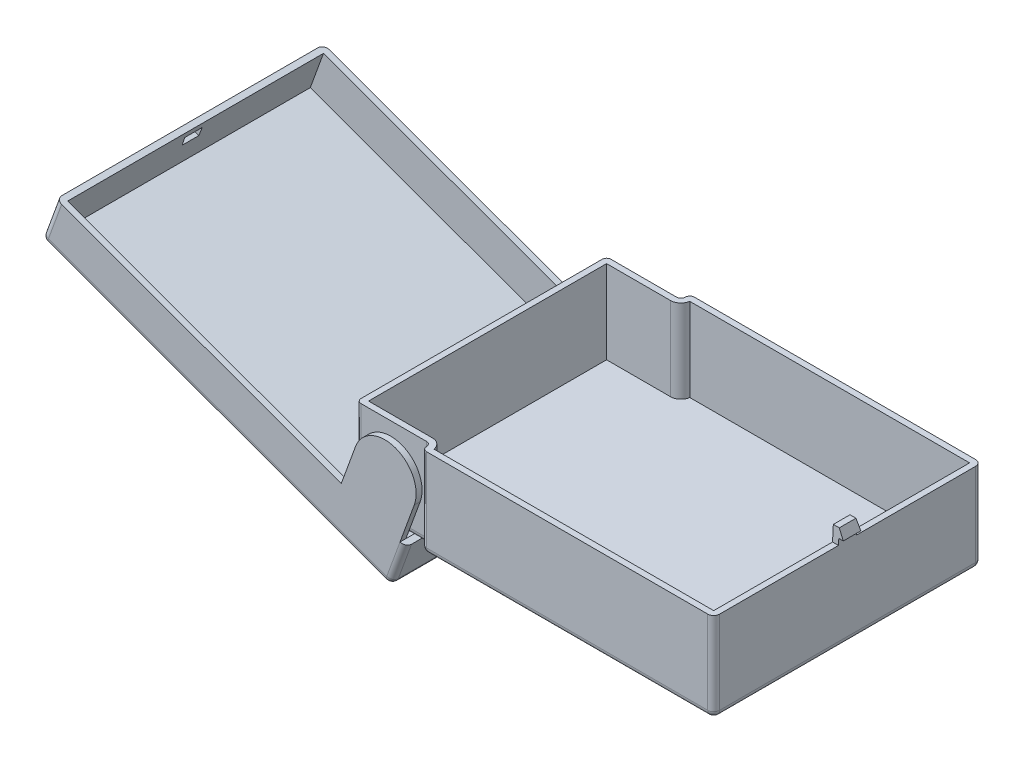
ISO-10303-21;
HEADER;
FILE_DESCRIPTION(('STEP AP214'),'2;1');
FILE_NAME('part.step','',(''),(''),'','','');
FILE_SCHEMA(('AUTOMOTIVE_DESIGN { 1 0 10303 214 1 1 1 1 }'));
ENDSEC;
DATA;
#1=APPLICATION_CONTEXT('core data for automotive mechanical design processes');
#2=APPLICATION_PROTOCOL_DEFINITION('international standard','automotive_design',2000,#1);
#3=PRODUCT_CONTEXT('',#1,'mechanical');
#4=PRODUCT('Part','Part','',(#3));
#5=PRODUCT_RELATED_PRODUCT_CATEGORY('part','',(#4));
#6=PRODUCT_DEFINITION_FORMATION('','',#4);
#7=PRODUCT_DEFINITION_CONTEXT('part definition',#1,'design');
#8=PRODUCT_DEFINITION('design','',#6,#7);
#9=PRODUCT_DEFINITION_SHAPE('','',#8);
#10=(LENGTH_UNIT() NAMED_UNIT(*) SI_UNIT(.MILLI.,.METRE.));
#11=(NAMED_UNIT(*) PLANE_ANGLE_UNIT() SI_UNIT($,.RADIAN.));
#12=(NAMED_UNIT(*) SI_UNIT($,.STERADIAN.) SOLID_ANGLE_UNIT());
#13=UNCERTAINTY_MEASURE_WITH_UNIT(LENGTH_MEASURE(1.E-05),#10,'distance_accuracy_value','');
#14=(GEOMETRIC_REPRESENTATION_CONTEXT(3) GLOBAL_UNCERTAINTY_ASSIGNED_CONTEXT((#13)) GLOBAL_UNIT_ASSIGNED_CONTEXT((#10,
#11,#12)) REPRESENTATION_CONTEXT('',''));
#15=CARTESIAN_POINT('',(0.,0.,0.));
#16=DIRECTION('',(0.,0.,1.));
#17=DIRECTION('',(1.,0.,0.));
#18=AXIS2_PLACEMENT_3D('',#15,#16,#17);
#19=CARTESIAN_POINT('',(-159.503701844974,41.3215694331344,-45.));
#20=DIRECTION('',(-0.342020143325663,-0.939692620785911,0.));
#21=DIRECTION('',(0.,0.,1.));
#22=AXIS2_PLACEMENT_3D('',#19,#20,#21);
#23=PLANE('',#22);
#24=DIRECTION('',(0.,0.,-1.));
#25=VECTOR('',#24,1.);
#26=CARTESIAN_POINT('',(-43.9215094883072,-0.746908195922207,-43.));
#27=LINE('',#26,#25);
#28=CARTESIAN_POINT('',(-43.9215094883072,-0.746908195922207,-43.));
#29=VERTEX_POINT('',#28);
#30=CARTESIAN_POINT('',(-43.9215094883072,-0.746908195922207,-45.));
#31=VERTEX_POINT('',#30);
#32=EDGE_CURVE('E259',#29,#31,#27,.T.);
#33=ORIENTED_EDGE('',*,*,#32,.F.);
#34=DIRECTION('',(0.,0.,1.));
#35=VECTOR('',#34,1.);
#36=CARTESIAN_POINT('',(-43.9215094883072,-0.746908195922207,45.));
#37=LINE('',#36,#35);
#38=CARTESIAN_POINT('',(-43.9215094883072,-0.746908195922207,43.));
#39=VERTEX_POINT('',#38);
#40=EDGE_CURVE('E430',#29,#39,#37,.T.);
#41=ORIENTED_EDGE('',*,*,#40,.T.);
#42=DIRECTION('',(0.,0.,1.));
#43=VECTOR('',#42,1.);
#44=CARTESIAN_POINT('',(-43.9215094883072,-0.746908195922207,43.));
#45=LINE('',#44,#43);
#46=CARTESIAN_POINT('',(-43.9215094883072,-0.746908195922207,45.));
#47=VERTEX_POINT('',#46);
#48=EDGE_CURVE('E302',#39,#47,#45,.T.);
#49=ORIENTED_EDGE('',*,*,#48,.T.);
#50=CARTESIAN_POINT('',(-43.9215094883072,-0.746908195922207,43.));
#51=DIRECTION('',(-0.342020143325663,-0.939692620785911,0.));
#52=DIRECTION('',(0.,0.,1.));
#53=AXIS2_PLACEMENT_3D('',#50,#51,#52);
#54=CIRCLE('',#53,2.);
#55=CARTESIAN_POINT('',(-42.0421242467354,-1.43094848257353,43.));
#56=VERTEX_POINT('',#55);
#57=EDGE_CURVE('E385',#47,#56,#54,.F.);
#58=ORIENTED_EDGE('',*,*,#57,.T.);
#59=DIRECTION('',(0.,0.,1.));
#60=VECTOR('',#59,1.);
#61=CARTESIAN_POINT('',(-42.0421242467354,-1.43094848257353,45.));
#62=LINE('',#61,#60);
#63=CARTESIAN_POINT('',(-42.0421242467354,-1.43094848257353,-43.));
#64=VERTEX_POINT('',#63);
#65=EDGE_CURVE('E369',#64,#56,#62,.T.);
#66=ORIENTED_EDGE('',*,*,#65,.F.);
#67=CARTESIAN_POINT('',(-43.9215094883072,-0.746908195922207,-43.));
#68=DIRECTION('',(-0.342020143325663,-0.939692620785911,0.));
#69=DIRECTION('',(0.,0.,1.));
#70=AXIS2_PLACEMENT_3D('',#67,#68,#69);
#71=CIRCLE('',#70,2.);
#72=EDGE_CURVE('E387',#64,#31,#71,.F.);
#73=ORIENTED_EDGE('',*,*,#72,.T.);
#74=EDGE_LOOP('',(#33,#41,#49,#58,#66,#73));
#75=FACE_BOUND('',#74,.T.);
#76=ADVANCED_FACE('F47',(#75),#23,.F.);
#77=DIRECTION('',(0.,0.,-1.));
#78=VECTOR('',#77,1.);
#79=CARTESIAN_POINT('',(-63.6550545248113,6.43551481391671,-43.));
#80=LINE('',#79,#78);
#81=CARTESIAN_POINT('',(-63.6550545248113,6.43551481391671,-43.));
#82=VERTEX_POINT('',#81);
#83=CARTESIAN_POINT('',(-63.6550545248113,6.43551481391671,-45.));
#84=VERTEX_POINT('',#83);
#85=EDGE_CURVE('E69',#82,#84,#80,.T.);
#86=ORIENTED_EDGE('',*,*,#85,.T.);
#87=DIRECTION('',(0.939692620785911,-0.342020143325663,0.));
#88=VECTOR('',#87,1.);
#89=CARTESIAN_POINT('',(-42.0421242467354,-1.43094848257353,-45.));
#90=LINE('',#89,#88);
#91=CARTESIAN_POINT('',(-157.624316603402,40.637529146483,-45.));
#92=VERTEX_POINT('',#91);
#93=EDGE_CURVE('E460',#92,#84,#90,.T.);
#94=ORIENTED_EDGE('',*,*,#93,.F.);
#95=CARTESIAN_POINT('',(-157.624316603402,40.637529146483,-43.));
#96=DIRECTION('',(-0.342020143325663,-0.939692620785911,0.));
#97=DIRECTION('',(0.,0.,1.));
#98=AXIS2_PLACEMENT_3D('',#95,#96,#97);
#99=CIRCLE('',#98,2.);
#100=CARTESIAN_POINT('',(-159.503701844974,41.3215694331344,-43.));
#101=VERTEX_POINT('',#100);
#102=EDGE_CURVE('E383',#92,#101,#99,.F.);
#103=ORIENTED_EDGE('',*,*,#102,.T.);
#104=DIRECTION('',(0.,0.,-1.));
#105=VECTOR('',#104,1.);
#106=CARTESIAN_POINT('',(-159.503701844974,41.3215694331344,45.));
#107=LINE('',#106,#105);
#108=CARTESIAN_POINT('',(-159.503701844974,41.3215694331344,43.));
#109=VERTEX_POINT('',#108);
#110=EDGE_CURVE('E374',#109,#101,#107,.T.);
#111=ORIENTED_EDGE('',*,*,#110,.F.);
#112=CARTESIAN_POINT('',(-157.624316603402,40.637529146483,43.));
#113=DIRECTION('',(-0.342020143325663,-0.939692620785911,0.));
#114=DIRECTION('',(0.,0.,1.));
#115=AXIS2_PLACEMENT_3D('',#112,#113,#114);
#116=CIRCLE('',#115,2.);
#117=CARTESIAN_POINT('',(-157.624316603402,40.637529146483,45.));
#118=VERTEX_POINT('',#117);
#119=EDGE_CURVE('E376',#109,#118,#116,.F.);
#120=ORIENTED_EDGE('',*,*,#119,.T.);
#121=DIRECTION('',(-0.939692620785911,0.342020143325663,0.));
#122=VECTOR('',#121,1.);
#123=CARTESIAN_POINT('',(-42.0421242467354,-1.43094848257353,45.));
#124=LINE('',#123,#122);
#125=CARTESIAN_POINT('',(-63.6550545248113,6.43551481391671,45.));
#126=VERTEX_POINT('',#125);
#127=EDGE_CURVE('E298',#126,#118,#124,.T.);
#128=ORIENTED_EDGE('',*,*,#127,.F.);
#129=DIRECTION('',(0.,0.,1.));
#130=VECTOR('',#129,1.);
#131=CARTESIAN_POINT('',(-63.6550545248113,6.43551481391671,43.));
#132=LINE('',#131,#130);
#133=CARTESIAN_POINT('',(-63.6550545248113,6.43551481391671,43.));
#134=VERTEX_POINT('',#133);
#135=EDGE_CURVE('E294',#134,#126,#132,.T.);
#136=ORIENTED_EDGE('',*,*,#135,.F.);
#137=DIRECTION('',(-0.939692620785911,0.342020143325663,0.));
#138=VECTOR('',#137,1.);
#139=CARTESIAN_POINT('',(-42.0421242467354,-1.43094848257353,43.));
#140=LINE('',#139,#138);
#141=CARTESIAN_POINT('',(-157.624316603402,40.637529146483,43.));
#142=VERTEX_POINT('',#141);
#143=EDGE_CURVE('E427',#134,#142,#140,.T.);
#144=ORIENTED_EDGE('',*,*,#143,.T.);
#145=DIRECTION('',(0.,0.,-1.));
#146=VECTOR('',#145,1.);
#147=CARTESIAN_POINT('',(-157.624316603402,40.637529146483,45.));
#148=LINE('',#147,#146);
#149=CARTESIAN_POINT('',(-157.624316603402,40.637529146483,-43.));
#150=VERTEX_POINT('',#149);
#151=EDGE_CURVE('E429',#142,#150,#148,.T.);
#152=ORIENTED_EDGE('',*,*,#151,.T.);
#153=DIRECTION('',(0.939692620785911,-0.342020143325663,0.));
#154=VECTOR('',#153,1.);
#155=CARTESIAN_POINT('',(-42.0421242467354,-1.43094848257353,-43.));
#156=LINE('',#155,#154);
#157=EDGE_CURVE('E297',#150,#82,#156,.T.);
#158=ORIENTED_EDGE('',*,*,#157,.T.);
#159=EDGE_LOOP('',(#86,#94,#103,#111,#120,#128,#136,#144,#152,#158));
#160=FACE_BOUND('',#159,.T.);
#161=ADVANCED_FACE('F332',(#160),#23,.F.);
#162=CARTESIAN_POINT('',(-47.1724263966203,-15.5263377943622,-45.));
#163=DIRECTION('',(0.,0.,1.));
#164=DIRECTION('',(-0.939692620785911,0.342020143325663,0.));
#165=AXIS2_PLACEMENT_3D('',#162,#163,#164);
#166=PLANE('',#165);
#167=DIRECTION('',(0.342020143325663,0.939692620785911,0.));
#168=VECTOR('',#167,1.);
#169=CARTESIAN_POINT('',(-49.0518116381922,-14.8422975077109,-45.));
#170=LINE('',#169,#168);
#171=CARTESIAN_POINT('',(-48.3677713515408,-12.962912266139,-45.));
#172=VERTEX_POINT('',#171);
#173=EDGE_CURVE('E391',#31,#172,#170,.F.);
#174=ORIENTED_EDGE('',*,*,#173,.T.);
#175=DIRECTION('',(0.939692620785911,-0.342020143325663,0.));
#176=VECTOR('',#175,1.);
#177=CARTESIAN_POINT('',(-162.070578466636,28.4215250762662,-45.));
#178=LINE('',#177,#176);
#179=CARTESIAN_POINT('',(-162.070578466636,28.4215250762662,-45.));
#180=VERTEX_POINT('',#179);
#181=EDGE_CURVE('E419',#172,#180,#178,.F.);
#182=ORIENTED_EDGE('',*,*,#181,.T.);
#183=DIRECTION('',(0.342020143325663,0.939692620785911,0.));
#184=VECTOR('',#183,1.);
#185=CARTESIAN_POINT('',(-162.754618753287,26.5421398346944,-45.));
#186=LINE('',#185,#184);
#187=EDGE_CURVE('E389',#180,#92,#186,.T.);
#188=ORIENTED_EDGE('',*,*,#187,.T.);
#189=ORIENTED_EDGE('',*,*,#93,.T.);
#190=DIRECTION('',(-0.342020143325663,-0.939692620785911,0.));
#191=VECTOR('',#190,1.);
#192=CARTESIAN_POINT('',(-58.866772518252,19.5912115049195,-45.));
#193=LINE('',#192,#191);
#194=CARTESIAN_POINT('',(-58.866772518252,19.5912115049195,-45.));
#195=VERTEX_POINT('',#194);
#196=EDGE_CURVE('E245',#195,#84,#193,.T.);
#197=ORIENTED_EDGE('',*,*,#196,.F.);
#198=CARTESIAN_POINT('',(-49.,16.,-45.));
#199=DIRECTION('',(0.,0.,1.));
#200=DIRECTION('',(-0.939692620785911,0.342020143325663,0.));
#201=AXIS2_PLACEMENT_3D('',#198,#199,#200);
#202=CIRCLE('',#201,10.5);
#203=CARTESIAN_POINT('',(-39.1332274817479,12.4087884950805,-45.));
#204=VERTEX_POINT('',#203);
#205=EDGE_CURVE('E248',#204,#195,#202,.T.);
#206=ORIENTED_EDGE('',*,*,#205,.F.);
#207=DIRECTION('',(0.342020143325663,0.939692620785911,0.));
#208=VECTOR('',#207,1.);
#209=CARTESIAN_POINT('',(-43.9215094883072,-0.746908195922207,-45.));
#210=LINE('',#209,#208);
#211=EDGE_CURVE('E250',#31,#204,#210,.T.);
#212=ORIENTED_EDGE('',*,*,#211,.F.);
#213=EDGE_LOOP('',(#174,#182,#188,#189,#197,#206,#212));
#214=FACE_BOUND('',#213,.T.);
#215=ADVANCED_FACE('F49',(#214),#166,.F.);
#216=CARTESIAN_POINT('',(-47.1724263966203,-15.5263377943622,45.));
#217=DIRECTION('',(-0.939692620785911,0.342020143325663,0.));
#218=DIRECTION('',(0.,0.,-1.));
#219=AXIS2_PLACEMENT_3D('',#216,#217,#218);
#220=PLANE('',#219);
#221=DIRECTION('',(0.342020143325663,0.939692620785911,0.));
#222=VECTOR('',#221,1.);
#223=CARTESIAN_POINT('',(-47.1724263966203,-15.5263377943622,43.));
#224=LINE('',#223,#222);
#225=CARTESIAN_POINT('',(-46.488386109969,-13.6469525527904,43.));
#226=VERTEX_POINT('',#225);
#227=EDGE_CURVE('E364',#56,#226,#224,.F.);
#228=ORIENTED_EDGE('',*,*,#227,.T.);
#229=DIRECTION('',(0.,0.,1.));
#230=VECTOR('',#229,1.);
#231=CARTESIAN_POINT('',(-46.488386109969,-13.6469525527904,-43.));
#232=LINE('',#231,#230);
#233=CARTESIAN_POINT('',(-46.488386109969,-13.6469525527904,-43.));
#234=VERTEX_POINT('',#233);
#235=EDGE_CURVE('E366',#226,#234,#232,.F.);
#236=ORIENTED_EDGE('',*,*,#235,.T.);
#237=DIRECTION('',(0.342020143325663,0.939692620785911,0.));
#238=VECTOR('',#237,1.);
#239=CARTESIAN_POINT('',(-47.1724263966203,-15.5263377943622,-43.));
#240=LINE('',#239,#238);
#241=EDGE_CURVE('E373',#234,#64,#240,.T.);
#242=ORIENTED_EDGE('',*,*,#241,.T.);
#243=ORIENTED_EDGE('',*,*,#65,.T.);
#244=EDGE_LOOP('',(#228,#236,#242,#243));
#245=FACE_BOUND('',#244,.T.);
#246=ADVANCED_FACE('F353',(#245),#220,.F.);
#247=CARTESIAN_POINT('',(-47.1724263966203,-15.5263377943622,45.));
#248=DIRECTION('',(0.,0.,-1.));
#249=DIRECTION('',(0.939692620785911,-0.342020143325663,0.));
#250=AXIS2_PLACEMENT_3D('',#247,#248,#249);
#251=PLANE('',#250);
#252=DIRECTION('',(0.342020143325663,0.939692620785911,0.));
#253=VECTOR('',#252,1.);
#254=CARTESIAN_POINT('',(-162.754618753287,26.5421398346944,45.));
#255=LINE('',#254,#253);
#256=CARTESIAN_POINT('',(-162.070578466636,28.4215250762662,45.));
#257=VERTEX_POINT('',#256);
#258=EDGE_CURVE('E394',#118,#257,#255,.F.);
#259=ORIENTED_EDGE('',*,*,#258,.T.);
#260=DIRECTION('',(-0.939692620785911,0.342020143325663,0.));
#261=VECTOR('',#260,1.);
#262=CARTESIAN_POINT('',(-48.3677713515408,-12.962912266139,45.));
#263=LINE('',#262,#261);
#264=CARTESIAN_POINT('',(-48.3677713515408,-12.962912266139,45.));
#265=VERTEX_POINT('',#264);
#266=EDGE_CURVE('E309',#257,#265,#263,.F.);
#267=ORIENTED_EDGE('',*,*,#266,.T.);
#268=DIRECTION('',(0.342020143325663,0.939692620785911,0.));
#269=VECTOR('',#268,1.);
#270=CARTESIAN_POINT('',(-49.0518116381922,-14.8422975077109,45.));
#271=LINE('',#270,#269);
#272=EDGE_CURVE('E397',#265,#47,#271,.T.);
#273=ORIENTED_EDGE('',*,*,#272,.T.);
#274=DIRECTION('',(0.342020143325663,0.939692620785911,0.));
#275=VECTOR('',#274,1.);
#276=CARTESIAN_POINT('',(-43.9215094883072,-0.746908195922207,45.));
#277=LINE('',#276,#275);
#278=CARTESIAN_POINT('',(-39.1332274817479,12.4087884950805,45.));
#279=VERTEX_POINT('',#278);
#280=EDGE_CURVE('E275',#47,#279,#277,.T.);
#281=ORIENTED_EDGE('',*,*,#280,.T.);
#282=CARTESIAN_POINT('',(-49.,16.,45.));
#283=DIRECTION('',(0.,0.,1.));
#284=DIRECTION('',(-0.939692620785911,0.342020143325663,0.));
#285=AXIS2_PLACEMENT_3D('',#282,#283,#284);
#286=CIRCLE('',#285,10.5);
#287=CARTESIAN_POINT('',(-58.866772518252,19.5912115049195,45.));
#288=VERTEX_POINT('',#287);
#289=EDGE_CURVE('E278',#279,#288,#286,.T.);
#290=ORIENTED_EDGE('',*,*,#289,.T.);
#291=DIRECTION('',(-0.342020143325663,-0.939692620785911,0.));
#292=VECTOR('',#291,1.);
#293=CARTESIAN_POINT('',(-58.866772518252,19.5912115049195,45.));
#294=LINE('',#293,#292);
#295=EDGE_CURVE('E281',#288,#126,#294,.T.);
#296=ORIENTED_EDGE('',*,*,#295,.T.);
#297=ORIENTED_EDGE('',*,*,#127,.T.);
#298=EDGE_LOOP('',(#259,#267,#273,#281,#290,#296,#297));
#299=FACE_BOUND('',#298,.T.);
#300=ADVANCED_FACE('F350',(#299),#251,.F.);
#301=CARTESIAN_POINT('',(-164.634003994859,27.2261801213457,45.));
#302=DIRECTION('',(0.939692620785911,-0.342020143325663,0.));
#303=DIRECTION('',(0.,0.,1.));
#304=AXIS2_PLACEMENT_3D('',#301,#302,#303);
#305=PLANE('',#304);
#306=DIRECTION('',(0.342020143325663,0.939692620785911,0.));
#307=VECTOR('',#306,1.);
#308=CARTESIAN_POINT('',(-164.634003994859,27.2261801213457,-43.));
#309=LINE('',#308,#307);
#310=CARTESIAN_POINT('',(-163.949963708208,29.1055653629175,-43.));
#311=VERTEX_POINT('',#310);
#312=EDGE_CURVE('E402',#101,#311,#309,.F.);
#313=ORIENTED_EDGE('',*,*,#312,.T.);
#314=DIRECTION('',(0.,0.,-1.));
#315=VECTOR('',#314,1.);
#316=CARTESIAN_POINT('',(-163.949963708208,29.1055653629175,43.));
#317=LINE('',#316,#315);
#318=CARTESIAN_POINT('',(-163.949963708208,29.1055653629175,43.));
#319=VERTEX_POINT('',#318);
#320=EDGE_CURVE('E423',#311,#319,#317,.F.);
#321=ORIENTED_EDGE('',*,*,#320,.T.);
#322=DIRECTION('',(0.342020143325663,0.939692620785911,0.));
#323=VECTOR('',#322,1.);
#324=CARTESIAN_POINT('',(-164.634003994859,27.2261801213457,43.));
#325=LINE('',#324,#323);
#326=EDGE_CURVE('E400',#319,#109,#325,.T.);
#327=ORIENTED_EDGE('',*,*,#326,.T.);
#328=ORIENTED_EDGE('',*,*,#110,.T.);
#329=EDGE_LOOP('',(#313,#321,#327,#328));
#330=FACE_BOUND('',#329,.T.);
#331=ADVANCED_FACE('F346',(#330),#305,.F.);
#332=CARTESIAN_POINT('',(-164.634003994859,27.2261801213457,-45.));
#333=DIRECTION('',(-0.342020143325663,-0.939692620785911,0.));
#334=DIRECTION('',(0.,0.,1.));
#335=AXIS2_PLACEMENT_3D('',#332,#333,#334);
#336=PLANE('',#335);
#337=DIRECTION('',(0.939692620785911,-0.342020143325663,0.));
#338=VECTOR('',#337,1.);
#339=CARTESIAN_POINT('',(-49.0518116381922,-14.8422975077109,-43.));
#340=LINE('',#339,#338);
#341=CARTESIAN_POINT('',(-162.754618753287,26.5421398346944,-43.));
#342=VERTEX_POINT('',#341);
#343=CARTESIAN_POINT('',(-49.0518116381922,-14.8422975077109,-43.));
#344=VERTEX_POINT('',#343);
#345=EDGE_CURVE('E411',#342,#344,#340,.T.);
#346=ORIENTED_EDGE('',*,*,#345,.T.);
#347=DIRECTION('',(0.,0.,1.));
#348=VECTOR('',#347,1.);
#349=CARTESIAN_POINT('',(-49.0518116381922,-14.8422975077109,43.));
#350=LINE('',#349,#348);
#351=CARTESIAN_POINT('',(-49.0518116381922,-14.8422975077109,43.));
#352=VERTEX_POINT('',#351);
#353=EDGE_CURVE('E413',#344,#352,#350,.T.);
#354=ORIENTED_EDGE('',*,*,#353,.T.);
#355=DIRECTION('',(-0.939692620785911,0.342020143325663,0.));
#356=VECTOR('',#355,1.);
#357=CARTESIAN_POINT('',(-162.754618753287,26.5421398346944,43.));
#358=LINE('',#357,#356);
#359=CARTESIAN_POINT('',(-162.754618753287,26.5421398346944,43.));
#360=VERTEX_POINT('',#359);
#361=EDGE_CURVE('E407',#352,#360,#358,.T.);
#362=ORIENTED_EDGE('',*,*,#361,.T.);
#363=DIRECTION('',(0.,0.,-1.));
#364=VECTOR('',#363,1.);
#365=CARTESIAN_POINT('',(-162.754618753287,26.5421398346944,-43.));
#366=LINE('',#365,#364);
#367=EDGE_CURVE('E409',#360,#342,#366,.T.);
#368=ORIENTED_EDGE('',*,*,#367,.T.);
#369=EDGE_LOOP('',(#346,#354,#362,#368));
#370=FACE_BOUND('',#369,.T.);
#371=ADVANCED_FACE('F343',(#370),#336,.T.);
#372=CARTESIAN_POINT('',(-49.0518116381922,-14.8422975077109,-43.));
#373=DIRECTION('',(0.342020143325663,0.939692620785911,0.));
#374=DIRECTION('',(0.,0.,-1.));
#375=AXIS2_PLACEMENT_3D('',#372,#373,#374);
#376=CYLINDRICAL_SURFACE('',#375,2.);
#377=ORIENTED_EDGE('',*,*,#241,.F.);
#378=CARTESIAN_POINT('',(-48.3677713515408,-12.962912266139,-43.));
#379=DIRECTION('',(0.342020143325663,0.939692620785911,0.));
#380=DIRECTION('',(0.,0.,-1.));
#381=AXIS2_PLACEMENT_3D('',#378,#379,#380);
#382=CIRCLE('',#381,2.);
#383=EDGE_CURVE('E417',#234,#172,#382,.T.);
#384=ORIENTED_EDGE('',*,*,#383,.T.);
#385=ORIENTED_EDGE('',*,*,#173,.F.);
#386=ORIENTED_EDGE('',*,*,#72,.F.);
#387=EDGE_LOOP('',(#377,#384,#385,#386));
#388=FACE_BOUND('',#387,.T.);
#389=ADVANCED_FACE('F341',(#388),#376,.T.);
#390=CARTESIAN_POINT('',(-49.0518116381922,-14.8422975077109,43.));
#391=DIRECTION('',(0.342020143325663,0.939692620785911,0.));
#392=DIRECTION('',(0.,0.,-1.));
#393=AXIS2_PLACEMENT_3D('',#390,#391,#392);
#394=CYLINDRICAL_SURFACE('',#393,2.);
#395=ORIENTED_EDGE('',*,*,#272,.F.);
#396=CARTESIAN_POINT('',(-48.3677713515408,-12.962912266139,43.));
#397=DIRECTION('',(0.342020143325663,0.939692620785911,0.));
#398=DIRECTION('',(0.,0.,-1.));
#399=AXIS2_PLACEMENT_3D('',#396,#397,#398);
#400=CIRCLE('',#399,2.);
#401=EDGE_CURVE('E405',#265,#226,#400,.T.);
#402=ORIENTED_EDGE('',*,*,#401,.T.);
#403=ORIENTED_EDGE('',*,*,#227,.F.);
#404=ORIENTED_EDGE('',*,*,#57,.F.);
#405=EDGE_LOOP('',(#395,#402,#403,#404));
#406=FACE_BOUND('',#405,.T.);
#407=ADVANCED_FACE('F484',(#406),#394,.T.);
#408=CARTESIAN_POINT('',(-162.754618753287,26.5421398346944,-43.));
#409=DIRECTION('',(0.342020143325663,0.939692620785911,0.));
#410=DIRECTION('',(0.,0.,-1.));
#411=AXIS2_PLACEMENT_3D('',#408,#409,#410);
#412=CYLINDRICAL_SURFACE('',#411,2.);
#413=ORIENTED_EDGE('',*,*,#187,.F.);
#414=CARTESIAN_POINT('',(-162.070578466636,28.4215250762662,-43.));
#415=DIRECTION('',(0.342020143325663,0.939692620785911,0.));
#416=DIRECTION('',(0.,0.,-1.));
#417=AXIS2_PLACEMENT_3D('',#414,#415,#416);
#418=CIRCLE('',#417,2.);
#419=EDGE_CURVE('E421',#180,#311,#418,.T.);
#420=ORIENTED_EDGE('',*,*,#419,.T.);
#421=ORIENTED_EDGE('',*,*,#312,.F.);
#422=ORIENTED_EDGE('',*,*,#102,.F.);
#423=EDGE_LOOP('',(#413,#420,#421,#422));
#424=FACE_BOUND('',#423,.T.);
#425=ADVANCED_FACE('F514',(#424),#412,.T.);
#426=CARTESIAN_POINT('',(-162.754618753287,26.5421398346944,43.));
#427=DIRECTION('',(0.342020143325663,0.939692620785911,0.));
#428=DIRECTION('',(0.,0.,-1.));
#429=AXIS2_PLACEMENT_3D('',#426,#427,#428);
#430=CYLINDRICAL_SURFACE('',#429,2.);
#431=ORIENTED_EDGE('',*,*,#326,.F.);
#432=CARTESIAN_POINT('',(-162.070578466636,28.4215250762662,43.));
#433=DIRECTION('',(0.342020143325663,0.939692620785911,0.));
#434=DIRECTION('',(0.,0.,-1.));
#435=AXIS2_PLACEMENT_3D('',#432,#433,#434);
#436=CIRCLE('',#435,2.);
#437=EDGE_CURVE('E425',#319,#257,#436,.T.);
#438=ORIENTED_EDGE('',*,*,#437,.T.);
#439=ORIENTED_EDGE('',*,*,#258,.F.);
#440=ORIENTED_EDGE('',*,*,#119,.F.);
#441=EDGE_LOOP('',(#431,#438,#439,#440));
#442=FACE_BOUND('',#441,.T.);
#443=ADVANCED_FACE('F472',(#442),#430,.T.);
#444=CARTESIAN_POINT('',(-162.070578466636,28.4215250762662,-43.));
#445=DIRECTION('',(0.,0.,1.));
#446=DIRECTION('',(-0.939692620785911,0.342020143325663,0.));
#447=AXIS2_PLACEMENT_3D('',#444,#445,#446);
#448=SPHERICAL_SURFACE('',#447,2.);
#449=CARTESIAN_POINT('',(-162.070578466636,28.4215250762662,-43.));
#450=DIRECTION('',(0.,0.,1.));
#451=DIRECTION('',(-0.939692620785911,0.342020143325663,0.));
#452=AXIS2_PLACEMENT_3D('',#449,#450,#451);
#453=CIRCLE('',#452,2.);
#454=EDGE_CURVE('E454',#311,#342,#453,.T.);
#455=ORIENTED_EDGE('',*,*,#454,.F.);
#456=ORIENTED_EDGE('',*,*,#419,.F.);
#457=CARTESIAN_POINT('',(-162.070578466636,28.4215250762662,-43.));
#458=DIRECTION('',(0.939692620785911,-0.342020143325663,0.));
#459=DIRECTION('',(0.,0.,1.));
#460=AXIS2_PLACEMENT_3D('',#457,#458,#459);
#461=CIRCLE('',#460,2.);
#462=EDGE_CURVE('E457',#342,#180,#461,.T.);
#463=ORIENTED_EDGE('',*,*,#462,.F.);
#464=EDGE_LOOP('',(#455,#456,#463));
#465=FACE_BOUND('',#464,.T.);
#466=ADVANCED_FACE('F510',(#465),#448,.T.);
#467=CARTESIAN_POINT('',(-163.949963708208,29.1055653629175,-43.));
#468=DIRECTION('',(-0.939692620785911,0.342020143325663,0.));
#469=DIRECTION('',(0.,0.,-1.));
#470=AXIS2_PLACEMENT_3D('',#467,#468,#469);
#471=CYLINDRICAL_SURFACE('',#470,2.);
#472=ORIENTED_EDGE('',*,*,#462,.T.);
#473=ORIENTED_EDGE('',*,*,#181,.F.);
#474=CARTESIAN_POINT('',(-48.3677713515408,-12.962912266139,-43.));
#475=DIRECTION('',(0.939692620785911,-0.342020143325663,0.));
#476=DIRECTION('',(0.,0.,1.));
#477=AXIS2_PLACEMENT_3D('',#474,#475,#476);
#478=CIRCLE('',#477,2.);
#479=EDGE_CURVE('E451',#344,#172,#478,.T.);
#480=ORIENTED_EDGE('',*,*,#479,.F.);
#481=ORIENTED_EDGE('',*,*,#345,.F.);
#482=EDGE_LOOP('',(#472,#473,#480,#481));
#483=FACE_BOUND('',#482,.T.);
#484=ADVANCED_FACE('F504',(#483),#471,.T.);
#485=CARTESIAN_POINT('',(-162.070578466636,28.4215250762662,-45.));
#486=DIRECTION('',(0.,0.,1.));
#487=DIRECTION('',(-0.939692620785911,0.342020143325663,0.));
#488=AXIS2_PLACEMENT_3D('',#485,#486,#487);
#489=CYLINDRICAL_SURFACE('',#488,2.);
#490=ORIENTED_EDGE('',*,*,#454,.T.);
#491=ORIENTED_EDGE('',*,*,#367,.F.);
#492=CARTESIAN_POINT('',(-162.070578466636,28.4215250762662,43.));
#493=DIRECTION('',(0.,0.,1.));
#494=DIRECTION('',(-0.939692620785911,0.342020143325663,0.));
#495=AXIS2_PLACEMENT_3D('',#492,#493,#494);
#496=CIRCLE('',#495,2.);
#497=EDGE_CURVE('E448',#319,#360,#496,.T.);
#498=ORIENTED_EDGE('',*,*,#497,.F.);
#499=ORIENTED_EDGE('',*,*,#320,.F.);
#500=EDGE_LOOP('',(#490,#491,#498,#499));
#501=FACE_BOUND('',#500,.T.);
#502=ADVANCED_FACE('F517',(#501),#489,.T.);
#503=CARTESIAN_POINT('',(-48.3677713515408,-12.962912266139,-43.));
#504=DIRECTION('',(0.,0.,1.));
#505=DIRECTION('',(-0.939692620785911,0.342020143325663,0.));
#506=AXIS2_PLACEMENT_3D('',#503,#504,#505);
#507=SPHERICAL_SURFACE('',#506,2.);
#508=ORIENTED_EDGE('',*,*,#479,.T.);
#509=ORIENTED_EDGE('',*,*,#383,.F.);
#510=CARTESIAN_POINT('',(-48.3677713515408,-12.962912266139,-43.));
#511=DIRECTION('',(0.,0.,1.));
#512=DIRECTION('',(-0.939692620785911,0.342020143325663,0.));
#513=AXIS2_PLACEMENT_3D('',#510,#511,#512);
#514=CIRCLE('',#513,2.);
#515=EDGE_CURVE('E445',#344,#234,#514,.T.);
#516=ORIENTED_EDGE('',*,*,#515,.F.);
#517=EDGE_LOOP('',(#508,#509,#516));
#518=FACE_BOUND('',#517,.T.);
#519=ADVANCED_FACE('F494',(#518),#507,.T.);
#520=CARTESIAN_POINT('',(-162.070578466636,28.4215250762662,43.));
#521=DIRECTION('',(0.,0.,1.));
#522=DIRECTION('',(-0.939692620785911,0.342020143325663,0.));
#523=AXIS2_PLACEMENT_3D('',#520,#521,#522);
#524=SPHERICAL_SURFACE('',#523,2.);
#525=ORIENTED_EDGE('',*,*,#437,.F.);
#526=ORIENTED_EDGE('',*,*,#497,.T.);
#527=CARTESIAN_POINT('',(-162.070578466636,28.4215250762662,43.));
#528=DIRECTION('',(0.939692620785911,-0.342020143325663,0.));
#529=DIRECTION('',(0.,0.,1.));
#530=AXIS2_PLACEMENT_3D('',#527,#528,#529);
#531=CIRCLE('',#530,2.);
#532=EDGE_CURVE('E442',#257,#360,#531,.T.);
#533=ORIENTED_EDGE('',*,*,#532,.F.);
#534=EDGE_LOOP('',(#525,#526,#533));
#535=FACE_BOUND('',#534,.T.);
#536=ADVANCED_FACE('F476',(#535),#524,.T.);
#537=CARTESIAN_POINT('',(-48.3677713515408,-12.962912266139,-45.));
#538=DIRECTION('',(0.,0.,-1.));
#539=DIRECTION('',(0.939692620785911,-0.342020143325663,0.));
#540=AXIS2_PLACEMENT_3D('',#537,#538,#539);
#541=CYLINDRICAL_SURFACE('',#540,2.);
#542=ORIENTED_EDGE('',*,*,#515,.T.);
#543=ORIENTED_EDGE('',*,*,#235,.F.);
#544=CARTESIAN_POINT('',(-48.3677713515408,-12.962912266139,43.));
#545=DIRECTION('',(0.,0.,1.));
#546=DIRECTION('',(-0.939692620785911,0.342020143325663,0.));
#547=AXIS2_PLACEMENT_3D('',#544,#545,#546);
#548=CIRCLE('',#547,2.);
#549=EDGE_CURVE('E439',#352,#226,#548,.T.);
#550=ORIENTED_EDGE('',*,*,#549,.F.);
#551=ORIENTED_EDGE('',*,*,#353,.F.);
#552=EDGE_LOOP('',(#542,#543,#550,#551));
#553=FACE_BOUND('',#552,.T.);
#554=ADVANCED_FACE('F490',(#553),#541,.T.);
#555=CARTESIAN_POINT('',(-163.949963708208,29.1055653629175,43.));
#556=DIRECTION('',(0.939692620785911,-0.342020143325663,0.));
#557=DIRECTION('',(0.,0.,1.));
#558=AXIS2_PLACEMENT_3D('',#555,#556,#557);
#559=CYLINDRICAL_SURFACE('',#558,2.);
#560=ORIENTED_EDGE('',*,*,#532,.T.);
#561=ORIENTED_EDGE('',*,*,#361,.F.);
#562=CARTESIAN_POINT('',(-48.3677713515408,-12.962912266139,43.));
#563=DIRECTION('',(0.939692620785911,-0.342020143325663,0.));
#564=DIRECTION('',(0.,0.,1.));
#565=AXIS2_PLACEMENT_3D('',#562,#563,#564);
#566=CIRCLE('',#565,2.);
#567=EDGE_CURVE('E437',#265,#352,#566,.T.);
#568=ORIENTED_EDGE('',*,*,#567,.F.);
#569=ORIENTED_EDGE('',*,*,#266,.F.);
#570=EDGE_LOOP('',(#560,#561,#568,#569));
#571=FACE_BOUND('',#570,.T.);
#572=ADVANCED_FACE('F481',(#571),#559,.T.);
#573=CARTESIAN_POINT('',(-48.3677713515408,-12.962912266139,43.));
#574=DIRECTION('',(0.,0.,1.));
#575=DIRECTION('',(-0.939692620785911,0.342020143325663,0.));
#576=AXIS2_PLACEMENT_3D('',#573,#574,#575);
#577=SPHERICAL_SURFACE('',#576,2.);
#578=ORIENTED_EDGE('',*,*,#549,.T.);
#579=ORIENTED_EDGE('',*,*,#401,.F.);
#580=ORIENTED_EDGE('',*,*,#567,.T.);
#581=EDGE_LOOP('',(#578,#579,#580));
#582=FACE_BOUND('',#581,.T.);
#583=ADVANCED_FACE('F486',(#582),#577,.T.);
#584=CARTESIAN_POINT('',(-47.1724263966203,-15.5263377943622,-43.));
#585=DIRECTION('',(0.,0.,1.));
#586=DIRECTION('',(-0.939692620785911,0.342020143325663,0.));
#587=AXIS2_PLACEMENT_3D('',#584,#585,#586);
#588=PLANE('',#587);
#589=CARTESIAN_POINT('',(-49.,16.,-43.));
#590=DIRECTION('',(0.,0.,1.));
#591=DIRECTION('',(-0.939692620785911,0.342020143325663,0.));
#592=AXIS2_PLACEMENT_3D('',#589,#590,#591);
#593=CIRCLE('',#592,1.25000000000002);
#594=CARTESIAN_POINT('',(-50.1746157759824,16.4275251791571,-43.));
#595=VERTEX_POINT('',#594);
#596=EDGE_CURVE('E236',#595,#595,#593,.T.);
#597=ORIENTED_EDGE('',*,*,#596,.F.);
#598=EDGE_LOOP('',(#597));
#599=FACE_BOUND('',#598,.T.);
#600=DIRECTION('',(-0.342020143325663,-0.939692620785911,0.));
#601=VECTOR('',#600,1.);
#602=CARTESIAN_POINT('',(-49.0518116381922,-14.8422975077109,-43.));
#603=LINE('',#602,#601);
#604=CARTESIAN_POINT('',(-48.3677713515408,-12.962912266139,-43.));
#605=VERTEX_POINT('',#604);
#606=EDGE_CURVE('E824',#29,#605,#603,.T.);
#607=ORIENTED_EDGE('',*,*,#606,.F.);
#608=DIRECTION('',(0.342020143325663,0.939692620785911,0.));
#609=VECTOR('',#608,1.);
#610=CARTESIAN_POINT('',(-43.9215094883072,-0.746908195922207,-43.));
#611=LINE('',#610,#609);
#612=CARTESIAN_POINT('',(-39.1332274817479,12.4087884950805,-43.));
#613=VERTEX_POINT('',#612);
#614=EDGE_CURVE('E257',#29,#613,#611,.T.);
#615=ORIENTED_EDGE('',*,*,#614,.T.);
#616=CARTESIAN_POINT('',(-49.,16.,-43.));
#617=DIRECTION('',(0.,0.,1.));
#618=DIRECTION('',(-0.939692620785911,0.342020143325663,0.));
#619=AXIS2_PLACEMENT_3D('',#616,#617,#618);
#620=CIRCLE('',#619,10.5);
#621=CARTESIAN_POINT('',(-58.866772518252,19.5912115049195,-43.));
#622=VERTEX_POINT('',#621);
#623=EDGE_CURVE('E255',#613,#622,#620,.T.);
#624=ORIENTED_EDGE('',*,*,#623,.T.);
#625=DIRECTION('',(-0.342020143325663,-0.939692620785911,0.));
#626=VECTOR('',#625,1.);
#627=CARTESIAN_POINT('',(-58.866772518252,19.5912115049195,-43.));
#628=LINE('',#627,#626);
#629=EDGE_CURVE('E252',#622,#82,#628,.T.);
#630=ORIENTED_EDGE('',*,*,#629,.T.);
#631=ORIENTED_EDGE('',*,*,#157,.F.);
#632=DIRECTION('',(-0.342020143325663,-0.939692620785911,0.));
#633=VECTOR('',#632,1.);
#634=CARTESIAN_POINT('',(-162.754618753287,26.5421398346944,-43.));
#635=LINE('',#634,#633);
#636=CARTESIAN_POINT('',(-162.070578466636,28.4215250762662,-43.));
#637=VERTEX_POINT('',#636);
#638=EDGE_CURVE('E840',#150,#637,#635,.T.);
#639=ORIENTED_EDGE('',*,*,#638,.T.);
#640=DIRECTION('',(-0.939692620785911,0.342020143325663,0.));
#641=VECTOR('',#640,1.);
#642=CARTESIAN_POINT('',(-163.949963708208,29.1055653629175,-43.));
#643=LINE('',#642,#641);
#644=EDGE_CURVE('E440',#605,#637,#643,.T.);
#645=ORIENTED_EDGE('',*,*,#644,.F.);
#646=EDGE_LOOP('',(#607,#615,#624,#630,#631,#639,#645));
#647=FACE_BOUND('',#646,.T.);
#648=ADVANCED_FACE('F733',(#599,#647),#588,.T.);
#649=CARTESIAN_POINT('',(-49.0518116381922,-14.8422975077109,45.));
#650=DIRECTION('',(-0.939692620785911,0.342020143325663,0.));
#651=DIRECTION('',(0.,0.,-1.));
#652=AXIS2_PLACEMENT_3D('',#649,#650,#651);
#653=PLANE('',#652);
#654=DIRECTION('',(-0.342020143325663,-0.939692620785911,0.));
#655=VECTOR('',#654,1.);
#656=CARTESIAN_POINT('',(-49.0518116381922,-14.8422975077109,43.));
#657=LINE('',#656,#655);
#658=CARTESIAN_POINT('',(-48.3677713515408,-12.962912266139,43.));
#659=VERTEX_POINT('',#658);
#660=EDGE_CURVE('E831',#39,#659,#657,.T.);
#661=ORIENTED_EDGE('',*,*,#660,.F.);
#662=ORIENTED_EDGE('',*,*,#40,.F.);
#663=ORIENTED_EDGE('',*,*,#606,.T.);
#664=DIRECTION('',(0.,0.,-1.));
#665=VECTOR('',#664,1.);
#666=CARTESIAN_POINT('',(-48.3677713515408,-12.962912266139,-45.));
#667=LINE('',#666,#665);
#668=EDGE_CURVE('E844',#659,#605,#667,.T.);
#669=ORIENTED_EDGE('',*,*,#668,.F.);
#670=EDGE_LOOP('',(#661,#662,#663,#669));
#671=FACE_BOUND('',#670,.T.);
#672=ADVANCED_FACE('F721',(#671),#653,.T.);
#673=CARTESIAN_POINT('',(-47.1724263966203,-15.5263377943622,43.));
#674=DIRECTION('',(0.,0.,-1.));
#675=DIRECTION('',(0.939692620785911,-0.342020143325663,0.));
#676=AXIS2_PLACEMENT_3D('',#673,#674,#675);
#677=PLANE('',#676);
#678=CARTESIAN_POINT('',(-49.,16.,43.));
#679=DIRECTION('',(0.,0.,-1.));
#680=DIRECTION('',(0.939692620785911,-0.342020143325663,0.));
#681=AXIS2_PLACEMENT_3D('',#678,#679,#680);
#682=CIRCLE('',#681,1.25000000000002);
#683=CARTESIAN_POINT('',(-47.8253842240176,15.5724748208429,43.));
#684=VERTEX_POINT('',#683);
#685=EDGE_CURVE('E262',#684,#684,#682,.T.);
#686=ORIENTED_EDGE('',*,*,#685,.F.);
#687=EDGE_LOOP('',(#686));
#688=FACE_BOUND('',#687,.T.);
#689=DIRECTION('',(-0.342020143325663,-0.939692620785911,0.));
#690=VECTOR('',#689,1.);
#691=CARTESIAN_POINT('',(-162.754618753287,26.5421398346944,43.));
#692=LINE('',#691,#690);
#693=CARTESIAN_POINT('',(-162.070578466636,28.4215250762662,43.));
#694=VERTEX_POINT('',#693);
#695=EDGE_CURVE('E830',#142,#694,#692,.T.);
#696=ORIENTED_EDGE('',*,*,#695,.F.);
#697=ORIENTED_EDGE('',*,*,#143,.F.);
#698=DIRECTION('',(-0.342020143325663,-0.939692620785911,0.));
#699=VECTOR('',#698,1.);
#700=CARTESIAN_POINT('',(-58.866772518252,19.5912115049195,43.));
#701=LINE('',#700,#699);
#702=CARTESIAN_POINT('',(-58.866772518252,19.5912115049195,43.));
#703=VERTEX_POINT('',#702);
#704=EDGE_CURVE('E288',#703,#134,#701,.T.);
#705=ORIENTED_EDGE('',*,*,#704,.F.);
#706=CARTESIAN_POINT('',(-49.,16.,43.));
#707=DIRECTION('',(0.,0.,1.));
#708=DIRECTION('',(-0.939692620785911,0.342020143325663,0.));
#709=AXIS2_PLACEMENT_3D('',#706,#707,#708);
#710=CIRCLE('',#709,10.5);
#711=CARTESIAN_POINT('',(-39.1332274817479,12.4087884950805,43.));
#712=VERTEX_POINT('',#711);
#713=EDGE_CURVE('E285',#712,#703,#710,.T.);
#714=ORIENTED_EDGE('',*,*,#713,.F.);
#715=DIRECTION('',(0.342020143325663,0.939692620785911,0.));
#716=VECTOR('',#715,1.);
#717=CARTESIAN_POINT('',(-43.9215094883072,-0.746908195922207,43.));
#718=LINE('',#717,#716);
#719=EDGE_CURVE('E282',#39,#712,#718,.T.);
#720=ORIENTED_EDGE('',*,*,#719,.F.);
#721=ORIENTED_EDGE('',*,*,#660,.T.);
#722=DIRECTION('',(-0.939692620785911,0.342020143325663,0.));
#723=VECTOR('',#722,1.);
#724=CARTESIAN_POINT('',(-46.488386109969,-13.6469525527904,43.));
#725=LINE('',#724,#723);
#726=EDGE_CURVE('E845',#659,#694,#725,.T.);
#727=ORIENTED_EDGE('',*,*,#726,.T.);
#728=EDGE_LOOP('',(#696,#697,#705,#714,#720,#721,#727));
#729=FACE_BOUND('',#728,.T.);
#730=ADVANCED_FACE('F713',(#688,#729),#677,.T.);
#731=CARTESIAN_POINT('',(-162.754618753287,26.5421398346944,45.));
#732=DIRECTION('',(0.939692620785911,-0.342020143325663,0.));
#733=DIRECTION('',(0.,0.,1.));
#734=AXIS2_PLACEMENT_3D('',#731,#732,#733);
#735=PLANE('',#734);
#736=DIRECTION('',(-0.341551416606,-0.93840480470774,-0.0523359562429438));
#737=VECTOR('',#736,1.);
#738=CARTESIAN_POINT('',(-161.990907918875,28.6404181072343,2.39294569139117));
#739=LINE('',#738,#737);
#740=CARTESIAN_POINT('',(-158.308356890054,38.7581439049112,2.95722333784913));
#741=VERTEX_POINT('',#740);
#742=CARTESIAN_POINT('',(-159.334417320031,35.9390660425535,2.8));
#743=VERTEX_POINT('',#742);
#744=EDGE_CURVE('E13',#741,#743,#739,.T.);
#745=ORIENTED_EDGE('',*,*,#744,.F.);
#746=DIRECTION('',(0.,0.,1.));
#747=VECTOR('',#746,1.);
#748=CARTESIAN_POINT('',(-158.308356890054,38.7581439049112,0.));
#749=LINE('',#748,#747);
#750=CARTESIAN_POINT('',(-158.308356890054,38.7581439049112,-2.95722333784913));
#751=VERTEX_POINT('',#750);
#752=EDGE_CURVE('E230',#751,#741,#749,.T.);
#753=ORIENTED_EDGE('',*,*,#752,.F.);
#754=DIRECTION('',(0.341551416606,0.93840480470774,-0.0523359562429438));
#755=VECTOR('',#754,1.);
#756=CARTESIAN_POINT('',(-163.599695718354,24.2203099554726,-2.14643098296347));
#757=LINE('',#756,#755);
#758=CARTESIAN_POINT('',(-159.334417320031,35.9390660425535,-2.8));
#759=VERTEX_POINT('',#758);
#760=EDGE_CURVE('E55',#759,#751,#757,.T.);
#761=ORIENTED_EDGE('',*,*,#760,.F.);
#762=DIRECTION('',(0.,0.,-1.));
#763=VECTOR('',#762,1.);
#764=CARTESIAN_POINT('',(-159.334417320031,35.9390660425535,45.));
#765=LINE('',#764,#763);
#766=EDGE_CURVE('E213',#743,#759,#765,.T.);
#767=ORIENTED_EDGE('',*,*,#766,.F.);
#768=EDGE_LOOP('',(#745,#753,#761,#767));
#769=FACE_BOUND('',#768,.T.);
#770=ORIENTED_EDGE('',*,*,#638,.F.);
#771=ORIENTED_EDGE('',*,*,#151,.F.);
#772=ORIENTED_EDGE('',*,*,#695,.T.);
#773=DIRECTION('',(0.,0.,-1.));
#774=VECTOR('',#773,1.);
#775=CARTESIAN_POINT('',(-162.070578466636,28.4215250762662,45.));
#776=LINE('',#775,#774);
#777=EDGE_CURVE('E842',#694,#637,#776,.T.);
#778=ORIENTED_EDGE('',*,*,#777,.T.);
#779=EDGE_LOOP('',(#770,#771,#772,#778));
#780=FACE_BOUND('',#779,.T.);
#781=ADVANCED_FACE('F316',(#769,#780),#735,.T.);
#782=CARTESIAN_POINT('',(-163.949963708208,29.1055653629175,-45.));
#783=DIRECTION('',(-0.342020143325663,-0.939692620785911,0.));
#784=DIRECTION('',(0.,0.,1.));
#785=AXIS2_PLACEMENT_3D('',#782,#783,#784);
#786=PLANE('',#785);
#787=ORIENTED_EDGE('',*,*,#644,.T.);
#788=ORIENTED_EDGE('',*,*,#777,.F.);
#789=ORIENTED_EDGE('',*,*,#726,.F.);
#790=ORIENTED_EDGE('',*,*,#668,.T.);
#791=EDGE_LOOP('',(#787,#788,#789,#790));
#792=FACE_BOUND('',#791,.T.);
#793=ADVANCED_FACE('F696',(#792),#786,.F.);
#794=CARTESIAN_POINT('',(-58.866772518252,19.5912115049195,43.));
#795=DIRECTION('',(-0.939692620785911,0.342020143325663,0.));
#796=DIRECTION('',(0.,0.,-1.));
#797=AXIS2_PLACEMENT_3D('',#794,#795,#796);
#798=PLANE('',#797);
#799=ORIENTED_EDGE('',*,*,#295,.F.);
#800=DIRECTION('',(0.,0.,1.));
#801=VECTOR('',#800,1.);
#802=CARTESIAN_POINT('',(-58.866772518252,19.5912115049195,43.));
#803=LINE('',#802,#801);
#804=EDGE_CURVE('E291',#703,#288,#803,.T.);
#805=ORIENTED_EDGE('',*,*,#804,.F.);
#806=ORIENTED_EDGE('',*,*,#704,.T.);
#807=ORIENTED_EDGE('',*,*,#135,.T.);
#808=EDGE_LOOP('',(#799,#805,#806,#807));
#809=FACE_BOUND('',#808,.T.);
#810=ADVANCED_FACE('F687',(#809),#798,.T.);
#811=CARTESIAN_POINT('',(-49.,16.,43.));
#812=DIRECTION('',(0.,0.,1.));
#813=DIRECTION('',(-0.939692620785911,0.342020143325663,0.));
#814=AXIS2_PLACEMENT_3D('',#811,#812,#813);
#815=CYLINDRICAL_SURFACE('',#814,10.5);
#816=ORIENTED_EDGE('',*,*,#289,.F.);
#817=DIRECTION('',(0.,0.,1.));
#818=VECTOR('',#817,1.);
#819=CARTESIAN_POINT('',(-39.1332274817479,12.4087884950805,43.));
#820=LINE('',#819,#818);
#821=EDGE_CURVE('E854',#712,#279,#820,.T.);
#822=ORIENTED_EDGE('',*,*,#821,.F.);
#823=ORIENTED_EDGE('',*,*,#713,.T.);
#824=ORIENTED_EDGE('',*,*,#804,.T.);
#825=EDGE_LOOP('',(#816,#822,#823,#824));
#826=FACE_BOUND('',#825,.T.);
#827=ADVANCED_FACE('F678',(#826),#815,.T.);
#828=CARTESIAN_POINT('',(-43.9215094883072,-0.746908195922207,43.));
#829=DIRECTION('',(0.939692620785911,-0.342020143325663,0.));
#830=DIRECTION('',(0.,0.,1.));
#831=AXIS2_PLACEMENT_3D('',#828,#829,#830);
#832=PLANE('',#831);
#833=ORIENTED_EDGE('',*,*,#280,.F.);
#834=ORIENTED_EDGE('',*,*,#48,.F.);
#835=ORIENTED_EDGE('',*,*,#719,.T.);
#836=ORIENTED_EDGE('',*,*,#821,.T.);
#837=EDGE_LOOP('',(#833,#834,#835,#836));
#838=FACE_BOUND('',#837,.T.);
#839=ADVANCED_FACE('F669',(#838),#832,.T.);
#840=CARTESIAN_POINT('',(-49.,16.,44.));
#841=DIRECTION('',(0.,0.,1.));
#842=DIRECTION('',(-0.939692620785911,0.342020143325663,0.));
#843=AXIS2_PLACEMENT_3D('',#840,#841,#842);
#844=PLANE('',#843);
#845=CARTESIAN_POINT('',(-49.,16.,44.));
#846=DIRECTION('',(0.,0.,-1.));
#847=DIRECTION('',(0.939692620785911,-0.342020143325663,0.));
#848=AXIS2_PLACEMENT_3D('',#845,#846,#847);
#849=CIRCLE('',#848,1.25000000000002);
#850=CARTESIAN_POINT('',(-47.8253842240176,15.5724748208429,44.));
#851=VERTEX_POINT('',#850);
#852=EDGE_CURVE('E272',#851,#851,#849,.T.);
#853=ORIENTED_EDGE('',*,*,#852,.T.);
#854=EDGE_LOOP('',(#853));
#855=FACE_BOUND('',#854,.T.);
#856=ADVANCED_FACE('F660',(#855),#844,.F.);
#857=CARTESIAN_POINT('',(-49.,16.,43.));
#858=DIRECTION('',(0.,0.,-1.));
#859=DIRECTION('',(0.939692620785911,-0.342020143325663,0.));
#860=AXIS2_PLACEMENT_3D('',#857,#858,#859);
#861=CYLINDRICAL_SURFACE('',#860,1.25000000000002);
#862=ORIENTED_EDGE('',*,*,#852,.F.);
#863=EDGE_LOOP('',(#862));
#864=FACE_BOUND('',#863,.T.);
#865=ORIENTED_EDGE('',*,*,#685,.T.);
#866=EDGE_LOOP('',(#865));
#867=FACE_BOUND('',#866,.T.);
#868=ADVANCED_FACE('F651',(#864,#867),#861,.F.);
#869=CARTESIAN_POINT('',(-43.9215094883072,-0.746908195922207,-43.));
#870=DIRECTION('',(-0.939692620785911,0.342020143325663,0.));
#871=DIRECTION('',(0.,0.,-1.));
#872=AXIS2_PLACEMENT_3D('',#869,#870,#871);
#873=PLANE('',#872);
#874=ORIENTED_EDGE('',*,*,#211,.T.);
#875=DIRECTION('',(0.,0.,-1.));
#876=VECTOR('',#875,1.);
#877=CARTESIAN_POINT('',(-39.1332274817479,12.4087884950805,-43.));
#878=LINE('',#877,#876);
#879=EDGE_CURVE('E263',#613,#204,#878,.T.);
#880=ORIENTED_EDGE('',*,*,#879,.F.);
#881=ORIENTED_EDGE('',*,*,#614,.F.);
#882=ORIENTED_EDGE('',*,*,#32,.T.);
#883=EDGE_LOOP('',(#874,#880,#881,#882));
#884=FACE_BOUND('',#883,.T.);
#885=ADVANCED_FACE('F642',(#884),#873,.F.);
#886=CARTESIAN_POINT('',(-49.,16.,-43.));
#887=DIRECTION('',(0.,0.,-1.));
#888=DIRECTION('',(0.939692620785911,-0.342020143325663,0.));
#889=AXIS2_PLACEMENT_3D('',#886,#887,#888);
#890=CYLINDRICAL_SURFACE('',#889,10.5);
#891=ORIENTED_EDGE('',*,*,#205,.T.);
#892=DIRECTION('',(0.,0.,-1.));
#893=VECTOR('',#892,1.);
#894=CARTESIAN_POINT('',(-58.866772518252,19.5912115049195,-43.));
#895=LINE('',#894,#893);
#896=EDGE_CURVE('E266',#622,#195,#895,.T.);
#897=ORIENTED_EDGE('',*,*,#896,.F.);
#898=ORIENTED_EDGE('',*,*,#623,.F.);
#899=ORIENTED_EDGE('',*,*,#879,.T.);
#900=EDGE_LOOP('',(#891,#897,#898,#899));
#901=FACE_BOUND('',#900,.T.);
#902=ADVANCED_FACE('F633',(#901),#890,.T.);
#903=CARTESIAN_POINT('',(-58.866772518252,19.5912115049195,-43.));
#904=DIRECTION('',(0.939692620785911,-0.342020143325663,0.));
#905=DIRECTION('',(0.,0.,1.));
#906=AXIS2_PLACEMENT_3D('',#903,#904,#905);
#907=PLANE('',#906);
#908=ORIENTED_EDGE('',*,*,#196,.T.);
#909=ORIENTED_EDGE('',*,*,#85,.F.);
#910=ORIENTED_EDGE('',*,*,#629,.F.);
#911=ORIENTED_EDGE('',*,*,#896,.T.);
#912=EDGE_LOOP('',(#908,#909,#910,#911));
#913=FACE_BOUND('',#912,.T.);
#914=ADVANCED_FACE('F624',(#913),#907,.F.);
#915=CARTESIAN_POINT('',(-49.,16.,-44.));
#916=DIRECTION('',(0.,0.,-1.));
#917=DIRECTION('',(0.939692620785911,-0.342020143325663,0.));
#918=AXIS2_PLACEMENT_3D('',#915,#916,#917);
#919=PLANE('',#918);
#920=CARTESIAN_POINT('',(-49.,16.,-44.));
#921=DIRECTION('',(0.,0.,1.));
#922=DIRECTION('',(-0.939692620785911,0.342020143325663,0.));
#923=AXIS2_PLACEMENT_3D('',#920,#921,#922);
#924=CIRCLE('',#923,1.25000000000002);
#925=CARTESIAN_POINT('',(-50.1746157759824,16.4275251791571,-44.));
#926=VERTEX_POINT('',#925);
#927=EDGE_CURVE('E242',#926,#926,#924,.T.);
#928=ORIENTED_EDGE('',*,*,#927,.T.);
#929=EDGE_LOOP('',(#928));
#930=FACE_BOUND('',#929,.T.);
#931=ADVANCED_FACE('F615',(#930),#919,.F.);
#932=CARTESIAN_POINT('',(-49.,16.,-43.));
#933=DIRECTION('',(0.,0.,1.));
#934=DIRECTION('',(-0.939692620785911,0.342020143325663,0.));
#935=AXIS2_PLACEMENT_3D('',#932,#933,#934);
#936=CYLINDRICAL_SURFACE('',#935,1.25000000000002);
#937=ORIENTED_EDGE('',*,*,#927,.F.);
#938=EDGE_LOOP('',(#937));
#939=FACE_BOUND('',#938,.T.);
#940=ORIENTED_EDGE('',*,*,#596,.T.);
#941=EDGE_LOOP('',(#940));
#942=FACE_BOUND('',#941,.T.);
#943=ADVANCED_FACE('F328',(#939,#942),#936,.F.);
#944=CARTESIAN_POINT('',(-158.308356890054,38.7581439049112,0.));
#945=DIRECTION('',(0.342020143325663,0.939692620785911,0.));
#946=DIRECTION('',(0.939692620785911,-0.342020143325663,0.));
#947=AXIS2_PLACEMENT_3D('',#944,#945,#946);
#948=PLANE('',#947);
#949=ORIENTED_EDGE('',*,*,#752,.T.);
#950=DIRECTION('',(-0.939692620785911,0.342020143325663,0.));
#951=VECTOR('',#950,1.);
#952=CARTESIAN_POINT('',(-158.073433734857,38.6726388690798,2.95722333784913));
#953=LINE('',#952,#951);
#954=CARTESIAN_POINT('',(-159.717895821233,39.2711741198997,2.95722333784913));
#955=VERTEX_POINT('',#954);
#956=EDGE_CURVE('E234',#741,#955,#953,.T.);
#957=ORIENTED_EDGE('',*,*,#956,.T.);
#958=DIRECTION('',(0.,0.,-1.));
#959=VECTOR('',#958,1.);
#960=CARTESIAN_POINT('',(-159.717895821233,39.2711741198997,0.));
#961=LINE('',#960,#959);
#962=CARTESIAN_POINT('',(-159.717895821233,39.2711741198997,-2.95722333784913));
#963=VERTEX_POINT('',#962);
#964=EDGE_CURVE('E237',#955,#963,#961,.T.);
#965=ORIENTED_EDGE('',*,*,#964,.T.);
#966=DIRECTION('',(0.939692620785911,-0.342020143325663,0.));
#967=VECTOR('',#966,1.);
#968=CARTESIAN_POINT('',(-158.073433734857,38.6726388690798,-2.95722333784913));
#969=LINE('',#968,#967);
#970=EDGE_CURVE('E222',#963,#751,#969,.T.);
#971=ORIENTED_EDGE('',*,*,#970,.T.);
#972=EDGE_LOOP('',(#949,#957,#965,#971));
#973=FACE_BOUND('',#972,.T.);
#974=ADVANCED_FACE('F313',(#973),#948,.F.);
#975=CARTESIAN_POINT('',(-159.099494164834,35.8535610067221,2.8));
#976=DIRECTION('',(-0.0178999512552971,-0.0491797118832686,0.998629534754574));
#977=DIRECTION('',(0.341551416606,0.93840480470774,0.0523359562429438));
#978=AXIS2_PLACEMENT_3D('',#975,#976,#977);
#979=PLANE('',#978);
#980=ORIENTED_EDGE('',*,*,#744,.T.);
#981=DIRECTION('',(0.939692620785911,-0.342020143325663,0.));
#982=VECTOR('',#981,1.);
#983=CARTESIAN_POINT('',(-159.099494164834,35.8535610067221,2.8));
#984=LINE('',#983,#982);
#985=CARTESIAN_POINT('',(-160.74395625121,36.452096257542,2.8));
#986=VERTEX_POINT('',#985);
#987=EDGE_CURVE('E62',#986,#743,#984,.T.);
#988=ORIENTED_EDGE('',*,*,#987,.F.);
#989=DIRECTION('',(0.341551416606,0.93840480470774,0.0523359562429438));
#990=VECTOR('',#989,1.);
#991=CARTESIAN_POINT('',(-160.794007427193,36.3145817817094,2.79233065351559));
#992=LINE('',#991,#990);
#993=EDGE_CURVE('E225',#986,#955,#992,.T.);
#994=ORIENTED_EDGE('',*,*,#993,.T.);
#995=ORIENTED_EDGE('',*,*,#956,.F.);
#996=EDGE_LOOP('',(#980,#988,#994,#995));
#997=FACE_BOUND('',#996,.T.);
#998=ADVANCED_FACE('F320',(#997),#979,.F.);
#999=CARTESIAN_POINT('',(-160.74395625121,36.452096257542,0.));
#1000=DIRECTION('',(-0.939692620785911,0.342020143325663,0.));
#1001=DIRECTION('',(0.,0.,-1.));
#1002=AXIS2_PLACEMENT_3D('',#999,#1000,#1001);
#1003=PLANE('',#1002);
#1004=ORIENTED_EDGE('',*,*,#993,.F.);
#1005=DIRECTION('',(0.,0.,1.));
#1006=VECTOR('',#1005,1.);
#1007=CARTESIAN_POINT('',(-160.74395625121,36.452096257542,0.));
#1008=LINE('',#1007,#1006);
#1009=CARTESIAN_POINT('',(-160.74395625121,36.452096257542,-2.8));
#1010=VERTEX_POINT('',#1009);
#1011=EDGE_CURVE('E211',#1010,#986,#1008,.T.);
#1012=ORIENTED_EDGE('',*,*,#1011,.F.);
#1013=DIRECTION('',(0.341551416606,0.93840480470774,-0.0523359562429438));
#1014=VECTOR('',#1013,1.);
#1015=CARTESIAN_POINT('',(-160.74395625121,36.452096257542,-2.8));
#1016=LINE('',#1015,#1014);
#1017=EDGE_CURVE('E216',#1010,#963,#1016,.T.);
#1018=ORIENTED_EDGE('',*,*,#1017,.T.);
#1019=ORIENTED_EDGE('',*,*,#964,.F.);
#1020=EDGE_LOOP('',(#1004,#1012,#1018,#1019));
#1021=FACE_BOUND('',#1020,.T.);
#1022=ADVANCED_FACE('F227',(#1021),#1003,.F.);
#1023=CARTESIAN_POINT('',(-159.099494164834,35.8535610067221,-2.8));
#1024=DIRECTION('',(-0.0178999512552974,-0.0491797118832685,-0.998629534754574));
#1025=DIRECTION('',(-0.341551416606,-0.93840480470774,0.0523359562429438));
#1026=AXIS2_PLACEMENT_3D('',#1023,#1024,#1025);
#1027=PLANE('',#1026);
#1028=ORIENTED_EDGE('',*,*,#760,.T.);
#1029=ORIENTED_EDGE('',*,*,#970,.F.);
#1030=ORIENTED_EDGE('',*,*,#1017,.F.);
#1031=DIRECTION('',(-0.939692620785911,0.342020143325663,0.));
#1032=VECTOR('',#1031,1.);
#1033=CARTESIAN_POINT('',(-159.099494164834,35.8535610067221,-2.8));
#1034=LINE('',#1033,#1032);
#1035=EDGE_CURVE('E207',#759,#1010,#1034,.T.);
#1036=ORIENTED_EDGE('',*,*,#1035,.F.);
#1037=EDGE_LOOP('',(#1028,#1029,#1030,#1036));
#1038=FACE_BOUND('',#1037,.T.);
#1039=ADVANCED_FACE('F220',(#1038),#1027,.F.);
#1040=CARTESIAN_POINT('',(-159.099494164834,35.8535610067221,0.));
#1041=DIRECTION('',(-0.342020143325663,-0.939692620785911,0.));
#1042=DIRECTION('',(-0.939692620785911,0.342020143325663,0.));
#1043=AXIS2_PLACEMENT_3D('',#1040,#1041,#1042);
#1044=PLANE('',#1043);
#1045=ORIENTED_EDGE('',*,*,#766,.T.);
#1046=ORIENTED_EDGE('',*,*,#1035,.T.);
#1047=ORIENTED_EDGE('',*,*,#1011,.T.);
#1048=ORIENTED_EDGE('',*,*,#987,.T.);
#1049=EDGE_LOOP('',(#1045,#1046,#1047,#1048));
#1050=FACE_BOUND('',#1049,.T.);
#1051=ADVANCED_FACE('F209',(#1050),#1044,.F.);
#1052=CLOSED_SHELL('',(#76,#161,#215,#246,#300,#331,#371,#389,#407,#425,#443,#466,#484,#502,
#519,#536,#554,#572,#583,#648,#672,#730,#781,#793,#810,#827,#839,#856,#868,#885,#902,#914,#931,
#943,#974,#998,#1022,#1039,#1051));
#1053=MANIFOLD_SOLID_BREP('B2_NOT_SHOWN',#1052);
#1054=CARTESIAN_POINT('',(61.5,30.,-45.));
#1055=DIRECTION('',(0.,-1.,0.));
#1056=DIRECTION('',(0.,0.,-1.));
#1057=AXIS2_PLACEMENT_3D('',#1054,#1055,#1056);
#1058=PLANE('',#1057);
#1059=DIRECTION('',(-1.,0.,0.));
#1060=VECTOR('',#1059,1.);
#1061=CARTESIAN_POINT('',(59.5,30.,-3.06203889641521));
#1062=LINE('',#1061,#1060);
#1063=CARTESIAN_POINT('',(61.5,30.,-3.06203889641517));
#1064=VERTEX_POINT('',#1063);
#1065=CARTESIAN_POINT('',(59.5,30.,-3.0620388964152));
#1066=VERTEX_POINT('',#1065);
#1067=EDGE_CURVE('E1164',#1064,#1066,#1062,.T.);
#1068=ORIENTED_EDGE('',*,*,#1067,.F.);
#1069=DIRECTION('',(0.,0.,-1.));
#1070=VECTOR('',#1069,1.);
#1071=CARTESIAN_POINT('',(61.5,30.,45.));
#1072=LINE('',#1071,#1070);
#1073=CARTESIAN_POINT('',(61.5,30.,-43.));
#1074=VERTEX_POINT('',#1073);
#1075=EDGE_CURVE('E1176',#1064,#1074,#1072,.T.);
#1076=ORIENTED_EDGE('',*,*,#1075,.T.);
#1077=CARTESIAN_POINT('',(59.5,30.,-43.));
#1078=DIRECTION('',(0.,-1.,0.));
#1079=DIRECTION('',(0.,0.,-1.));
#1080=AXIS2_PLACEMENT_3D('',#1077,#1078,#1079);
#1081=CIRCLE('',#1080,2.);
#1082=CARTESIAN_POINT('',(59.5,30.,-45.));
#1083=VERTEX_POINT('',#1082);
#1084=EDGE_CURVE('E1248',#1074,#1083,#1081,.F.);
#1085=ORIENTED_EDGE('',*,*,#1084,.T.);
#1086=DIRECTION('',(-1.,0.,0.));
#1087=VECTOR('',#1086,1.);
#1088=CARTESIAN_POINT('',(-36.5,30.,-45.));
#1089=LINE('',#1088,#1087);
#1090=CARTESIAN_POINT('',(-35.,30.,-45.));
#1091=VERTEX_POINT('',#1090);
#1092=EDGE_CURVE('E1183',#1083,#1091,#1089,.T.);
#1093=ORIENTED_EDGE('',*,*,#1092,.T.);
#1094=CARTESIAN_POINT('',(-35.,30.,-43.5));
#1095=DIRECTION('',(0.,-1.,0.));
#1096=DIRECTION('',(0.,0.,-1.));
#1097=AXIS2_PLACEMENT_3D('',#1094,#1095,#1096);
#1098=CIRCLE('',#1097,1.5);
#1099=CARTESIAN_POINT('',(-36.5,30.,-43.5));
#1100=VERTEX_POINT('',#1099);
#1101=EDGE_CURVE('E1215',#1091,#1100,#1098,.F.);
#1102=ORIENTED_EDGE('',*,*,#1101,.T.);
#1103=CARTESIAN_POINT('',(-38.,30.,-43.5));
#1104=DIRECTION('',(0.,-1.,0.));
#1105=DIRECTION('',(0.,0.,-1.));
#1106=AXIS2_PLACEMENT_3D('',#1103,#1104,#1105);
#1107=CIRCLE('',#1106,1.5);
#1108=CARTESIAN_POINT('',(-38.,30.,-42.));
#1109=VERTEX_POINT('',#1108);
#1110=EDGE_CURVE('E1236',#1100,#1109,#1107,.T.);
#1111=ORIENTED_EDGE('',*,*,#1110,.T.);
#1112=DIRECTION('',(-1.,0.,0.));
#1113=VECTOR('',#1112,1.);
#1114=CARTESIAN_POINT('',(-36.5,30.,-42.));
#1115=LINE('',#1114,#1113);
#1116=CARTESIAN_POINT('',(-60.,30.,-42.));
#1117=VERTEX_POINT('',#1116);
#1118=EDGE_CURVE('E1195',#1109,#1117,#1115,.T.);
#1119=ORIENTED_EDGE('',*,*,#1118,.T.);
#1120=CARTESIAN_POINT('',(-60.,30.,-40.5));
#1121=DIRECTION('',(0.,-1.,0.));
#1122=DIRECTION('',(0.,0.,-1.));
#1123=AXIS2_PLACEMENT_3D('',#1120,#1121,#1122);
#1124=CIRCLE('',#1123,1.5);
#1125=CARTESIAN_POINT('',(-61.5,30.,-40.5));
#1126=VERTEX_POINT('',#1125);
#1127=EDGE_CURVE('E1211',#1117,#1126,#1124,.F.);
#1128=ORIENTED_EDGE('',*,*,#1127,.T.);
#1129=DIRECTION('',(0.,0.,1.));
#1130=VECTOR('',#1129,1.);
#1131=CARTESIAN_POINT('',(-61.5,30.,42.));
#1132=LINE('',#1131,#1130);
#1133=CARTESIAN_POINT('',(-61.5,30.,40.5));
#1134=VERTEX_POINT('',#1133);
#1135=EDGE_CURVE('E1198',#1126,#1134,#1132,.T.);
#1136=ORIENTED_EDGE('',*,*,#1135,.T.);
#1137=CARTESIAN_POINT('',(-60.,30.,40.5));
#1138=DIRECTION('',(0.,-1.,0.));
#1139=DIRECTION('',(0.,0.,-1.));
#1140=AXIS2_PLACEMENT_3D('',#1137,#1138,#1139);
#1141=CIRCLE('',#1140,1.5);
#1142=CARTESIAN_POINT('',(-60.,30.,42.));
#1143=VERTEX_POINT('',#1142);
#1144=EDGE_CURVE('E1209',#1134,#1143,#1141,.F.);
#1145=ORIENTED_EDGE('',*,*,#1144,.T.);
#1146=DIRECTION('',(1.,0.,0.));
#1147=VECTOR('',#1146,1.);
#1148=CARTESIAN_POINT('',(-36.5,30.,42.));
#1149=LINE('',#1148,#1147);
#1150=CARTESIAN_POINT('',(-38.,30.,42.));
#1151=VERTEX_POINT('',#1150);
#1152=EDGE_CURVE('E1201',#1143,#1151,#1149,.T.);
#1153=ORIENTED_EDGE('',*,*,#1152,.T.);
#1154=CARTESIAN_POINT('',(-38.,30.,43.5));
#1155=DIRECTION('',(0.,-1.,0.));
#1156=DIRECTION('',(0.,0.,-1.));
#1157=AXIS2_PLACEMENT_3D('',#1154,#1155,#1156);
#1158=CIRCLE('',#1157,1.5);
#1159=CARTESIAN_POINT('',(-36.5,30.,43.5));
#1160=VERTEX_POINT('',#1159);
#1161=EDGE_CURVE('E1238',#1151,#1160,#1158,.T.);
#1162=ORIENTED_EDGE('',*,*,#1161,.T.);
#1163=CARTESIAN_POINT('',(-35.,30.,43.5));
#1164=DIRECTION('',(0.,-1.,0.));
#1165=DIRECTION('',(0.,0.,-1.));
#1166=AXIS2_PLACEMENT_3D('',#1163,#1164,#1165);
#1167=CIRCLE('',#1166,1.5);
#1168=CARTESIAN_POINT('',(-35.,30.,45.));
#1169=VERTEX_POINT('',#1168);
#1170=EDGE_CURVE('E1213',#1160,#1169,#1167,.F.);
#1171=ORIENTED_EDGE('',*,*,#1170,.T.);
#1172=DIRECTION('',(1.,0.,0.));
#1173=VECTOR('',#1172,1.);
#1174=CARTESIAN_POINT('',(-36.5,30.,45.));
#1175=LINE('',#1174,#1173);
#1176=CARTESIAN_POINT('',(59.5,30.,45.));
#1177=VERTEX_POINT('',#1176);
#1178=EDGE_CURVE('E1204',#1169,#1177,#1175,.T.);
#1179=ORIENTED_EDGE('',*,*,#1178,.T.);
#1180=CARTESIAN_POINT('',(59.5,30.,43.));
#1181=DIRECTION('',(0.,-1.,0.));
#1182=DIRECTION('',(0.,0.,-1.));
#1183=AXIS2_PLACEMENT_3D('',#1180,#1181,#1182);
#1184=CIRCLE('',#1183,2.);
#1185=CARTESIAN_POINT('',(61.5,30.,43.));
#1186=VERTEX_POINT('',#1185);
#1187=EDGE_CURVE('E1246',#1177,#1186,#1184,.F.);
#1188=ORIENTED_EDGE('',*,*,#1187,.T.);
#1189=CARTESIAN_POINT('',(61.5,30.,3.06203889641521));
#1190=VERTEX_POINT('',#1189);
#1191=EDGE_CURVE('E1180',#1186,#1190,#1072,.T.);
#1192=ORIENTED_EDGE('',*,*,#1191,.T.);
#1193=DIRECTION('',(1.,0.,0.));
#1194=VECTOR('',#1193,1.);
#1195=CARTESIAN_POINT('',(59.5,30.,3.0620388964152));
#1196=LINE('',#1195,#1194);
#1197=CARTESIAN_POINT('',(59.5,30.,3.0620388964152));
#1198=VERTEX_POINT('',#1197);
#1199=EDGE_CURVE('E918',#1198,#1190,#1196,.T.);
#1200=ORIENTED_EDGE('',*,*,#1199,.F.);
#1201=DIRECTION('',(0.,0.,-1.));
#1202=VECTOR('',#1201,1.);
#1203=CARTESIAN_POINT('',(59.5,30.,-45.));
#1204=LINE('',#1203,#1202);
#1205=CARTESIAN_POINT('',(59.5,30.,43.));
#1206=VERTEX_POINT('',#1205);
#1207=EDGE_CURVE('E1188',#1206,#1198,#1204,.T.);
#1208=ORIENTED_EDGE('',*,*,#1207,.F.);
#1209=DIRECTION('',(1.,0.,0.));
#1210=VECTOR('',#1209,1.);
#1211=CARTESIAN_POINT('',(61.5,30.,43.));
#1212=LINE('',#1211,#1210);
#1213=CARTESIAN_POINT('',(-34.5358983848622,30.,43.));
#1214=VERTEX_POINT('',#1213);
#1215=EDGE_CURVE('E1430',#1214,#1206,#1212,.T.);
#1216=ORIENTED_EDGE('',*,*,#1215,.F.);
#1217=CARTESIAN_POINT('',(-38.,30.,43.5));
#1218=DIRECTION('',(0.,-1.,0.));
#1219=DIRECTION('',(0.,0.,-1.));
#1220=AXIS2_PLACEMENT_3D('',#1217,#1218,#1219);
#1221=CIRCLE('',#1220,3.5);
#1222=CARTESIAN_POINT('',(-38.,30.,40.));
#1223=VERTEX_POINT('',#1222);
#1224=EDGE_CURVE('E1439',#1223,#1214,#1221,.T.);
#1225=ORIENTED_EDGE('',*,*,#1224,.F.);
#1226=DIRECTION('',(1.,0.,0.));
#1227=VECTOR('',#1226,1.);
#1228=CARTESIAN_POINT('',(61.5,30.,40.));
#1229=LINE('',#1228,#1227);
#1230=CARTESIAN_POINT('',(-59.5,30.,40.));
#1231=VERTEX_POINT('',#1230);
#1232=EDGE_CURVE('E1445',#1231,#1223,#1229,.T.);
#1233=ORIENTED_EDGE('',*,*,#1232,.F.);
#1234=DIRECTION('',(0.,0.,1.));
#1235=VECTOR('',#1234,1.);
#1236=CARTESIAN_POINT('',(-59.5,30.,-45.));
#1237=LINE('',#1236,#1235);
#1238=CARTESIAN_POINT('',(-59.5,30.,-40.));
#1239=VERTEX_POINT('',#1238);
#1240=EDGE_CURVE('E1442',#1239,#1231,#1237,.T.);
#1241=ORIENTED_EDGE('',*,*,#1240,.F.);
#1242=DIRECTION('',(-1.,0.,0.));
#1243=VECTOR('',#1242,1.);
#1244=CARTESIAN_POINT('',(61.5,30.,-40.));
#1245=LINE('',#1244,#1243);
#1246=CARTESIAN_POINT('',(-38.,30.,-40.));
#1247=VERTEX_POINT('',#1246);
#1248=EDGE_CURVE('E1437',#1247,#1239,#1245,.T.);
#1249=ORIENTED_EDGE('',*,*,#1248,.F.);
#1250=CARTESIAN_POINT('',(-38.,30.,-43.5));
#1251=DIRECTION('',(0.,-1.,0.));
#1252=DIRECTION('',(0.,0.,-1.));
#1253=AXIS2_PLACEMENT_3D('',#1250,#1251,#1252);
#1254=CIRCLE('',#1253,3.5);
#1255=CARTESIAN_POINT('',(-34.5358983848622,30.,-43.));
#1256=VERTEX_POINT('',#1255);
#1257=EDGE_CURVE('E1428',#1256,#1247,#1254,.T.);
#1258=ORIENTED_EDGE('',*,*,#1257,.F.);
#1259=DIRECTION('',(-1.,0.,0.));
#1260=VECTOR('',#1259,1.);
#1261=CARTESIAN_POINT('',(61.5,30.,-43.));
#1262=LINE('',#1261,#1260);
#1263=CARTESIAN_POINT('',(59.5,30.,-43.));
#1264=VERTEX_POINT('',#1263);
#1265=EDGE_CURVE('E1433',#1264,#1256,#1262,.T.);
#1266=ORIENTED_EDGE('',*,*,#1265,.F.);
#1267=EDGE_CURVE('E911',#1066,#1264,#1204,.T.);
#1268=ORIENTED_EDGE('',*,*,#1267,.F.);
#1269=EDGE_LOOP('',(#1068,#1076,#1085,#1093,#1102,#1111,#1119,#1128,#1136,#1145,#1153,#1162,
#1171,#1179,#1188,#1192,#1200,#1208,#1216,#1225,#1233,#1241,#1249,#1258,#1266,#1268));
#1270=FACE_BOUND('',#1269,.T.);
#1271=ADVANCED_FACE('F894',(#1270),#1058,.F.);
#1272=CARTESIAN_POINT('',(-36.5,30.,42.));
#1273=DIRECTION('',(0.,0.,-1.));
#1274=DIRECTION('',(-1.,0.,0.));
#1275=AXIS2_PLACEMENT_3D('',#1272,#1273,#1274);
#1276=PLANE('',#1275);
#1277=DIRECTION('',(0.,-1.,0.));
#1278=VECTOR('',#1277,1.);
#1279=CARTESIAN_POINT('',(-60.,30.,42.));
#1280=LINE('',#1279,#1278);
#1281=CARTESIAN_POINT('',(-60.,2.,42.));
#1282=VERTEX_POINT('',#1281);
#1283=EDGE_CURVE('E1233',#1143,#1282,#1280,.T.);
#1284=ORIENTED_EDGE('',*,*,#1283,.T.);
#1285=DIRECTION('',(1.,0.,0.));
#1286=VECTOR('',#1285,1.);
#1287=CARTESIAN_POINT('',(-38.,2.,42.));
#1288=LINE('',#1287,#1286);
#1289=CARTESIAN_POINT('',(-38.,2.,42.));
#1290=VERTEX_POINT('',#1289);
#1291=EDGE_CURVE('E1274',#1282,#1290,#1288,.T.);
#1292=ORIENTED_EDGE('',*,*,#1291,.T.);
#1293=DIRECTION('',(0.,-1.,0.));
#1294=VECTOR('',#1293,1.);
#1295=CARTESIAN_POINT('',(-38.,30.,42.));
#1296=LINE('',#1295,#1294);
#1297=EDGE_CURVE('E1231',#1290,#1151,#1296,.F.);
#1298=ORIENTED_EDGE('',*,*,#1297,.T.);
#1299=ORIENTED_EDGE('',*,*,#1152,.F.);
#1300=EDGE_LOOP('',(#1284,#1292,#1298,#1299));
#1301=FACE_BOUND('',#1300,.T.);
#1302=CARTESIAN_POINT('',(-49.,16.,42.));
#1303=DIRECTION('',(0.,0.,-1.));
#1304=DIRECTION('',(-1.,0.,0.));
#1305=AXIS2_PLACEMENT_3D('',#1302,#1303,#1304);
#1306=CIRCLE('',#1305,1.25);
#1307=CARTESIAN_POINT('',(-50.25,16.,42.));
#1308=VERTEX_POINT('',#1307);
#1309=EDGE_CURVE('E45',#1308,#1308,#1306,.F.);
#1310=ORIENTED_EDGE('',*,*,#1309,.F.);
#1311=EDGE_LOOP('',(#1310));
#1312=FACE_BOUND('',#1311,.T.);
#1313=ADVANCED_FACE('F1485',(#1301,#1312),#1276,.F.);
#1314=CARTESIAN_POINT('',(61.5,30.,45.));
#1315=DIRECTION('',(-1.,0.,0.));
#1316=DIRECTION('',(0.,0.,1.));
#1317=AXIS2_PLACEMENT_3D('',#1314,#1315,#1316);
#1318=PLANE('',#1317);
#1319=DIRECTION('',(0.,-1.,0.));
#1320=VECTOR('',#1319,1.);
#1321=CARTESIAN_POINT('',(61.5,30.,43.));
#1322=LINE('',#1321,#1320);
#1323=CARTESIAN_POINT('',(61.5,2.,43.));
#1324=VERTEX_POINT('',#1323);
#1325=EDGE_CURVE('E1243',#1186,#1324,#1322,.T.);
#1326=ORIENTED_EDGE('',*,*,#1325,.T.);
#1327=DIRECTION('',(0.,0.,-1.));
#1328=VECTOR('',#1327,1.);
#1329=CARTESIAN_POINT('',(61.5,2.,-43.));
#1330=LINE('',#1329,#1328);
#1331=CARTESIAN_POINT('',(61.5,2.,-43.));
#1332=VERTEX_POINT('',#1331);
#1333=EDGE_CURVE('E1294',#1324,#1332,#1330,.T.);
#1334=ORIENTED_EDGE('',*,*,#1333,.T.);
#1335=DIRECTION('',(0.,-1.,0.));
#1336=VECTOR('',#1335,1.);
#1337=CARTESIAN_POINT('',(61.5,30.,-43.));
#1338=LINE('',#1337,#1336);
#1339=EDGE_CURVE('E1178',#1332,#1074,#1338,.F.);
#1340=ORIENTED_EDGE('',*,*,#1339,.T.);
#1341=ORIENTED_EDGE('',*,*,#1075,.F.);
#1342=DIRECTION('',(0.,-0.998629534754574,-0.0523359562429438));
#1343=VECTOR('',#1342,1.);
#1344=CARTESIAN_POINT('',(61.5,35.,-2.8));
#1345=LINE('',#1344,#1343);
#1346=CARTESIAN_POINT('',(61.5,32.,-2.95722333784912));
#1347=VERTEX_POINT('',#1346);
#1348=EDGE_CURVE('E1141',#1347,#1064,#1345,.T.);
#1349=ORIENTED_EDGE('',*,*,#1348,.F.);
#1350=DIRECTION('',(0.,0.,-1.));
#1351=VECTOR('',#1350,1.);
#1352=CARTESIAN_POINT('',(61.5,32.,0.));
#1353=LINE('',#1352,#1351);
#1354=CARTESIAN_POINT('',(61.5,32.,2.95722333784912));
#1355=VERTEX_POINT('',#1354);
#1356=EDGE_CURVE('E1112',#1355,#1347,#1353,.T.);
#1357=ORIENTED_EDGE('',*,*,#1356,.F.);
#1358=DIRECTION('',(0.,0.998629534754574,-0.0523359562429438));
#1359=VECTOR('',#1358,1.);
#1360=CARTESIAN_POINT('',(61.5,35.,2.8));
#1361=LINE('',#1360,#1359);
#1362=EDGE_CURVE('E1153',#1190,#1355,#1361,.T.);
#1363=ORIENTED_EDGE('',*,*,#1362,.F.);
#1364=ORIENTED_EDGE('',*,*,#1191,.F.);
#1365=EDGE_LOOP('',(#1326,#1334,#1340,#1341,#1349,#1357,#1363,#1364));
#1366=FACE_BOUND('',#1365,.T.);
#1367=ADVANCED_FACE('F896',(#1366),#1318,.F.);
#1368=CARTESIAN_POINT('',(-36.5,30.,-45.));
#1369=DIRECTION('',(0.,0.,1.));
#1370=DIRECTION('',(1.,0.,0.));
#1371=AXIS2_PLACEMENT_3D('',#1368,#1369,#1370);
#1372=PLANE('',#1371);
#1373=DIRECTION('',(0.,-1.,0.));
#1374=VECTOR('',#1373,1.);
#1375=CARTESIAN_POINT('',(59.5,30.,-45.));
#1376=LINE('',#1375,#1374);
#1377=CARTESIAN_POINT('',(59.5,2.,-45.));
#1378=VERTEX_POINT('',#1377);
#1379=EDGE_CURVE('E1240',#1083,#1378,#1376,.T.);
#1380=ORIENTED_EDGE('',*,*,#1379,.T.);
#1381=DIRECTION('',(-1.,0.,0.));
#1382=VECTOR('',#1381,1.);
#1383=CARTESIAN_POINT('',(-35.,2.,-45.));
#1384=LINE('',#1383,#1382);
#1385=CARTESIAN_POINT('',(-35.,2.,-45.));
#1386=VERTEX_POINT('',#1385);
#1387=EDGE_CURVE('E1288',#1378,#1386,#1384,.T.);
#1388=ORIENTED_EDGE('',*,*,#1387,.T.);
#1389=DIRECTION('',(0.,-1.,0.));
#1390=VECTOR('',#1389,1.);
#1391=CARTESIAN_POINT('',(-35.,30.,-45.));
#1392=LINE('',#1391,#1390);
#1393=EDGE_CURVE('E1207',#1386,#1091,#1392,.F.);
#1394=ORIENTED_EDGE('',*,*,#1393,.T.);
#1395=ORIENTED_EDGE('',*,*,#1092,.F.);
#1396=EDGE_LOOP('',(#1380,#1388,#1394,#1395));
#1397=FACE_BOUND('',#1396,.T.);
#1398=ADVANCED_FACE('F1504',(#1397),#1372,.F.);
#1399=CARTESIAN_POINT('',(-36.5,30.,-42.));
#1400=DIRECTION('',(0.,0.,1.));
#1401=DIRECTION('',(1.,0.,0.));
#1402=AXIS2_PLACEMENT_3D('',#1399,#1400,#1401);
#1403=PLANE('',#1402);
#1404=CARTESIAN_POINT('',(-49.,16.,-42.));
#1405=DIRECTION('',(0.,0.,1.));
#1406=DIRECTION('',(1.,0.,0.));
#1407=AXIS2_PLACEMENT_3D('',#1404,#1405,#1406);
#1408=CIRCLE('',#1407,1.25);
#1409=CARTESIAN_POINT('',(-47.75,16.,-42.));
#1410=VERTEX_POINT('',#1409);
#1411=EDGE_CURVE('E1124',#1410,#1410,#1408,.T.);
#1412=ORIENTED_EDGE('',*,*,#1411,.T.);
#1413=EDGE_LOOP('',(#1412));
#1414=FACE_BOUND('',#1413,.T.);
#1415=DIRECTION('',(0.,-1.,0.));
#1416=VECTOR('',#1415,1.);
#1417=CARTESIAN_POINT('',(-38.,0.,-42.));
#1418=LINE('',#1417,#1416);
#1419=CARTESIAN_POINT('',(-38.,2.,-42.));
#1420=VERTEX_POINT('',#1419);
#1421=EDGE_CURVE('E1223',#1109,#1420,#1418,.T.);
#1422=ORIENTED_EDGE('',*,*,#1421,.T.);
#1423=DIRECTION('',(-1.,0.,0.));
#1424=VECTOR('',#1423,1.);
#1425=CARTESIAN_POINT('',(-60.,2.,-42.));
#1426=LINE('',#1425,#1424);
#1427=CARTESIAN_POINT('',(-60.,2.,-42.));
#1428=VERTEX_POINT('',#1427);
#1429=EDGE_CURVE('E1282',#1420,#1428,#1426,.T.);
#1430=ORIENTED_EDGE('',*,*,#1429,.T.);
#1431=DIRECTION('',(0.,-1.,0.));
#1432=VECTOR('',#1431,1.);
#1433=CARTESIAN_POINT('',(-60.,30.,-42.));
#1434=LINE('',#1433,#1432);
#1435=EDGE_CURVE('E1221',#1428,#1117,#1434,.F.);
#1436=ORIENTED_EDGE('',*,*,#1435,.T.);
#1437=ORIENTED_EDGE('',*,*,#1118,.F.);
#1438=EDGE_LOOP('',(#1422,#1430,#1436,#1437));
#1439=FACE_BOUND('',#1438,.T.);
#1440=ADVANCED_FACE('F1501',(#1414,#1439),#1403,.F.);
#1441=CARTESIAN_POINT('',(-61.5,30.,42.));
#1442=DIRECTION('',(1.,0.,0.));
#1443=DIRECTION('',(0.,0.,-1.));
#1444=AXIS2_PLACEMENT_3D('',#1441,#1442,#1443);
#1445=PLANE('',#1444);
#1446=DIRECTION('',(0.,-1.,0.));
#1447=VECTOR('',#1446,1.);
#1448=CARTESIAN_POINT('',(-61.5,30.,-40.5));
#1449=LINE('',#1448,#1447);
#1450=CARTESIAN_POINT('',(-61.5,2.,-40.5));
#1451=VERTEX_POINT('',#1450);
#1452=EDGE_CURVE('E1228',#1126,#1451,#1449,.T.);
#1453=ORIENTED_EDGE('',*,*,#1452,.T.);
#1454=DIRECTION('',(0.,0.,1.));
#1455=VECTOR('',#1454,1.);
#1456=CARTESIAN_POINT('',(-61.5,2.,40.5));
#1457=LINE('',#1456,#1455);
#1458=CARTESIAN_POINT('',(-61.5,2.,40.5));
#1459=VERTEX_POINT('',#1458);
#1460=EDGE_CURVE('E1278',#1451,#1459,#1457,.T.);
#1461=ORIENTED_EDGE('',*,*,#1460,.T.);
#1462=DIRECTION('',(0.,-1.,0.));
#1463=VECTOR('',#1462,1.);
#1464=CARTESIAN_POINT('',(-61.5,30.,40.5));
#1465=LINE('',#1464,#1463);
#1466=EDGE_CURVE('E1226',#1459,#1134,#1465,.F.);
#1467=ORIENTED_EDGE('',*,*,#1466,.T.);
#1468=ORIENTED_EDGE('',*,*,#1135,.F.);
#1469=EDGE_LOOP('',(#1453,#1461,#1467,#1468));
#1470=FACE_BOUND('',#1469,.T.);
#1471=ADVANCED_FACE('F1497',(#1470),#1445,.F.);
#1472=CARTESIAN_POINT('',(-36.5,30.,45.));
#1473=DIRECTION('',(0.,0.,-1.));
#1474=DIRECTION('',(-1.,0.,0.));
#1475=AXIS2_PLACEMENT_3D('',#1472,#1473,#1474);
#1476=PLANE('',#1475);
#1477=DIRECTION('',(0.,-1.,0.));
#1478=VECTOR('',#1477,1.);
#1479=CARTESIAN_POINT('',(-35.,30.,45.));
#1480=LINE('',#1479,#1478);
#1481=CARTESIAN_POINT('',(-35.,2.,45.));
#1482=VERTEX_POINT('',#1481);
#1483=EDGE_CURVE('E1218',#1169,#1482,#1480,.T.);
#1484=ORIENTED_EDGE('',*,*,#1483,.T.);
#1485=DIRECTION('',(1.,0.,0.));
#1486=VECTOR('',#1485,1.);
#1487=CARTESIAN_POINT('',(59.5,2.,45.));
#1488=LINE('',#1487,#1486);
#1489=CARTESIAN_POINT('',(59.5,2.,45.));
#1490=VERTEX_POINT('',#1489);
#1491=EDGE_CURVE('E903',#1482,#1490,#1488,.T.);
#1492=ORIENTED_EDGE('',*,*,#1491,.T.);
#1493=DIRECTION('',(0.,-1.,0.));
#1494=VECTOR('',#1493,1.);
#1495=CARTESIAN_POINT('',(59.5,30.,45.));
#1496=LINE('',#1495,#1494);
#1497=EDGE_CURVE('E1250',#1490,#1177,#1496,.F.);
#1498=ORIENTED_EDGE('',*,*,#1497,.T.);
#1499=ORIENTED_EDGE('',*,*,#1178,.F.);
#1500=EDGE_LOOP('',(#1484,#1492,#1498,#1499));
#1501=FACE_BOUND('',#1500,.T.);
#1502=ADVANCED_FACE('F1299',(#1501),#1476,.F.);
#1503=CARTESIAN_POINT('',(61.5,0.,-45.));
#1504=DIRECTION('',(0.,-1.,0.));
#1505=DIRECTION('',(0.,0.,-1.));
#1506=AXIS2_PLACEMENT_3D('',#1503,#1504,#1505);
#1507=PLANE('',#1506);
#1508=DIRECTION('',(1.,0.,0.));
#1509=VECTOR('',#1508,1.);
#1510=CARTESIAN_POINT('',(-35.,0.,43.));
#1511=LINE('',#1510,#1509);
#1512=CARTESIAN_POINT('',(59.5,0.,43.));
#1513=VERTEX_POINT('',#1512);
#1514=CARTESIAN_POINT('',(-34.5358983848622,0.,43.));
#1515=VERTEX_POINT('',#1514);
#1516=EDGE_CURVE('E1255',#1513,#1515,#1511,.F.);
#1517=ORIENTED_EDGE('',*,*,#1516,.T.);
#1518=CARTESIAN_POINT('',(-38.,0.,43.5));
#1519=DIRECTION('',(0.,-1.,0.));
#1520=DIRECTION('',(0.,0.,-1.));
#1521=AXIS2_PLACEMENT_3D('',#1518,#1519,#1520);
#1522=CIRCLE('',#1521,3.5);
#1523=CARTESIAN_POINT('',(-38.,0.,40.));
#1524=VERTEX_POINT('',#1523);
#1525=EDGE_CURVE('E1269',#1515,#1524,#1522,.F.);
#1526=ORIENTED_EDGE('',*,*,#1525,.T.);
#1527=DIRECTION('',(1.,0.,0.));
#1528=VECTOR('',#1527,1.);
#1529=CARTESIAN_POINT('',(-60.,0.,40.));
#1530=LINE('',#1529,#1528);
#1531=CARTESIAN_POINT('',(-59.5,0.,40.));
#1532=VERTEX_POINT('',#1531);
#1533=EDGE_CURVE('E1267',#1524,#1532,#1530,.F.);
#1534=ORIENTED_EDGE('',*,*,#1533,.T.);
#1535=DIRECTION('',(0.,0.,1.));
#1536=VECTOR('',#1535,1.);
#1537=CARTESIAN_POINT('',(-59.5,0.,-40.5));
#1538=LINE('',#1537,#1536);
#1539=CARTESIAN_POINT('',(-59.5,0.,-40.));
#1540=VERTEX_POINT('',#1539);
#1541=EDGE_CURVE('E1265',#1532,#1540,#1538,.F.);
#1542=ORIENTED_EDGE('',*,*,#1541,.T.);
#1543=DIRECTION('',(-1.,0.,0.));
#1544=VECTOR('',#1543,1.);
#1545=CARTESIAN_POINT('',(-38.,0.,-40.));
#1546=LINE('',#1545,#1544);
#1547=CARTESIAN_POINT('',(-38.,0.,-40.));
#1548=VERTEX_POINT('',#1547);
#1549=EDGE_CURVE('E1263',#1540,#1548,#1546,.F.);
#1550=ORIENTED_EDGE('',*,*,#1549,.T.);
#1551=CARTESIAN_POINT('',(-38.,0.,-43.5));
#1552=DIRECTION('',(0.,-1.,0.));
#1553=DIRECTION('',(0.,0.,-1.));
#1554=AXIS2_PLACEMENT_3D('',#1551,#1552,#1553);
#1555=CIRCLE('',#1554,3.5);
#1556=CARTESIAN_POINT('',(-34.5358983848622,0.,-43.));
#1557=VERTEX_POINT('',#1556);
#1558=EDGE_CURVE('E1261',#1548,#1557,#1555,.F.);
#1559=ORIENTED_EDGE('',*,*,#1558,.T.);
#1560=DIRECTION('',(-1.,0.,0.));
#1561=VECTOR('',#1560,1.);
#1562=CARTESIAN_POINT('',(59.5,0.,-43.));
#1563=LINE('',#1562,#1561);
#1564=CARTESIAN_POINT('',(59.5,0.,-43.));
#1565=VERTEX_POINT('',#1564);
#1566=EDGE_CURVE('E1259',#1557,#1565,#1563,.F.);
#1567=ORIENTED_EDGE('',*,*,#1566,.T.);
#1568=DIRECTION('',(0.,0.,-1.));
#1569=VECTOR('',#1568,1.);
#1570=CARTESIAN_POINT('',(59.5,0.,43.));
#1571=LINE('',#1570,#1569);
#1572=EDGE_CURVE('E1257',#1565,#1513,#1571,.F.);
#1573=ORIENTED_EDGE('',*,*,#1572,.T.);
#1574=EDGE_LOOP('',(#1517,#1526,#1534,#1542,#1550,#1559,#1567,#1573));
#1575=FACE_BOUND('',#1574,.T.);
#1576=ADVANCED_FACE('F1494',(#1575),#1507,.T.);
#1577=CARTESIAN_POINT('',(-38.,30.,-43.5));
#1578=DIRECTION('',(0.,1.,0.));
#1579=DIRECTION('',(0.,0.,1.));
#1580=AXIS2_PLACEMENT_3D('',#1577,#1578,#1579);
#1581=CYLINDRICAL_SURFACE('',#1580,1.5);
#1582=DIRECTION('',(0.,-1.,0.));
#1583=VECTOR('',#1582,1.);
#1584=CARTESIAN_POINT('',(-36.5,30.,-43.5));
#1585=LINE('',#1584,#1583);
#1586=CARTESIAN_POINT('',(-36.5,2.,-43.5));
#1587=VERTEX_POINT('',#1586);
#1588=EDGE_CURVE('E1181',#1587,#1100,#1585,.F.);
#1589=ORIENTED_EDGE('',*,*,#1588,.F.);
#1590=CARTESIAN_POINT('',(-38.,2.,-43.5));
#1591=DIRECTION('',(0.,-1.,0.));
#1592=DIRECTION('',(0.,0.,-1.));
#1593=AXIS2_PLACEMENT_3D('',#1590,#1591,#1592);
#1594=CIRCLE('',#1593,1.5);
#1595=EDGE_CURVE('E1284',#1587,#1420,#1594,.T.);
#1596=ORIENTED_EDGE('',*,*,#1595,.T.);
#1597=ORIENTED_EDGE('',*,*,#1421,.F.);
#1598=ORIENTED_EDGE('',*,*,#1110,.F.);
#1599=EDGE_LOOP('',(#1589,#1596,#1597,#1598));
#1600=FACE_BOUND('',#1599,.T.);
#1601=ADVANCED_FACE('F1615',(#1600),#1581,.F.);
#1602=CARTESIAN_POINT('',(-35.,30.,-43.5));
#1603=DIRECTION('',(0.,-1.,0.));
#1604=DIRECTION('',(0.,0.,-1.));
#1605=AXIS2_PLACEMENT_3D('',#1602,#1603,#1604);
#1606=CYLINDRICAL_SURFACE('',#1605,1.5);
#1607=ORIENTED_EDGE('',*,*,#1393,.F.);
#1608=CARTESIAN_POINT('',(-35.,2.,-43.5));
#1609=DIRECTION('',(0.,1.,0.));
#1610=DIRECTION('',(0.,0.,1.));
#1611=AXIS2_PLACEMENT_3D('',#1608,#1609,#1610);
#1612=CIRCLE('',#1611,1.5);
#1613=EDGE_CURVE('E1286',#1386,#1587,#1612,.T.);
#1614=ORIENTED_EDGE('',*,*,#1613,.T.);
#1615=ORIENTED_EDGE('',*,*,#1588,.T.);
#1616=ORIENTED_EDGE('',*,*,#1101,.F.);
#1617=EDGE_LOOP('',(#1607,#1614,#1615,#1616));
#1618=FACE_BOUND('',#1617,.T.);
#1619=ADVANCED_FACE('F1610',(#1618),#1606,.T.);
#1620=CARTESIAN_POINT('',(-38.,30.,43.5));
#1621=DIRECTION('',(0.,1.,0.));
#1622=DIRECTION('',(0.,0.,1.));
#1623=AXIS2_PLACEMENT_3D('',#1620,#1621,#1622);
#1624=CYLINDRICAL_SURFACE('',#1623,1.5);
#1625=ORIENTED_EDGE('',*,*,#1297,.F.);
#1626=CARTESIAN_POINT('',(-38.,2.,43.5));
#1627=DIRECTION('',(0.,-1.,0.));
#1628=DIRECTION('',(0.,0.,-1.));
#1629=AXIS2_PLACEMENT_3D('',#1626,#1627,#1628);
#1630=CIRCLE('',#1629,1.5);
#1631=CARTESIAN_POINT('',(-36.5,2.,43.5));
#1632=VERTEX_POINT('',#1631);
#1633=EDGE_CURVE('E1272',#1290,#1632,#1630,.T.);
#1634=ORIENTED_EDGE('',*,*,#1633,.T.);
#1635=DIRECTION('',(0.,-1.,0.));
#1636=VECTOR('',#1635,1.);
#1637=CARTESIAN_POINT('',(-36.5,0.,43.5));
#1638=LINE('',#1637,#1636);
#1639=EDGE_CURVE('E1185',#1160,#1632,#1638,.T.);
#1640=ORIENTED_EDGE('',*,*,#1639,.F.);
#1641=ORIENTED_EDGE('',*,*,#1161,.F.);
#1642=EDGE_LOOP('',(#1625,#1634,#1640,#1641));
#1643=FACE_BOUND('',#1642,.T.);
#1644=ADVANCED_FACE('F1649',(#1643),#1624,.F.);
#1645=CARTESIAN_POINT('',(-35.,30.,43.5));
#1646=DIRECTION('',(0.,-1.,0.));
#1647=DIRECTION('',(0.,0.,-1.));
#1648=AXIS2_PLACEMENT_3D('',#1645,#1646,#1647);
#1649=CYLINDRICAL_SURFACE('',#1648,1.5);
#1650=ORIENTED_EDGE('',*,*,#1639,.T.);
#1651=CARTESIAN_POINT('',(-35.,2.,43.5));
#1652=DIRECTION('',(0.,1.,0.));
#1653=DIRECTION('',(0.,0.,1.));
#1654=AXIS2_PLACEMENT_3D('',#1651,#1652,#1653);
#1655=CIRCLE('',#1654,1.5);
#1656=EDGE_CURVE('E1252',#1632,#1482,#1655,.T.);
#1657=ORIENTED_EDGE('',*,*,#1656,.T.);
#1658=ORIENTED_EDGE('',*,*,#1483,.F.);
#1659=ORIENTED_EDGE('',*,*,#1170,.F.);
#1660=EDGE_LOOP('',(#1650,#1657,#1658,#1659));
#1661=FACE_BOUND('',#1660,.T.);
#1662=ADVANCED_FACE('F1593',(#1661),#1649,.T.);
#1663=CARTESIAN_POINT('',(-60.,30.,-40.5));
#1664=DIRECTION('',(0.,-1.,0.));
#1665=DIRECTION('',(0.,0.,-1.));
#1666=AXIS2_PLACEMENT_3D('',#1663,#1664,#1665);
#1667=CYLINDRICAL_SURFACE('',#1666,1.5);
#1668=ORIENTED_EDGE('',*,*,#1435,.F.);
#1669=CARTESIAN_POINT('',(-60.,2.,-40.5));
#1670=DIRECTION('',(0.,1.,0.));
#1671=DIRECTION('',(0.,0.,1.));
#1672=AXIS2_PLACEMENT_3D('',#1669,#1670,#1671);
#1673=CIRCLE('',#1672,1.5);
#1674=EDGE_CURVE('E1280',#1428,#1451,#1673,.T.);
#1675=ORIENTED_EDGE('',*,*,#1674,.T.);
#1676=ORIENTED_EDGE('',*,*,#1452,.F.);
#1677=ORIENTED_EDGE('',*,*,#1127,.F.);
#1678=EDGE_LOOP('',(#1668,#1675,#1676,#1677));
#1679=FACE_BOUND('',#1678,.T.);
#1680=ADVANCED_FACE('F1631',(#1679),#1667,.T.);
#1681=CARTESIAN_POINT('',(-60.,30.,40.5));
#1682=DIRECTION('',(0.,-1.,0.));
#1683=DIRECTION('',(0.,0.,-1.));
#1684=AXIS2_PLACEMENT_3D('',#1681,#1682,#1683);
#1685=CYLINDRICAL_SURFACE('',#1684,1.5);
#1686=ORIENTED_EDGE('',*,*,#1466,.F.);
#1687=CARTESIAN_POINT('',(-60.,2.,40.5));
#1688=DIRECTION('',(0.,1.,0.));
#1689=DIRECTION('',(0.,0.,1.));
#1690=AXIS2_PLACEMENT_3D('',#1687,#1688,#1689);
#1691=CIRCLE('',#1690,1.5);
#1692=EDGE_CURVE('E1276',#1459,#1282,#1691,.T.);
#1693=ORIENTED_EDGE('',*,*,#1692,.T.);
#1694=ORIENTED_EDGE('',*,*,#1283,.F.);
#1695=ORIENTED_EDGE('',*,*,#1144,.F.);
#1696=EDGE_LOOP('',(#1686,#1693,#1694,#1695));
#1697=FACE_BOUND('',#1696,.T.);
#1698=ADVANCED_FACE('F1640',(#1697),#1685,.T.);
#1699=CARTESIAN_POINT('',(59.5,30.,-43.));
#1700=DIRECTION('',(0.,-1.,0.));
#1701=DIRECTION('',(0.,0.,-1.));
#1702=AXIS2_PLACEMENT_3D('',#1699,#1700,#1701);
#1703=CYLINDRICAL_SURFACE('',#1702,2.);
#1704=ORIENTED_EDGE('',*,*,#1339,.F.);
#1705=CARTESIAN_POINT('',(59.5,2.,-43.));
#1706=DIRECTION('',(0.,-1.,0.));
#1707=DIRECTION('',(0.,0.,-1.));
#1708=AXIS2_PLACEMENT_3D('',#1705,#1706,#1707);
#1709=CIRCLE('',#1708,2.);
#1710=EDGE_CURVE('E1290',#1332,#1378,#1709,.F.);
#1711=ORIENTED_EDGE('',*,*,#1710,.T.);
#1712=ORIENTED_EDGE('',*,*,#1379,.F.);
#1713=ORIENTED_EDGE('',*,*,#1084,.F.);
#1714=EDGE_LOOP('',(#1704,#1711,#1712,#1713));
#1715=FACE_BOUND('',#1714,.T.);
#1716=ADVANCED_FACE('F1606',(#1715),#1703,.T.);
#1717=CARTESIAN_POINT('',(59.5,30.,43.));
#1718=DIRECTION('',(0.,-1.,0.));
#1719=DIRECTION('',(0.,0.,-1.));
#1720=AXIS2_PLACEMENT_3D('',#1717,#1718,#1719);
#1721=CYLINDRICAL_SURFACE('',#1720,2.);
#1722=ORIENTED_EDGE('',*,*,#1497,.F.);
#1723=CARTESIAN_POINT('',(59.5,2.,43.));
#1724=DIRECTION('',(0.,-1.,0.));
#1725=DIRECTION('',(0.,0.,-1.));
#1726=AXIS2_PLACEMENT_3D('',#1723,#1724,#1725);
#1727=CIRCLE('',#1726,2.);
#1728=EDGE_CURVE('E1292',#1490,#1324,#1727,.F.);
#1729=ORIENTED_EDGE('',*,*,#1728,.T.);
#1730=ORIENTED_EDGE('',*,*,#1325,.F.);
#1731=ORIENTED_EDGE('',*,*,#1187,.F.);
#1732=EDGE_LOOP('',(#1722,#1729,#1730,#1731));
#1733=FACE_BOUND('',#1732,.T.);
#1734=ADVANCED_FACE('F1308',(#1733),#1721,.T.);
#1735=CARTESIAN_POINT('',(-38.,2.,-43.5));
#1736=DIRECTION('',(0.,-1.,0.));
#1737=DIRECTION('',(0.,0.,-1.));
#1738=AXIS2_PLACEMENT_3D('',#1735,#1736,#1737);
#1739=TOROIDAL_SURFACE('',#1738,3.5,2.);
#1740=CARTESIAN_POINT('',(-38.,2.,-40.));
#1741=DIRECTION('',(-1.,0.,0.));
#1742=DIRECTION('',(0.,0.,1.));
#1743=AXIS2_PLACEMENT_3D('',#1740,#1741,#1742);
#1744=CIRCLE('',#1743,2.);
#1745=EDGE_CURVE('E1576',#1420,#1548,#1744,.T.);
#1746=ORIENTED_EDGE('',*,*,#1745,.F.);
#1747=ORIENTED_EDGE('',*,*,#1595,.F.);
#1748=CARTESIAN_POINT('',(-34.5358983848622,0.,-43.));
#1749=CARTESIAN_POINT('',(-34.5358983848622,0.,-43.));
#1750=CARTESIAN_POINT('',(-34.5358983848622,0.,-43.));
#1751=CARTESIAN_POINT('',(-34.5402423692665,1.06570140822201E-08,-43.0016180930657));
#1752=CARTESIAN_POINT('',(-34.5385608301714,7.50863986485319E-08,-43.0030743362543));
#1753=CARTESIAN_POINT('',(-34.5368792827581,1.06568787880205E-08,-43.0045305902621));
#1754=CARTESIAN_POINT('',(-34.5445866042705,1.54043472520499E-05,-43.0032331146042));
#1755=CARTESIAN_POINT('',(-34.5412235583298,5.56784624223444E-06,-43.0061468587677));
#1756=CARTESIAN_POINT('',(-34.5378604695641,1.54043471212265E-05,-43.0090605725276));
#1757=CARTESIAN_POINT('',(-34.6711742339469,0.000911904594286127,-43.0502013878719));
#1758=CARTESIAN_POINT('',(-34.6188330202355,0.00032304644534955,-43.0956380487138));
#1759=CARTESIAN_POINT('',(-34.56645828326,0.000911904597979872,-43.1410355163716));
#1760=CARTESIAN_POINT('',(-34.7935609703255,0.0139497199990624,-43.0931058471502));
#1761=CARTESIAN_POINT('',(-34.6944179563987,0.00492036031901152,-43.1810950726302));
#1762=CARTESIAN_POINT('',(-34.5942916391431,0.013949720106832,-43.2679456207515));
#1763=CARTESIAN_POINT('',(-35.0358464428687,0.0640182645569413,-43.1729880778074));
#1764=CARTESIAN_POINT('',(-34.8482606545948,0.0222053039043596,-43.3515689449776));
#1765=CARTESIAN_POINT('',(-34.649803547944,0.0640182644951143,-43.5179711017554));
#1766=CARTESIAN_POINT('',(-35.1557379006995,0.10111115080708,-43.2099501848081));
#1767=CARTESIAN_POINT('',(-34.9274104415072,0.0351021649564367,-43.4375266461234));
#1768=CARTESIAN_POINT('',(-34.6774815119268,0.1011111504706,-43.6410757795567));
#1769=CARTESIAN_POINT('',(-35.3864803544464,0.198156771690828,-43.2762802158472));
#1770=CARTESIAN_POINT('',(-35.0894191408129,0.0707594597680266,-43.6100407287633));
#1771=CARTESIAN_POINT('',(-34.7311808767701,0.198156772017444,-43.877013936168));
#1772=CARTESIAN_POINT('',(-35.4974933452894,0.257407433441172,-43.3058390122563));
#1773=CARTESIAN_POINT('',(-35.1731633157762,0.0936483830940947,-43.6975643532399));
#1774=CARTESIAN_POINT('',(-34.7572270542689,0.257407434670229,-43.9900427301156));
#1775=CARTESIAN_POINT('',(-35.7108145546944,0.399672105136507,-43.3584419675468));
#1776=CARTESIAN_POINT('',(-35.3504519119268,0.155509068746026,-43.8796603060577));
#1777=CARTESIAN_POINT('',(-34.8076882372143,0.399672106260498,-44.2065188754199));
#1778=CARTESIAN_POINT('',(-35.8131378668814,0.482643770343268,-43.3814975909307));
#1779=CARTESIAN_POINT('',(-35.4452587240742,0.195337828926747,-43.9754300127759));
#1780=CARTESIAN_POINT('',(-34.832106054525,0.482643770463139,-44.3099828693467));
#1781=CARTESIAN_POINT('',(-35.9775576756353,0.646690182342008,-43.4155901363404));
#1782=CARTESIAN_POINT('',(-35.6183579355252,0.289712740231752,-44.1478593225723));
#1783=CARTESIAN_POINT('',(-34.8716561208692,0.64669018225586,-44.4758269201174));
#1784=CARTESIAN_POINT('',(-36.0428730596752,0.7217327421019,-43.4281835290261));
#1785=CARTESIAN_POINT('',(-35.6951876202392,0.338207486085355,-44.223650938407));
#1786=CARTESIAN_POINT('',(-34.8874681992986,0.721732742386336,-44.5415767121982));
#1787=CARTESIAN_POINT('',(-36.1642515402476,0.885181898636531,-43.4501691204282));
#1788=CARTESIAN_POINT('',(-35.8551433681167,0.46179044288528,-44.3802290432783));
#1789=CARTESIAN_POINT('',(-34.9170110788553,0.885181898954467,-44.6635976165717));
#1790=CARTESIAN_POINT('',(-36.220316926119,0.973585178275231,-43.4595621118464));
#1791=CARTESIAN_POINT('',(-35.9386293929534,0.537975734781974,-44.4613238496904));
#1792=CARTESIAN_POINT('',(-34.9307423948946,0.973585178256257,-44.7198710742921));
#1793=CARTESIAN_POINT('',(-36.3092884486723,1.14308227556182,-43.4736282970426));
#1794=CARTESIAN_POINT('',(-36.0870708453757,0.70964478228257,-44.6047569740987));
#1795=CARTESIAN_POINT('',(-34.9526312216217,1.14308227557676,-44.8090915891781));
#1796=CARTESIAN_POINT('',(-36.3445840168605,1.22172827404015,-43.478880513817));
#1797=CARTESIAN_POINT('',(-36.1524914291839,0.798802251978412,-44.6676881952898));
#1798=CARTESIAN_POINT('',(-34.9613530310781,1.22172827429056,-44.8444542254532));
#1799=CARTESIAN_POINT('',(-36.4054523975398,1.38596289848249,-43.4875948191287));
#1800=CARTESIAN_POINT('',(-36.2751746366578,1.00810802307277,-44.7853875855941));
#1801=CARTESIAN_POINT('',(-34.9764353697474,1.38596289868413,-44.9054092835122));
#1802=CARTESIAN_POINT('',(-36.4310536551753,1.47153030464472,-43.4910621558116));
#1803=CARTESIAN_POINT('',(-36.3318831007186,1.12841321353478,-44.83961584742));
#1804=CARTESIAN_POINT('',(-34.9828028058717,1.47153030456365,-44.9310302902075));
#1805=CARTESIAN_POINT('',(-36.4669691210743,1.63072871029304,-43.4958099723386));
#1806=CARTESIAN_POINT('',(-36.4161309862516,1.37215109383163,-44.9200706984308));
#1807=CARTESIAN_POINT('',(-34.9917498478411,1.63072871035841,-44.9669647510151));
#1808=CARTESIAN_POINT('',(-36.4792835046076,1.70346280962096,-43.4973838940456));
#1809=CARTESIAN_POINT('',(-36.4467998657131,1.49039282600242,-44.9493095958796));
#1810=CARTESIAN_POINT('',(-34.9948241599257,1.70346280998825,-44.9792816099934));
#1811=CARTESIAN_POINT('',(-36.4958034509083,1.85078318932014,-43.4994791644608));
#1812=CARTESIAN_POINT('',(-36.4889263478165,1.73949788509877,-44.9894570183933));
#1813=CARTESIAN_POINT('',(-34.9989504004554,1.8507831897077,-44.995803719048));
#1814=CARTESIAN_POINT('',(-36.5000065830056,1.92537001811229,-43.5000001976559));
#1815=CARTESIAN_POINT('',(-36.500030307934,1.86942172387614,-45.0000283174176));
#1816=CARTESIAN_POINT('',(-35.0000017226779,1.92537001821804,-45.0000065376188));
#1817=CARTESIAN_POINT('',(-36.499992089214,2.08968271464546,-43.4999997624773));
#1818=CARTESIAN_POINT('',(-36.4999635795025,2.15691355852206,-44.9999659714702));
#1819=CARTESIAN_POINT('',(-34.999997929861,2.08968271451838,-44.9999921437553));
#1820=CARTESIAN_POINT('',(-36.4939050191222,2.17942774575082,-43.4992468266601));
#1821=CARTESIAN_POINT('',(-36.4838656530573,2.31286678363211,-44.9846416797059));
#1822=CARTESIAN_POINT('',(-34.998475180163,2.17942774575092,-44.993905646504));
#1823=CARTESIAN_POINT('',(-36.4760688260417,2.31173290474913,-43.4969685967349));
#1824=CARTESIAN_POINT('',(-36.438845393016,2.53396211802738,-44.9417220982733));
#1825=CARTESIAN_POINT('',(-34.9940221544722,2.31173290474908,-44.9760659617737));
#1826=CARTESIAN_POINT('',(-36.468641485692,2.35556108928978,-43.4960136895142));
#1827=CARTESIAN_POINT('',(-36.4204768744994,2.6050615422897,-44.9242050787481));
#1828=CARTESIAN_POINT('',(-34.9921685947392,2.35556108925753,-44.9686367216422));
#1829=CARTESIAN_POINT('',(-36.4510402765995,2.44207872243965,-43.4937098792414));
#1830=CARTESIAN_POINT('',(-36.3782829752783,2.74091118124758,-44.8839317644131));
#1831=CARTESIAN_POINT('',(-34.9877810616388,2.44207872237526,-44.9510278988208));
#1832=CARTESIAN_POINT('',(-36.4408681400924,2.48476887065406,-43.4923612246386));
#1833=CARTESIAN_POINT('',(-36.3545619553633,2.80555141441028,-44.8612753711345));
#1834=CARTESIAN_POINT('',(-34.9852475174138,2.48476887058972,-44.940850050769));
#1835=CARTESIAN_POINT('',(-36.4294065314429,2.52677714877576,-43.4908109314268));
#1836=CARTESIAN_POINT('',(-36.3286799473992,2.86685645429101,-44.8365280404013));
#1837=CARTESIAN_POINT('',(-34.9823965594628,2.52677714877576,-44.9293796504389));
#1838=(BOUNDED_SURFACE() B_SPLINE_SURFACE(3,2,((#1748,#1749,#1750),(#1751,#1752,#1753),(#1754,
#1755,#1756),(#1757,#1758,#1759),(#1760,#1761,#1762),(#1763,#1764,#1765),(#1766,#1767,#1768),
(#1769,#1770,#1771),(#1772,#1773,#1774),(#1775,#1776,#1777),(#1778,#1779,#1780),(#1781,#1782,
#1783),(#1784,#1785,#1786),(#1787,#1788,#1789),(#1790,#1791,#1792),(#1793,#1794,#1795),(#1796,
#1797,#1798),(#1799,#1800,#1801),(#1802,#1803,#1804),(#1805,#1806,#1807),(#1808,#1809,#1810),
(#1811,#1812,#1813),(#1814,#1815,#1816),(#1817,#1818,#1819),(#1820,#1821,#1822),(#1823,#1824,
#1825),(#1826,#1827,#1828),(#1829,#1830,#1831),(#1832,#1833,#1834),(#1835,#1836,#1837)),
.UNSPECIFIED.,.F.,.F.,.F.) B_SPLINE_SURFACE_WITH_KNOTS((4,2,2,2,2,2,2,2,2,2,2,2,2,2,4),(3,3),
(0.,0.00449526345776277,0.130983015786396,0.257798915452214,0.380896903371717,0.503776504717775,
0.592089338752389,0.680380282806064,0.749882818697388,0.819179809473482,0.875058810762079,
0.930954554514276,0.998124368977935,1.03188681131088,1.06562799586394),(0.,1.),
.UNSPECIFIED.) GEOMETRIC_REPRESENTATION_ITEM() RATIONAL_B_SPLINE_SURFACE(((1.,1.,1.),(1.,
1.00000001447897,1.),(1.,0.999996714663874,1.),(1.,0.99980387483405,1.),(1.,0.996990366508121,
1.),(1.,0.985914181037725,1.),(1.,0.977637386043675,1.),(1.,0.955992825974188,1.),(1.,
0.942781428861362,1.),(1.,0.911683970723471,1.),(1.,0.893806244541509,1.),(1.,0.860262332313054,
1.),(1.,0.845388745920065,1.),(1.,0.815039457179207,1.),(1.,0.799563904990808,1.),(1.,
0.773106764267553,1.),(1.,0.761869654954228,1.),(1.,0.741608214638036,1.),(1.,0.73257743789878,
1.),(1.,0.719574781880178,1.),(1.,0.714961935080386,1.),(1.,0.708725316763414,1.),(1.,
0.707102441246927,1.),(1.,0.707111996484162,1.),(1.,0.709467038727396,1.),(1.,0.716153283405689,
1.),(1.,0.718919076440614,1.),(1.,0.725357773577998,1.),(1.,0.729030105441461,1.),(1.,
0.733081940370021,1.))) REPRESENTATION_ITEM('') SURFACE());
#1839=CARTESIAN_POINT('',(-36.4294065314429,2.52677714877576,-43.4908109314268));
#1840=CARTESIAN_POINT('',(-36.4408681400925,2.48476887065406,-43.4923612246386));
#1841=CARTESIAN_POINT('',(-36.4510402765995,2.44207872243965,-43.4937098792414));
#1842=CARTESIAN_POINT('',(-36.468641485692,2.35556108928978,-43.4960136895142));
#1843=CARTESIAN_POINT('',(-36.4760688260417,2.31173290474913,-43.4969685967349));
#1844=CARTESIAN_POINT('',(-36.4939050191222,2.17942774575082,-43.4992468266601));
#1845=CARTESIAN_POINT('',(-36.499992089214,2.08968271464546,-43.4999997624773));
#1846=CARTESIAN_POINT('',(-36.5000065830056,1.92537001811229,-43.5000001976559));
#1847=CARTESIAN_POINT('',(-36.4958034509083,1.85078318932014,-43.4994791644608));
#1848=CARTESIAN_POINT('',(-36.4792835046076,1.70346280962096,-43.4973838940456));
#1849=CARTESIAN_POINT('',(-36.4669691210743,1.63072871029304,-43.4958099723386));
#1850=CARTESIAN_POINT('',(-36.4310536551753,1.47153030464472,-43.4910621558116));
#1851=CARTESIAN_POINT('',(-36.4054523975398,1.38596289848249,-43.4875948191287));
#1852=CARTESIAN_POINT('',(-36.3445840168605,1.22172827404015,-43.478880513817));
#1853=CARTESIAN_POINT('',(-36.3092884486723,1.14308227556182,-43.4736282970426));
#1854=CARTESIAN_POINT('',(-36.220316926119,0.973585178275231,-43.4595621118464));
#1855=CARTESIAN_POINT('',(-36.1642515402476,0.885181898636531,-43.4501691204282));
#1856=CARTESIAN_POINT('',(-36.0428730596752,0.7217327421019,-43.4281835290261));
#1857=CARTESIAN_POINT('',(-35.9775576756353,0.646690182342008,-43.4155901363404));
#1858=CARTESIAN_POINT('',(-35.8131378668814,0.482643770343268,-43.3814975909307));
#1859=CARTESIAN_POINT('',(-35.7108145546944,0.399672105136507,-43.3584419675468));
#1860=CARTESIAN_POINT('',(-35.4974933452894,0.257407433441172,-43.3058390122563));
#1861=CARTESIAN_POINT('',(-35.3864803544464,0.198156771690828,-43.2762802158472));
#1862=CARTESIAN_POINT('',(-35.1557379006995,0.10111115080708,-43.2099501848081));
#1863=CARTESIAN_POINT('',(-35.0358464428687,0.0640182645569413,-43.1729880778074));
#1864=CARTESIAN_POINT('',(-34.7935609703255,0.0139497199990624,-43.0931058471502));
#1865=CARTESIAN_POINT('',(-34.6711742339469,0.000911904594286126,-43.0502013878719));
#1866=CARTESIAN_POINT('',(-34.5445866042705,1.54043472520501E-05,-43.0032331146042));
#1867=CARTESIAN_POINT('',(-34.5402423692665,1.06570140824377E-08,-43.0016180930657));
#1868=CARTESIAN_POINT('',(-34.5358983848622,0.,-43.));
#1869=B_SPLINE_CURVE_WITH_KNOTS('',3,(#1839,#1840,#1841,#1842,#1843,#1844,#1845,#1846,#1847,
#1848,#1849,#1850,#1851,#1852,#1853,#1854,#1855,#1856,#1857,#1858,#1859,#1860,#1861,#1862,#1863,
#1864,#1865,#1866,#1867,#1868),.UNSPECIFIED.,.F.,.F.,(4,2,2,2,2,2,2,2,2,2,2,2,2,2,4),(0.,
0.0337411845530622,0.0675036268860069,0.134673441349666,0.190569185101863,0.24644818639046,
0.315745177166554,0.385247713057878,0.473538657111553,0.561851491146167,0.684731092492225,
0.807829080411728,0.934644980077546,1.06113273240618,1.06562799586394),.UNSPECIFIED.);
#1870=EDGE_CURVE('E1584',#1557,#1587,#1869,.F.);
#1871=ORIENTED_EDGE('',*,*,#1870,.F.);
#1872=ORIENTED_EDGE('',*,*,#1558,.F.);
#1873=EDGE_LOOP('',(#1746,#1747,#1871,#1872));
#1874=FACE_BOUND('',#1873,.T.);
#1875=ADVANCED_FACE('F1564',(#1874),#1739,.T.);
#1876=ORIENTED_EDGE('',*,*,#1870,.T.);
#1877=ORIENTED_EDGE('',*,*,#1613,.F.);
#1878=CARTESIAN_POINT('',(-34.9823965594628,2.52677714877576,-44.9293796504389));
#1879=CARTESIAN_POINT('',(-34.9852475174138,2.48476887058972,-44.940850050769));
#1880=CARTESIAN_POINT('',(-34.9877810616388,2.44207872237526,-44.9510278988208));
#1881=CARTESIAN_POINT('',(-34.9921685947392,2.35556108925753,-44.9686367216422));
#1882=CARTESIAN_POINT('',(-34.9940221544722,2.31173290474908,-44.9760659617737));
#1883=CARTESIAN_POINT('',(-34.998475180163,2.17942774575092,-44.993905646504));
#1884=CARTESIAN_POINT('',(-34.999997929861,2.08968271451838,-44.9999921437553));
#1885=CARTESIAN_POINT('',(-35.0000017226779,1.92537001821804,-45.0000065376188));
#1886=CARTESIAN_POINT('',(-34.9989504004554,1.8507831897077,-44.995803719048));
#1887=CARTESIAN_POINT('',(-34.9948241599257,1.70346280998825,-44.9792816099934));
#1888=CARTESIAN_POINT('',(-34.9917498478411,1.63072871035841,-44.9669647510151));
#1889=CARTESIAN_POINT('',(-34.9828028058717,1.47153030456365,-44.9310302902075));
#1890=CARTESIAN_POINT('',(-34.9764353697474,1.38596289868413,-44.9054092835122));
#1891=CARTESIAN_POINT('',(-34.9613530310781,1.22172827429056,-44.8444542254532));
#1892=CARTESIAN_POINT('',(-34.9526312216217,1.14308227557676,-44.8090915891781));
#1893=CARTESIAN_POINT('',(-34.9307423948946,0.973585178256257,-44.7198710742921));
#1894=CARTESIAN_POINT('',(-34.9170110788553,0.885181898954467,-44.6635976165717));
#1895=CARTESIAN_POINT('',(-34.8874681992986,0.721732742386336,-44.5415767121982));
#1896=CARTESIAN_POINT('',(-34.8716561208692,0.64669018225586,-44.4758269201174));
#1897=CARTESIAN_POINT('',(-34.832106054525,0.482643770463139,-44.3099828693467));
#1898=CARTESIAN_POINT('',(-34.8076882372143,0.399672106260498,-44.2065188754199));
#1899=CARTESIAN_POINT('',(-34.7572270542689,0.257407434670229,-43.9900427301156));
#1900=CARTESIAN_POINT('',(-34.7311808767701,0.198156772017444,-43.877013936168));
#1901=CARTESIAN_POINT('',(-34.6774815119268,0.1011111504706,-43.6410757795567));
#1902=CARTESIAN_POINT('',(-34.649803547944,0.0640182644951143,-43.5179711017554));
#1903=CARTESIAN_POINT('',(-34.5942916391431,0.013949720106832,-43.2679456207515));
#1904=CARTESIAN_POINT('',(-34.56645828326,0.000911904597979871,-43.1410355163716));
#1905=CARTESIAN_POINT('',(-34.5378604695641,1.54043471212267E-05,-43.0090605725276));
#1906=CARTESIAN_POINT('',(-34.5368792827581,1.06568787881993E-08,-43.0045305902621));
#1907=CARTESIAN_POINT('',(-34.5358983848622,0.,-43.));
#1908=B_SPLINE_CURVE_WITH_KNOTS('',3,(#1878,#1879,#1880,#1881,#1882,#1883,#1884,#1885,#1886,
#1887,#1888,#1889,#1890,#1891,#1892,#1893,#1894,#1895,#1896,#1897,#1898,#1899,#1900,#1901,#1902,
#1903,#1904,#1905,#1906,#1907),.UNSPECIFIED.,.F.,.F.,(4,2,2,2,2,2,2,2,2,2,2,2,2,2,4),(0.,
0.0337411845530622,0.0675036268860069,0.134673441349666,0.190569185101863,0.24644818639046,
0.315745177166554,0.385247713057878,0.473538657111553,0.561851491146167,0.684731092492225,
0.807829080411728,0.934644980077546,1.06113273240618,1.06562799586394),.UNSPECIFIED.);
#1909=EDGE_CURVE('E1525',#1557,#1386,#1908,.F.);
#1910=ORIENTED_EDGE('',*,*,#1909,.F.);
#1911=EDGE_LOOP('',(#1876,#1877,#1910));
#1912=FACE_BOUND('',#1911,.T.);
#1913=ADVANCED_FACE('F1557',(#1912),#1838,.T.);
#1914=CARTESIAN_POINT('',(-36.5,2.,-40.));
#1915=DIRECTION('',(1.,0.,0.));
#1916=DIRECTION('',(0.,0.,-1.));
#1917=AXIS2_PLACEMENT_3D('',#1914,#1915,#1916);
#1918=CYLINDRICAL_SURFACE('',#1917,2.);
#1919=ORIENTED_EDGE('',*,*,#1745,.T.);
#1920=ORIENTED_EDGE('',*,*,#1549,.F.);
#1921=CARTESIAN_POINT('',(-59.5,2.,-40.));
#1922=DIRECTION('',(-0.970142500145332,0.,0.242535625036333));
#1923=DIRECTION('',(0.242535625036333,0.,0.970142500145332));
#1924=AXIS2_PLACEMENT_3D('',#1921,#1922,#1923);
#1925=ELLIPSE('',#1924,2.06155281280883,2.);
#1926=EDGE_CURVE('E1531',#1428,#1540,#1925,.T.);
#1927=ORIENTED_EDGE('',*,*,#1926,.F.);
#1928=ORIENTED_EDGE('',*,*,#1429,.F.);
#1929=EDGE_LOOP('',(#1919,#1920,#1927,#1928));
#1930=FACE_BOUND('',#1929,.T.);
#1931=ADVANCED_FACE('F1554',(#1930),#1918,.T.);
#1932=CARTESIAN_POINT('',(-36.5,2.,-43.));
#1933=DIRECTION('',(1.,0.,0.));
#1934=DIRECTION('',(0.,0.,-1.));
#1935=AXIS2_PLACEMENT_3D('',#1932,#1933,#1934);
#1936=CYLINDRICAL_SURFACE('',#1935,2.);
#1937=ORIENTED_EDGE('',*,*,#1909,.T.);
#1938=ORIENTED_EDGE('',*,*,#1387,.F.);
#1939=CARTESIAN_POINT('',(59.5,2.,-43.));
#1940=DIRECTION('',(1.,0.,0.));
#1941=DIRECTION('',(0.,0.,-1.));
#1942=AXIS2_PLACEMENT_3D('',#1939,#1940,#1941);
#1943=CIRCLE('',#1942,2.);
#1944=EDGE_CURVE('E1522',#1565,#1378,#1943,.T.);
#1945=ORIENTED_EDGE('',*,*,#1944,.F.);
#1946=ORIENTED_EDGE('',*,*,#1566,.F.);
#1947=EDGE_LOOP('',(#1937,#1938,#1945,#1946));
#1948=FACE_BOUND('',#1947,.T.);
#1949=ADVANCED_FACE('F1520',(#1948),#1936,.T.);
#1950=CARTESIAN_POINT('',(-59.5,0.,-40.));
#1951=CARTESIAN_POINT('',(-59.5,0.,-40.));
#1952=CARTESIAN_POINT('',(-59.5,0.,-40.));
#1953=CARTESIAN_POINT('',(-59.5871294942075,3.50552500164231E-05,-40.0217823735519));
#1954=CARTESIAN_POINT('',(-59.5544658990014,6.90468317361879E-05,-40.0544658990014));
#1955=CARTESIAN_POINT('',(-59.5217823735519,3.50552500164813E-05,-40.0871294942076));
#1956=CARTESIAN_POINT('',(-59.6742812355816,0.0056964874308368,-40.0435703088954));
#1957=CARTESIAN_POINT('',(-59.6090831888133,0.00143016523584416,-40.1090831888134));
#1958=CARTESIAN_POINT('',(-59.5435703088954,0.00569648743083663,-40.1742812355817));
#1959=CARTESIAN_POINT('',(-59.8470859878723,0.0284270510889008,-40.0867714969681));
#1960=CARTESIAN_POINT('',(-59.7187583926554,0.00722745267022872,-40.2187583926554));
#1961=CARTESIAN_POINT('',(-59.5867714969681,0.0284270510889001,-40.3470859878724));
#1962=CARTESIAN_POINT('',(-59.9327454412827,0.0453988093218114,-40.1081863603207));
#1963=CARTESIAN_POINT('',(-59.7741252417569,0.0116712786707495,-40.274125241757));
#1964=CARTESIAN_POINT('',(-59.6081863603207,0.0453988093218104,-40.4327454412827));
#1965=CARTESIAN_POINT('',(-60.1011068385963,0.0905163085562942,-40.1502767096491));
#1966=CARTESIAN_POINT('',(-59.8860602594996,0.0241695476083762,-40.3860602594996));
#1967=CARTESIAN_POINT('',(-59.6502767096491,0.0905163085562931,-40.6011068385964));
#1968=CARTESIAN_POINT('',(-60.1838342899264,0.11846985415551,-40.1709585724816));
#1969=CARTESIAN_POINT('',(-59.9429333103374,0.0322384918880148,-40.4429333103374));
#1970=CARTESIAN_POINT('',(-59.6709585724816,0.118469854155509,-40.6838342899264));
#1971=CARTESIAN_POINT('',(-60.3448909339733,0.185180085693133,-40.2112227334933));
#1972=CARTESIAN_POINT('',(-60.0586469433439,0.0531731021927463,-40.5586469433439));
#1973=CARTESIAN_POINT('',(-59.7112227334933,0.185180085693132,-40.8448909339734));
#1974=CARTESIAN_POINT('',(-60.4232782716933,0.223653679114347,-40.2308195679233));
#1975=CARTESIAN_POINT('',(-60.1177814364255,0.0660552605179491,-40.6177814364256));
#1976=CARTESIAN_POINT('',(-59.7308195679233,0.223653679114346,-40.9232782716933));
#1977=CARTESIAN_POINT('',(-60.5742796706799,0.310834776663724,-40.26856991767));
#1978=CARTESIAN_POINT('',(-60.2387097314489,0.0985144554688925,-40.7387097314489));
#1979=CARTESIAN_POINT('',(-59.7685699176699,0.310834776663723,-41.0742796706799));
#1980=CARTESIAN_POINT('',(-60.6469980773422,0.359177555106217,-40.2867495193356));
#1981=CARTESIAN_POINT('',(-60.3007763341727,0.118100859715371,-40.8007763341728));
#1982=CARTESIAN_POINT('',(-59.7867495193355,0.359177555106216,-41.1469980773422));
#1983=CARTESIAN_POINT('',(-60.7853681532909,0.465353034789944,-40.3213420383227));
#1984=CARTESIAN_POINT('',(-60.4279910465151,0.166854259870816,-40.9279910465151));
#1985=CARTESIAN_POINT('',(-59.8213420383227,0.465353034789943,-41.2853681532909));
#1986=CARTESIAN_POINT('',(-60.8511833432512,0.522755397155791,-40.3377958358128));
#1987=CARTESIAN_POINT('',(-60.4933740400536,0.196004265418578,-40.9933740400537));
#1988=CARTESIAN_POINT('',(-59.8377958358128,0.52275539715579,-41.3511833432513));
#1989=CARTESIAN_POINT('',(-60.9745585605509,0.646132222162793,-40.3686396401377));
#1990=CARTESIAN_POINT('',(-60.6269801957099,0.267941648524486,-41.1269801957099));
#1991=CARTESIAN_POINT('',(-59.8686396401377,0.646132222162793,-41.4745585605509));
#1992=CARTESIAN_POINT('',(-61.0323508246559,0.711637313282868,-40.383087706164));
#1993=CARTESIAN_POINT('',(-60.6953761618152,0.31064931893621,-41.1953761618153));
#1994=CARTESIAN_POINT('',(-59.883087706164,0.711637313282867,-41.532350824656));
#1995=CARTESIAN_POINT('',(-61.1386193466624,0.850132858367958,-40.4096548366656));
#1996=CARTESIAN_POINT('',(-60.83344669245,0.414835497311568,-41.33344669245));
#1997=CARTESIAN_POINT('',(-59.9096548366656,0.850132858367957,-41.6386193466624));
#1998=CARTESIAN_POINT('',(-61.1873975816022,0.92265451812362,-40.4218493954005));
#1999=CARTESIAN_POINT('',(-60.9032025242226,0.47610793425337,-41.4032025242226));
#2000=CARTESIAN_POINT('',(-59.9218493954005,0.922654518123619,-41.6873975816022));
#2001=CARTESIAN_POINT('',(-61.2747319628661,1.07392958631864,-40.4436829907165));
#2002=CARTESIAN_POINT('',(-61.0402611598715,0.622797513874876,-41.5402611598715));
#2003=CARTESIAN_POINT('',(-59.9436829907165,1.07392958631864,-41.7747319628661));
#2004=CARTESIAN_POINT('',(-61.3136444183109,1.15226632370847,-40.4534111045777));
#2005=CARTESIAN_POINT('',(-61.1075290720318,0.70778378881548,-41.6075290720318));
#2006=CARTESIAN_POINT('',(-59.9534111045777,1.15226632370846,-41.8136444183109));
#2007=CARTESIAN_POINT('',(-61.3805305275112,1.31375694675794,-40.4701326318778));
#2008=CARTESIAN_POINT('',(-61.2331106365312,0.905428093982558,-41.7331106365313));
#2009=CARTESIAN_POINT('',(-59.9701326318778,1.31375694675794,-41.8805305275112));
#2010=CARTESIAN_POINT('',(-61.4088745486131,1.39659973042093,-40.4772186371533));
#2011=CARTESIAN_POINT('',(-61.2912758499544,1.01730791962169,-41.7912758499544));
#2012=CARTESIAN_POINT('',(-59.9772186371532,1.39659973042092,-41.9088745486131));
#2013=CARTESIAN_POINT('',(-61.4541388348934,1.56554895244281,-40.4885347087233));
#2014=CARTESIAN_POINT('',(-61.3900061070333,1.26720330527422,-41.8900061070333));
#2015=CARTESIAN_POINT('',(-59.9885347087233,1.56554895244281,-41.9541388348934));
#2016=CARTESIAN_POINT('',(-61.4713765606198,1.65148270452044,-40.492844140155));
#2017=CARTESIAN_POINT('',(-61.4303663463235,1.40400165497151,-41.9303663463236));
#2018=CARTESIAN_POINT('',(-59.9928441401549,1.65148270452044,-41.9713765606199));
#2019=CARTESIAN_POINT('',(-61.4942139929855,1.8249775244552,-40.4985534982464));
#2020=CARTESIAN_POINT('',(-61.4854388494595,1.69464717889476,-41.9854388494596));
#2021=CARTESIAN_POINT('',(-59.9985534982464,1.8249775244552,-41.9942139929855));
#2022=CARTESIAN_POINT('',(-61.5,1.9124887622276,-40.5));
#2023=CARTESIAN_POINT('',(-61.5,1.84687806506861,-42.));
#2024=CARTESIAN_POINT('',(-60.,1.9124887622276,-42.));
#2025=CARTESIAN_POINT('',(-61.5,2.0875112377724,-40.5));
#2026=CARTESIAN_POINT('',(-61.5,2.15312193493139,-42.));
#2027=CARTESIAN_POINT('',(-60.,2.0875112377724,-42.));
#2028=CARTESIAN_POINT('',(-61.4942139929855,2.17502247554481,-40.4985534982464));
#2029=CARTESIAN_POINT('',(-61.4854388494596,2.30535282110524,-41.9854388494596));
#2030=CARTESIAN_POINT('',(-59.9985534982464,2.17502247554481,-41.9942139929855));
#2031=CARTESIAN_POINT('',(-61.4713765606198,2.34851729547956,-40.492844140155));
#2032=CARTESIAN_POINT('',(-61.4303663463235,2.59599834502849,-41.9303663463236));
#2033=CARTESIAN_POINT('',(-59.9928441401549,2.34851729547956,-41.9713765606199));
#2034=CARTESIAN_POINT('',(-61.4541388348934,2.43445104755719,-40.4885347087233));
#2035=CARTESIAN_POINT('',(-61.3900061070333,2.73279669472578,-41.8900061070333));
#2036=CARTESIAN_POINT('',(-59.9885347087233,2.43445104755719,-41.9541388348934));
#2037=CARTESIAN_POINT('',(-61.4088745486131,2.60340026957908,-40.4772186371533));
#2038=CARTESIAN_POINT('',(-61.2912758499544,2.98269208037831,-41.7912758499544));
#2039=CARTESIAN_POINT('',(-59.9772186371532,2.60340026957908,-41.9088745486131));
#2040=CARTESIAN_POINT('',(-61.3805305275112,2.68624305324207,-40.4701326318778));
#2041=CARTESIAN_POINT('',(-61.2331106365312,3.09457190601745,-41.7331106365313));
#2042=CARTESIAN_POINT('',(-59.9701326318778,2.68624305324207,-41.8805305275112));
#2043=CARTESIAN_POINT('',(-61.3136444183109,2.84773367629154,-40.4534111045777));
#2044=CARTESIAN_POINT('',(-61.1075290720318,3.29221621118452,-41.6075290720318));
#2045=CARTESIAN_POINT('',(-59.9534111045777,2.84773367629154,-41.8136444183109));
#2046=CARTESIAN_POINT('',(-61.2747319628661,2.92607041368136,-40.4436829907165));
#2047=CARTESIAN_POINT('',(-61.0402611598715,3.37720248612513,-41.5402611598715));
#2048=CARTESIAN_POINT('',(-59.9436829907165,2.92607041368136,-41.7747319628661));
#2049=CARTESIAN_POINT('',(-61.1873975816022,3.07734548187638,-40.4218493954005));
#2050=CARTESIAN_POINT('',(-60.9032025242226,3.52389206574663,-41.4032025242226));
#2051=CARTESIAN_POINT('',(-59.9218493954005,3.07734548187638,-41.6873975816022));
#2052=CARTESIAN_POINT('',(-61.1386193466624,3.14986714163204,-40.4096548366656));
#2053=CARTESIAN_POINT('',(-60.83344669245,3.58516450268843,-41.33344669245));
#2054=CARTESIAN_POINT('',(-59.9096548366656,3.14986714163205,-41.6386193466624));
#2055=CARTESIAN_POINT('',(-61.0323508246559,3.28836268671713,-40.383087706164));
#2056=CARTESIAN_POINT('',(-60.6953761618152,3.68935068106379,-41.1953761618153));
#2057=CARTESIAN_POINT('',(-59.883087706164,3.28836268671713,-41.532350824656));
#2058=CARTESIAN_POINT('',(-60.9745585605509,3.35386777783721,-40.3686396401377));
#2059=CARTESIAN_POINT('',(-60.6269801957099,3.73205835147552,-41.1269801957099));
#2060=CARTESIAN_POINT('',(-59.8686396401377,3.35386777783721,-41.4745585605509));
#2061=CARTESIAN_POINT('',(-60.8511833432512,3.47724460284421,-40.3377958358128));
#2062=CARTESIAN_POINT('',(-60.4933740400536,3.80399573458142,-40.9933740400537));
#2063=CARTESIAN_POINT('',(-59.8377958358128,3.47724460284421,-41.3511833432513));
#2064=CARTESIAN_POINT('',(-60.7853681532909,3.53464696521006,-40.3213420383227));
#2065=CARTESIAN_POINT('',(-60.4279910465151,3.83314574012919,-40.9279910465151));
#2066=CARTESIAN_POINT('',(-59.8213420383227,3.53464696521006,-41.2853681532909));
#2067=CARTESIAN_POINT('',(-60.6469980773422,3.64082244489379,-40.2867495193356));
#2068=CARTESIAN_POINT('',(-60.3007763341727,3.88189914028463,-40.8007763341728));
#2069=CARTESIAN_POINT('',(-59.7867495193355,3.64082244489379,-41.1469980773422));
#2070=CARTESIAN_POINT('',(-60.5742796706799,3.68916522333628,-40.26856991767));
#2071=CARTESIAN_POINT('',(-60.2387097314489,3.90148554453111,-40.7387097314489));
#2072=CARTESIAN_POINT('',(-59.7685699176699,3.68916522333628,-41.0742796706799));
#2073=CARTESIAN_POINT('',(-60.4232782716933,3.77634632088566,-40.2308195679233));
#2074=CARTESIAN_POINT('',(-60.1177814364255,3.93394473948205,-40.6177814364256));
#2075=CARTESIAN_POINT('',(-59.7308195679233,3.77634632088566,-40.9232782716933));
#2076=CARTESIAN_POINT('',(-60.3448909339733,3.81481991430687,-40.2112227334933));
#2077=CARTESIAN_POINT('',(-60.0586469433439,3.94682689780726,-40.5586469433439));
#2078=CARTESIAN_POINT('',(-59.7112227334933,3.81481991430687,-40.8448909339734));
#2079=CARTESIAN_POINT('',(-60.1838342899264,3.88153014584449,-40.1709585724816));
#2080=CARTESIAN_POINT('',(-59.9429333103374,3.96776150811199,-40.4429333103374));
#2081=CARTESIAN_POINT('',(-59.6709585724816,3.88153014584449,-40.6838342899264));
#2082=CARTESIAN_POINT('',(-60.1011068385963,3.90948369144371,-40.1502767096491));
#2083=CARTESIAN_POINT('',(-59.8860602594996,3.97583045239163,-40.3860602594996));
#2084=CARTESIAN_POINT('',(-59.6502767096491,3.90948369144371,-40.6011068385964));
#2085=CARTESIAN_POINT('',(-59.9327454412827,3.95460119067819,-40.1081863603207));
#2086=CARTESIAN_POINT('',(-59.7741252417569,3.98832872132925,-40.274125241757));
#2087=CARTESIAN_POINT('',(-59.6081863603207,3.95460119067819,-40.4327454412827));
#2088=CARTESIAN_POINT('',(-59.8470859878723,3.9715729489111,-40.0867714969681));
#2089=CARTESIAN_POINT('',(-59.7187583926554,3.99277254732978,-40.2187583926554));
#2090=CARTESIAN_POINT('',(-59.5867714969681,3.9715729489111,-40.3470859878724));
#2091=CARTESIAN_POINT('',(-59.6742812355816,3.99430351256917,-40.0435703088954));
#2092=CARTESIAN_POINT('',(-59.6090831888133,3.99856983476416,-40.1090831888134));
#2093=CARTESIAN_POINT('',(-59.5435703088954,3.99430351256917,-40.1742812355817));
#2094=CARTESIAN_POINT('',(-59.5871294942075,3.99996494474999,-40.0217823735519));
#2095=CARTESIAN_POINT('',(-59.5544658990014,3.99993095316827,-40.0544658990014));
#2096=CARTESIAN_POINT('',(-59.5217823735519,3.99996494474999,-40.0871294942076));
#2097=CARTESIAN_POINT('',(-59.5,4.,-40.));
#2098=CARTESIAN_POINT('',(-59.5,4.,-40.));
#2099=CARTESIAN_POINT('',(-59.5,4.,-40.));
#2100=(BOUNDED_SURFACE() B_SPLINE_SURFACE(3,2,((#1950,#1951,#1952),(#1953,#1954,#1955),(#1956,
#1957,#1958),(#1959,#1960,#1961),(#1962,#1963,#1964),(#1965,#1966,#1967),(#1968,#1969,#1970),
(#1971,#1972,#1973),(#1974,#1975,#1976),(#1977,#1978,#1979),(#1980,#1981,#1982),(#1983,#1984,
#1985),(#1986,#1987,#1988),(#1989,#1990,#1991),(#1992,#1993,#1994),(#1995,#1996,#1997),(#1998,
#1999,#2000),(#2001,#2002,#2003),(#2004,#2005,#2006),(#2007,#2008,#2009),(#2010,#2011,#2012),
(#2013,#2014,#2015),(#2016,#2017,#2018),(#2019,#2020,#2021),(#2022,#2023,#2024),(#2025,#2026,
#2027),(#2028,#2029,#2030),(#2031,#2032,#2033),(#2034,#2035,#2036),(#2037,#2038,#2039),(#2040,
#2041,#2042),(#2043,#2044,#2045),(#2046,#2047,#2048),(#2049,#2050,#2051),(#2052,#2053,#2054),
(#2055,#2056,#2057),(#2058,#2059,#2060),(#2061,#2062,#2063),(#2064,#2065,#2066),(#2067,#2068,
#2069),(#2070,#2071,#2072),(#2073,#2074,#2075),(#2076,#2077,#2078),(#2079,#2080,#2081),(#2082,
#2083,#2084),(#2085,#2086,#2087),(#2088,#2089,#2090),(#2091,#2092,#2093),(#2094,#2095,#2096),
(#2097,#2098,#2099)),.UNSPECIFIED.,.F.,.F.,.F.) B_SPLINE_SURFACE_WITH_KNOTS((4,2,2,2,2,2,2,2,2,
2,2,2,2,2,2,2,2,2,2,2,2,2,2,2,4),(3,3),(0.,0.0923950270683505,0.184004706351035,
0.274077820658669,0.361932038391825,0.446989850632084,0.528816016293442,0.607156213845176,
0.68197517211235,0.753489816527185,0.822188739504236,0.888824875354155,0.954367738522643,
1.01991060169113,1.08654673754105,1.1552456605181,1.22676030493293,1.30157926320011,
1.37991946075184,1.4617456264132,1.54680343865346,1.63465765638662,1.72473077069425,
1.81634044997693,1.90873547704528),(0.,1.),
.UNSPECIFIED.) GEOMETRIC_REPRESENTATION_ITEM() RATIONAL_B_SPLINE_SURFACE(((1.,1.,1.),(1.,
1.00000566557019,1.),(1.,0.998576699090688,1.),(1.,0.992910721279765,1.),(1.,0.988697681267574,
1.),(1.,0.977617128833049,1.),(1.,0.970795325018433,1.),(1.,0.954789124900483,1.),(1.,
0.945667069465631,1.),(1.,0.92548796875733,1.),(1.,0.914501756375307,1.),(1.,0.891169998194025,
1.),(1.,0.878891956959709,1.),(1.,0.853706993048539,1.),(1.,0.84084914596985,1.),(1.,
0.81538745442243,1.),(1.,0.802798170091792,1.),(1.,0.778880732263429,1.),(1.,0.767521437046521,
1.),(1.,0.747118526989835,1.),(1.,0.738001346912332,1.),(1.,0.723039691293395,1.),(1.,
0.717105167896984,1.),(1.,0.709170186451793,1.),(1.,0.707106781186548,1.),(1.,0.707106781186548,
1.),(1.,0.709170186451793,1.),(1.,0.717105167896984,1.),(1.,0.723039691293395,1.),(1.,
0.738001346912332,1.),(1.,0.747118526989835,1.),(1.,0.767521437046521,1.),(1.,0.778880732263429,
1.),(1.,0.802798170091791,1.),(1.,0.81538745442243,1.),(1.,0.84084914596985,1.),(1.,
0.853706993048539,1.),(1.,0.878891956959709,1.),(1.,0.891169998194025,1.),(1.,0.914501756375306,
1.),(1.,0.92548796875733,1.),(1.,0.945667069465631,1.),(1.,0.954789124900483,1.),(1.,
0.970795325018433,1.),(1.,0.977617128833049,1.),(1.,0.988697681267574,1.),(1.,0.992910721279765,
1.),(1.,0.998576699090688,1.),(1.,1.00000566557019,1.),(1.,1.,1.))) REPRESENTATION_ITEM('') SURFACE());
#2101=ORIENTED_EDGE('',*,*,#1674,.F.);
#2102=ORIENTED_EDGE('',*,*,#1926,.T.);
#2103=CARTESIAN_POINT('',(-59.5,2.,-40.));
#2104=DIRECTION('',(-0.242535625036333,0.,0.970142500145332));
#2105=DIRECTION('',(0.970142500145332,0.,0.242535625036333));
#2106=AXIS2_PLACEMENT_3D('',#2103,#2104,#2105);
#2107=ELLIPSE('',#2106,2.06155281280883,2.);
#2108=EDGE_CURVE('E1532',#1451,#1540,#2107,.T.);
#2109=ORIENTED_EDGE('',*,*,#2108,.F.);
#2110=EDGE_LOOP('',(#2101,#2102,#2109));
#2111=FACE_BOUND('',#2110,.T.);
#2112=ADVANCED_FACE('F1547',(#2111),#2100,.T.);
#2113=CARTESIAN_POINT('',(59.5,2.,-43.));
#2114=DIRECTION('',(0.,0.,1.));
#2115=DIRECTION('',(1.,0.,0.));
#2116=AXIS2_PLACEMENT_3D('',#2113,#2114,#2115);
#2117=SPHERICAL_SURFACE('',#2116,2.);
#2118=ORIENTED_EDGE('',*,*,#1944,.T.);
#2119=ORIENTED_EDGE('',*,*,#1710,.F.);
#2120=CARTESIAN_POINT('',(59.5,2.,-43.));
#2121=DIRECTION('',(0.,0.,1.));
#2122=DIRECTION('',(1.,0.,0.));
#2123=AXIS2_PLACEMENT_3D('',#2120,#2121,#2122);
#2124=CIRCLE('',#2123,2.);
#2125=EDGE_CURVE('E1332',#1565,#1332,#2124,.T.);
#2126=ORIENTED_EDGE('',*,*,#2125,.F.);
#2127=EDGE_LOOP('',(#2118,#2119,#2126));
#2128=FACE_BOUND('',#2127,.T.);
#2129=ADVANCED_FACE('F1528',(#2128),#2117,.T.);
#2130=CARTESIAN_POINT('',(-59.5,2.,42.));
#2131=DIRECTION('',(0.,0.,-1.));
#2132=DIRECTION('',(-1.,0.,0.));
#2133=AXIS2_PLACEMENT_3D('',#2130,#2131,#2132);
#2134=CYLINDRICAL_SURFACE('',#2133,2.);
#2135=ORIENTED_EDGE('',*,*,#2108,.T.);
#2136=ORIENTED_EDGE('',*,*,#1541,.F.);
#2137=CARTESIAN_POINT('',(-59.5,2.,40.));
#2138=DIRECTION('',(0.242535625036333,0.,0.970142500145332));
#2139=DIRECTION('',(0.970142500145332,0.,-0.242535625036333));
#2140=AXIS2_PLACEMENT_3D('',#2137,#2138,#2139);
#2141=ELLIPSE('',#2140,2.06155281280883,2.);
#2142=EDGE_CURVE('E1329',#1459,#1532,#2141,.T.);
#2143=ORIENTED_EDGE('',*,*,#2142,.F.);
#2144=ORIENTED_EDGE('',*,*,#1460,.F.);
#2145=EDGE_LOOP('',(#2135,#2136,#2143,#2144));
#2146=FACE_BOUND('',#2145,.T.);
#2147=ADVANCED_FACE('F1346',(#2146),#2134,.T.);
#2148=CARTESIAN_POINT('',(59.5,2.,45.));
#2149=DIRECTION('',(0.,0.,1.));
#2150=DIRECTION('',(1.,0.,0.));
#2151=AXIS2_PLACEMENT_3D('',#2148,#2149,#2150);
#2152=CYLINDRICAL_SURFACE('',#2151,2.);
#2153=ORIENTED_EDGE('',*,*,#2125,.T.);
#2154=ORIENTED_EDGE('',*,*,#1333,.F.);
#2155=CARTESIAN_POINT('',(59.5,2.,43.));
#2156=DIRECTION('',(0.,0.,1.));
#2157=DIRECTION('',(1.,0.,0.));
#2158=AXIS2_PLACEMENT_3D('',#2155,#2156,#2157);
#2159=CIRCLE('',#2158,2.);
#2160=EDGE_CURVE('E1317',#1513,#1324,#2159,.T.);
#2161=ORIENTED_EDGE('',*,*,#2160,.F.);
#2162=ORIENTED_EDGE('',*,*,#1572,.F.);
#2163=EDGE_LOOP('',(#2153,#2154,#2161,#2162));
#2164=FACE_BOUND('',#2163,.T.);
#2165=ADVANCED_FACE('F1344',(#2164),#2152,.T.);
#2166=CARTESIAN_POINT('',(-59.5,0.,40.));
#2167=CARTESIAN_POINT('',(-59.5,0.,40.));
#2168=CARTESIAN_POINT('',(-59.5,0.,40.));
#2169=CARTESIAN_POINT('',(-59.5217823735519,3.50552500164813E-05,40.0871294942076));
#2170=CARTESIAN_POINT('',(-59.5544658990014,6.90468317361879E-05,40.0544658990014));
#2171=CARTESIAN_POINT('',(-59.5871294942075,3.50552500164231E-05,40.0217823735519));
#2172=CARTESIAN_POINT('',(-59.5435703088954,0.00569648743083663,40.1742812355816));
#2173=CARTESIAN_POINT('',(-59.6090831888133,0.00143016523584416,40.1090831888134));
#2174=CARTESIAN_POINT('',(-59.6742812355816,0.0056964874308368,40.0435703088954));
#2175=CARTESIAN_POINT('',(-59.5867714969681,0.0284270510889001,40.3470859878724));
#2176=CARTESIAN_POINT('',(-59.7187583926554,0.00722745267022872,40.2187583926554));
#2177=CARTESIAN_POINT('',(-59.8470859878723,0.0284270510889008,40.0867714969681));
#2178=CARTESIAN_POINT('',(-59.6081863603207,0.0453988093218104,40.4327454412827));
#2179=CARTESIAN_POINT('',(-59.7741252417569,0.0116712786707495,40.274125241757));
#2180=CARTESIAN_POINT('',(-59.9327454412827,0.0453988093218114,40.1081863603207));
#2181=CARTESIAN_POINT('',(-59.6502767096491,0.0905163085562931,40.6011068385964));
#2182=CARTESIAN_POINT('',(-59.8860602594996,0.0241695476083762,40.3860602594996));
#2183=CARTESIAN_POINT('',(-60.1011068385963,0.0905163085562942,40.1502767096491));
#2184=CARTESIAN_POINT('',(-59.6709585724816,0.118469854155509,40.6838342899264));
#2185=CARTESIAN_POINT('',(-59.9429333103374,0.0322384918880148,40.4429333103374));
#2186=CARTESIAN_POINT('',(-60.1838342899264,0.11846985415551,40.1709585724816));
#2187=CARTESIAN_POINT('',(-59.7112227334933,0.185180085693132,40.8448909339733));
#2188=CARTESIAN_POINT('',(-60.0586469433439,0.0531731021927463,40.5586469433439));
#2189=CARTESIAN_POINT('',(-60.3448909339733,0.185180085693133,40.2112227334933));
#2190=CARTESIAN_POINT('',(-59.7308195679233,0.223653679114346,40.9232782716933));
#2191=CARTESIAN_POINT('',(-60.1177814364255,0.0660552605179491,40.6177814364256));
#2192=CARTESIAN_POINT('',(-60.4232782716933,0.223653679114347,40.2308195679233));
#2193=CARTESIAN_POINT('',(-59.7685699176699,0.310834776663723,41.0742796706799));
#2194=CARTESIAN_POINT('',(-60.2387097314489,0.0985144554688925,40.7387097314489));
#2195=CARTESIAN_POINT('',(-60.5742796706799,0.310834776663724,40.26856991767));
#2196=CARTESIAN_POINT('',(-59.7867495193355,0.359177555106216,41.1469980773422));
#2197=CARTESIAN_POINT('',(-60.3007763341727,0.118100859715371,40.8007763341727));
#2198=CARTESIAN_POINT('',(-60.6469980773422,0.359177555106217,40.2867495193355));
#2199=CARTESIAN_POINT('',(-59.8213420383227,0.465353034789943,41.2853681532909));
#2200=CARTESIAN_POINT('',(-60.4279910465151,0.166854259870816,40.9279910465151));
#2201=CARTESIAN_POINT('',(-60.7853681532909,0.465353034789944,40.3213420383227));
#2202=CARTESIAN_POINT('',(-59.8377958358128,0.52275539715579,41.3511833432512));
#2203=CARTESIAN_POINT('',(-60.4933740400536,0.196004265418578,40.9933740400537));
#2204=CARTESIAN_POINT('',(-60.8511833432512,0.522755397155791,40.3377958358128));
#2205=CARTESIAN_POINT('',(-59.8686396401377,0.646132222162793,41.4745585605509));
#2206=CARTESIAN_POINT('',(-60.6269801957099,0.267941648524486,41.1269801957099));
#2207=CARTESIAN_POINT('',(-60.9745585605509,0.646132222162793,40.3686396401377));
#2208=CARTESIAN_POINT('',(-59.883087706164,0.711637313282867,41.532350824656));
#2209=CARTESIAN_POINT('',(-60.6953761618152,0.31064931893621,41.1953761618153));
#2210=CARTESIAN_POINT('',(-61.0323508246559,0.711637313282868,40.383087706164));
#2211=CARTESIAN_POINT('',(-59.9096548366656,0.850132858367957,41.6386193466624));
#2212=CARTESIAN_POINT('',(-60.83344669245,0.414835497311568,41.33344669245));
#2213=CARTESIAN_POINT('',(-61.1386193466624,0.850132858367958,40.4096548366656));
#2214=CARTESIAN_POINT('',(-59.9218493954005,0.922654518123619,41.6873975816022));
#2215=CARTESIAN_POINT('',(-60.9032025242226,0.47610793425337,41.4032025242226));
#2216=CARTESIAN_POINT('',(-61.1873975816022,0.92265451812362,40.4218493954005));
#2217=CARTESIAN_POINT('',(-59.9436829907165,1.07392958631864,41.7747319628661));
#2218=CARTESIAN_POINT('',(-61.0402611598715,0.622797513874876,41.5402611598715));
#2219=CARTESIAN_POINT('',(-61.2747319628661,1.07392958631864,40.4436829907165));
#2220=CARTESIAN_POINT('',(-59.9534111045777,1.15226632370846,41.8136444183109));
#2221=CARTESIAN_POINT('',(-61.1075290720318,0.70778378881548,41.6075290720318));
#2222=CARTESIAN_POINT('',(-61.3136444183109,1.15226632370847,40.4534111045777));
#2223=CARTESIAN_POINT('',(-59.9701326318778,1.31375694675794,41.8805305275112));
#2224=CARTESIAN_POINT('',(-61.2331106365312,0.905428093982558,41.7331106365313));
#2225=CARTESIAN_POINT('',(-61.3805305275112,1.31375694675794,40.4701326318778));
#2226=CARTESIAN_POINT('',(-59.9772186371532,1.39659973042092,41.9088745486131));
#2227=CARTESIAN_POINT('',(-61.2912758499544,1.01730791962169,41.7912758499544));
#2228=CARTESIAN_POINT('',(-61.4088745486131,1.39659973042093,40.4772186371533));
#2229=CARTESIAN_POINT('',(-59.9885347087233,1.56554895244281,41.9541388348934));
#2230=CARTESIAN_POINT('',(-61.3900061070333,1.26720330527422,41.8900061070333));
#2231=CARTESIAN_POINT('',(-61.4541388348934,1.56554895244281,40.4885347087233));
#2232=CARTESIAN_POINT('',(-59.9928441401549,1.65148270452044,41.9713765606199));
#2233=CARTESIAN_POINT('',(-61.4303663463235,1.40400165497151,41.9303663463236));
#2234=CARTESIAN_POINT('',(-61.4713765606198,1.65148270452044,40.492844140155));
#2235=CARTESIAN_POINT('',(-59.9985534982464,1.8249775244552,41.9942139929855));
#2236=CARTESIAN_POINT('',(-61.4854388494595,1.69464717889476,41.9854388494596));
#2237=CARTESIAN_POINT('',(-61.4942139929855,1.8249775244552,40.4985534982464));
#2238=CARTESIAN_POINT('',(-60.,1.9124887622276,42.));
#2239=CARTESIAN_POINT('',(-61.5,1.84687806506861,42.));
#2240=CARTESIAN_POINT('',(-61.5,1.9124887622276,40.5));
#2241=CARTESIAN_POINT('',(-60.,2.0875112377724,42.));
#2242=CARTESIAN_POINT('',(-61.5,2.15312193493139,42.));
#2243=CARTESIAN_POINT('',(-61.5,2.0875112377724,40.5));
#2244=CARTESIAN_POINT('',(-59.9985534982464,2.17502247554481,41.9942139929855));
#2245=CARTESIAN_POINT('',(-61.4854388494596,2.30535282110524,41.9854388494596));
#2246=CARTESIAN_POINT('',(-61.4942139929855,2.17502247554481,40.4985534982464));
#2247=CARTESIAN_POINT('',(-59.9928441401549,2.34851729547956,41.9713765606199));
#2248=CARTESIAN_POINT('',(-61.4303663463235,2.59599834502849,41.9303663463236));
#2249=CARTESIAN_POINT('',(-61.4713765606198,2.34851729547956,40.492844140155));
#2250=CARTESIAN_POINT('',(-59.9885347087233,2.43445104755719,41.9541388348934));
#2251=CARTESIAN_POINT('',(-61.3900061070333,2.73279669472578,41.8900061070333));
#2252=CARTESIAN_POINT('',(-61.4541388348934,2.43445104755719,40.4885347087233));
#2253=CARTESIAN_POINT('',(-59.9772186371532,2.60340026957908,41.9088745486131));
#2254=CARTESIAN_POINT('',(-61.2912758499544,2.98269208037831,41.7912758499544));
#2255=CARTESIAN_POINT('',(-61.4088745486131,2.60340026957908,40.4772186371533));
#2256=CARTESIAN_POINT('',(-59.9701326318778,2.68624305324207,41.8805305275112));
#2257=CARTESIAN_POINT('',(-61.2331106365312,3.09457190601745,41.7331106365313));
#2258=CARTESIAN_POINT('',(-61.3805305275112,2.68624305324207,40.4701326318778));
#2259=CARTESIAN_POINT('',(-59.9534111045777,2.84773367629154,41.8136444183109));
#2260=CARTESIAN_POINT('',(-61.1075290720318,3.29221621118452,41.6075290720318));
#2261=CARTESIAN_POINT('',(-61.3136444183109,2.84773367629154,40.4534111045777));
#2262=CARTESIAN_POINT('',(-59.9436829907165,2.92607041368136,41.7747319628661));
#2263=CARTESIAN_POINT('',(-61.0402611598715,3.37720248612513,41.5402611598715));
#2264=CARTESIAN_POINT('',(-61.2747319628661,2.92607041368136,40.4436829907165));
#2265=CARTESIAN_POINT('',(-59.9218493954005,3.07734548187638,41.6873975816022));
#2266=CARTESIAN_POINT('',(-60.9032025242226,3.52389206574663,41.4032025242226));
#2267=CARTESIAN_POINT('',(-61.1873975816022,3.07734548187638,40.4218493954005));
#2268=CARTESIAN_POINT('',(-59.9096548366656,3.14986714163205,41.6386193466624));
#2269=CARTESIAN_POINT('',(-60.83344669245,3.58516450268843,41.33344669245));
#2270=CARTESIAN_POINT('',(-61.1386193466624,3.14986714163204,40.4096548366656));
#2271=CARTESIAN_POINT('',(-59.883087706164,3.28836268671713,41.532350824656));
#2272=CARTESIAN_POINT('',(-60.6953761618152,3.68935068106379,41.1953761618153));
#2273=CARTESIAN_POINT('',(-61.0323508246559,3.28836268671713,40.383087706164));
#2274=CARTESIAN_POINT('',(-59.8686396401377,3.35386777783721,41.4745585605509));
#2275=CARTESIAN_POINT('',(-60.6269801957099,3.73205835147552,41.1269801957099));
#2276=CARTESIAN_POINT('',(-60.9745585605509,3.35386777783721,40.3686396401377));
#2277=CARTESIAN_POINT('',(-59.8377958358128,3.47724460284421,41.3511833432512));
#2278=CARTESIAN_POINT('',(-60.4933740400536,3.80399573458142,40.9933740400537));
#2279=CARTESIAN_POINT('',(-60.8511833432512,3.47724460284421,40.3377958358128));
#2280=CARTESIAN_POINT('',(-59.8213420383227,3.53464696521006,41.2853681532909));
#2281=CARTESIAN_POINT('',(-60.4279910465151,3.83314574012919,40.9279910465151));
#2282=CARTESIAN_POINT('',(-60.7853681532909,3.53464696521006,40.3213420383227));
#2283=CARTESIAN_POINT('',(-59.7867495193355,3.64082244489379,41.1469980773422));
#2284=CARTESIAN_POINT('',(-60.3007763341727,3.88189914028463,40.8007763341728));
#2285=CARTESIAN_POINT('',(-60.6469980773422,3.64082244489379,40.2867495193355));
#2286=CARTESIAN_POINT('',(-59.7685699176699,3.68916522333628,41.0742796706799));
#2287=CARTESIAN_POINT('',(-60.2387097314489,3.90148554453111,40.7387097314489));
#2288=CARTESIAN_POINT('',(-60.5742796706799,3.68916522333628,40.26856991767));
#2289=CARTESIAN_POINT('',(-59.7308195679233,3.77634632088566,40.9232782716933));
#2290=CARTESIAN_POINT('',(-60.1177814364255,3.93394473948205,40.6177814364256));
#2291=CARTESIAN_POINT('',(-60.4232782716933,3.77634632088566,40.2308195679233));
#2292=CARTESIAN_POINT('',(-59.7112227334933,3.81481991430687,40.8448909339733));
#2293=CARTESIAN_POINT('',(-60.0586469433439,3.94682689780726,40.5586469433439));
#2294=CARTESIAN_POINT('',(-60.3448909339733,3.81481991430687,40.2112227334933));
#2295=CARTESIAN_POINT('',(-59.6709585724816,3.88153014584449,40.6838342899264));
#2296=CARTESIAN_POINT('',(-59.9429333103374,3.96776150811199,40.4429333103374));
#2297=CARTESIAN_POINT('',(-60.1838342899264,3.88153014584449,40.1709585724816));
#2298=CARTESIAN_POINT('',(-59.6502767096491,3.90948369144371,40.6011068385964));
#2299=CARTESIAN_POINT('',(-59.8860602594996,3.97583045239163,40.3860602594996));
#2300=CARTESIAN_POINT('',(-60.1011068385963,3.90948369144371,40.1502767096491));
#2301=CARTESIAN_POINT('',(-59.6081863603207,3.95460119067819,40.4327454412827));
#2302=CARTESIAN_POINT('',(-59.7741252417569,3.98832872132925,40.274125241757));
#2303=CARTESIAN_POINT('',(-59.9327454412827,3.95460119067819,40.1081863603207));
#2304=CARTESIAN_POINT('',(-59.5867714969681,3.9715729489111,40.3470859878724));
#2305=CARTESIAN_POINT('',(-59.7187583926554,3.99277254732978,40.2187583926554));
#2306=CARTESIAN_POINT('',(-59.8470859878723,3.9715729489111,40.0867714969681));
#2307=CARTESIAN_POINT('',(-59.5435703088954,3.99430351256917,40.1742812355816));
#2308=CARTESIAN_POINT('',(-59.6090831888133,3.99856983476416,40.1090831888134));
#2309=CARTESIAN_POINT('',(-59.6742812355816,3.99430351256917,40.0435703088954));
#2310=CARTESIAN_POINT('',(-59.5217823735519,3.99996494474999,40.0871294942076));
#2311=CARTESIAN_POINT('',(-59.5544658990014,3.99993095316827,40.0544658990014));
#2312=CARTESIAN_POINT('',(-59.5871294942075,3.99996494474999,40.0217823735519));
#2313=CARTESIAN_POINT('',(-59.5,4.,40.));
#2314=CARTESIAN_POINT('',(-59.5,4.,40.));
#2315=CARTESIAN_POINT('',(-59.5,4.,40.));
#2316=(BOUNDED_SURFACE() B_SPLINE_SURFACE(3,2,((#2166,#2167,#2168),(#2169,#2170,#2171),(#2172,
#2173,#2174),(#2175,#2176,#2177),(#2178,#2179,#2180),(#2181,#2182,#2183),(#2184,#2185,#2186),
(#2187,#2188,#2189),(#2190,#2191,#2192),(#2193,#2194,#2195),(#2196,#2197,#2198),(#2199,#2200,
#2201),(#2202,#2203,#2204),(#2205,#2206,#2207),(#2208,#2209,#2210),(#2211,#2212,#2213),(#2214,
#2215,#2216),(#2217,#2218,#2219),(#2220,#2221,#2222),(#2223,#2224,#2225),(#2226,#2227,#2228),
(#2229,#2230,#2231),(#2232,#2233,#2234),(#2235,#2236,#2237),(#2238,#2239,#2240),(#2241,#2242,
#2243),(#2244,#2245,#2246),(#2247,#2248,#2249),(#2250,#2251,#2252),(#2253,#2254,#2255),(#2256,
#2257,#2258),(#2259,#2260,#2261),(#2262,#2263,#2264),(#2265,#2266,#2267),(#2268,#2269,#2270),
(#2271,#2272,#2273),(#2274,#2275,#2276),(#2277,#2278,#2279),(#2280,#2281,#2282),(#2283,#2284,
#2285),(#2286,#2287,#2288),(#2289,#2290,#2291),(#2292,#2293,#2294),(#2295,#2296,#2297),(#2298,
#2299,#2300),(#2301,#2302,#2303),(#2304,#2305,#2306),(#2307,#2308,#2309),(#2310,#2311,#2312),
(#2313,#2314,#2315)),.UNSPECIFIED.,.F.,.F.,.F.) B_SPLINE_SURFACE_WITH_KNOTS((4,2,2,2,2,2,2,2,2,
2,2,2,2,2,2,2,2,2,2,2,2,2,2,2,4),(3,3),(0.,0.0923950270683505,0.184004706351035,
0.274077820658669,0.361932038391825,0.446989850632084,0.528816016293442,0.607156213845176,
0.68197517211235,0.753489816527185,0.822188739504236,0.888824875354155,0.954367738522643,
1.01991060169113,1.08654673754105,1.1552456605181,1.22676030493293,1.30157926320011,
1.37991946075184,1.4617456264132,1.54680343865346,1.63465765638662,1.72473077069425,
1.81634044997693,1.90873547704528),(0.,1.),
.UNSPECIFIED.) GEOMETRIC_REPRESENTATION_ITEM() RATIONAL_B_SPLINE_SURFACE(((1.,1.,1.),(1.,
1.00000566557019,1.),(1.,0.998576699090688,1.),(1.,0.992910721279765,1.),(1.,0.988697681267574,
1.),(1.,0.977617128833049,1.),(1.,0.970795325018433,1.),(1.,0.954789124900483,1.),(1.,
0.945667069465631,1.),(1.,0.92548796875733,1.),(1.,0.914501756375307,1.),(1.,0.891169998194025,
1.),(1.,0.878891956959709,1.),(1.,0.853706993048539,1.),(1.,0.84084914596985,1.),(1.,
0.81538745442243,1.),(1.,0.802798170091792,1.),(1.,0.778880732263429,1.),(1.,0.767521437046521,
1.),(1.,0.747118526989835,1.),(1.,0.738001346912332,1.),(1.,0.723039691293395,1.),(1.,
0.717105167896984,1.),(1.,0.709170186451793,1.),(1.,0.707106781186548,1.),(1.,0.707106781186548,
1.),(1.,0.709170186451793,1.),(1.,0.717105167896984,1.),(1.,0.723039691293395,1.),(1.,
0.738001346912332,1.),(1.,0.747118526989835,1.),(1.,0.767521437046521,1.),(1.,0.778880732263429,
1.),(1.,0.802798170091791,1.),(1.,0.81538745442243,1.),(1.,0.84084914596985,1.),(1.,
0.853706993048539,1.),(1.,0.878891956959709,1.),(1.,0.891169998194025,1.),(1.,0.914501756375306,
1.),(1.,0.92548796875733,1.),(1.,0.945667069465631,1.),(1.,0.954789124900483,1.),(1.,
0.970795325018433,1.),(1.,0.977617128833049,1.),(1.,0.988697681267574,1.),(1.,0.992910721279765,
1.),(1.,0.998576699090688,1.),(1.,1.00000566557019,1.),(1.,1.,1.))) REPRESENTATION_ITEM('') SURFACE());
#2317=ORIENTED_EDGE('',*,*,#1692,.F.);
#2318=ORIENTED_EDGE('',*,*,#2142,.T.);
#2319=CARTESIAN_POINT('',(-59.5,2.,40.));
#2320=DIRECTION('',(0.970142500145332,0.,0.242535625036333));
#2321=DIRECTION('',(0.242535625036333,0.,-0.970142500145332));
#2322=AXIS2_PLACEMENT_3D('',#2319,#2320,#2321);
#2323=ELLIPSE('',#2322,2.06155281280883,2.);
#2324=EDGE_CURVE('E1319',#1282,#1532,#2323,.T.);
#2325=ORIENTED_EDGE('',*,*,#2324,.F.);
#2326=EDGE_LOOP('',(#2317,#2318,#2325));
#2327=FACE_BOUND('',#2326,.T.);
#2328=ADVANCED_FACE('F1337',(#2327),#2316,.T.);
#2329=CARTESIAN_POINT('',(59.5,2.,43.));
#2330=DIRECTION('',(0.,0.,1.));
#2331=DIRECTION('',(1.,0.,0.));
#2332=AXIS2_PLACEMENT_3D('',#2329,#2330,#2331);
#2333=SPHERICAL_SURFACE('',#2332,2.);
#2334=ORIENTED_EDGE('',*,*,#2160,.T.);
#2335=ORIENTED_EDGE('',*,*,#1728,.F.);
#2336=CARTESIAN_POINT('',(59.5,2.,43.));
#2337=DIRECTION('',(-1.,0.,0.));
#2338=DIRECTION('',(0.,0.,1.));
#2339=AXIS2_PLACEMENT_3D('',#2336,#2337,#2338);
#2340=CIRCLE('',#2339,2.);
#2341=EDGE_CURVE('E1314',#1513,#1490,#2340,.T.);
#2342=ORIENTED_EDGE('',*,*,#2341,.F.);
#2343=EDGE_LOOP('',(#2334,#2335,#2342));
#2344=FACE_BOUND('',#2343,.T.);
#2345=ADVANCED_FACE('F1313',(#2344),#2333,.T.);
#2346=CARTESIAN_POINT('',(-36.5,2.,40.));
#2347=DIRECTION('',(-1.,0.,0.));
#2348=DIRECTION('',(0.,0.,1.));
#2349=AXIS2_PLACEMENT_3D('',#2346,#2347,#2348);
#2350=CYLINDRICAL_SURFACE('',#2349,2.);
#2351=ORIENTED_EDGE('',*,*,#2324,.T.);
#2352=ORIENTED_EDGE('',*,*,#1533,.F.);
#2353=CARTESIAN_POINT('',(-38.,2.,40.));
#2354=DIRECTION('',(1.,0.,0.));
#2355=DIRECTION('',(0.,0.,-1.));
#2356=AXIS2_PLACEMENT_3D('',#2353,#2354,#2355);
#2357=CIRCLE('',#2356,2.);
#2358=EDGE_CURVE('E1320',#1290,#1524,#2357,.T.);
#2359=ORIENTED_EDGE('',*,*,#2358,.F.);
#2360=ORIENTED_EDGE('',*,*,#1291,.F.);
#2361=EDGE_LOOP('',(#2351,#2352,#2359,#2360));
#2362=FACE_BOUND('',#2361,.T.);
#2363=ADVANCED_FACE('F1349',(#2362),#2350,.T.);
#2364=CARTESIAN_POINT('',(-36.5,2.,43.));
#2365=DIRECTION('',(-1.,0.,0.));
#2366=DIRECTION('',(0.,0.,1.));
#2367=AXIS2_PLACEMENT_3D('',#2364,#2365,#2366);
#2368=CYLINDRICAL_SURFACE('',#2367,2.);
#2369=ORIENTED_EDGE('',*,*,#2341,.T.);
#2370=ORIENTED_EDGE('',*,*,#1491,.F.);
#2371=CARTESIAN_POINT('',(-34.5358983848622,0.,43.));
#2372=CARTESIAN_POINT('',(-34.5358983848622,0.,43.));
#2373=CARTESIAN_POINT('',(-34.5358983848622,0.,43.));
#2374=CARTESIAN_POINT('',(-34.5368792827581,1.0656878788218E-08,43.0045305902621));
#2375=CARTESIAN_POINT('',(-34.5385608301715,7.50863986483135E-08,43.0030743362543));
#2376=CARTESIAN_POINT('',(-34.5402423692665,1.06570140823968E-08,43.0016180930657));
#2377=CARTESIAN_POINT('',(-34.5378604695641,1.54043471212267E-05,43.0090605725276));
#2378=CARTESIAN_POINT('',(-34.5412235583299,5.56784624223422E-06,43.0061468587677));
#2379=CARTESIAN_POINT('',(-34.5445866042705,1.540434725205E-05,43.0032331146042));
#2380=CARTESIAN_POINT('',(-34.56645828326,0.000911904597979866,43.1410355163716));
#2381=CARTESIAN_POINT('',(-34.6188330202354,0.000323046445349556,43.0956380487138));
#2382=CARTESIAN_POINT('',(-34.6711742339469,0.000911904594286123,43.0502013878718));
#2383=CARTESIAN_POINT('',(-34.5942916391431,0.0139497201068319,43.2679456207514));
#2384=CARTESIAN_POINT('',(-34.6944179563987,0.00492036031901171,43.1810950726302));
#2385=CARTESIAN_POINT('',(-34.7935609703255,0.0139497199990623,43.0931058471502));
#2386=CARTESIAN_POINT('',(-34.649803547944,0.0640182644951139,43.5179711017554));
#2387=CARTESIAN_POINT('',(-34.8482606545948,0.0222053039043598,43.3515689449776));
#2388=CARTESIAN_POINT('',(-35.0358464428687,0.0640182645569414,43.1729880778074));
#2389=CARTESIAN_POINT('',(-34.6774815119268,0.101111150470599,43.6410757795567));
#2390=CARTESIAN_POINT('',(-34.9274104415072,0.0351021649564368,43.4375266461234));
#2391=CARTESIAN_POINT('',(-35.1557379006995,0.10111115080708,43.2099501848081));
#2392=CARTESIAN_POINT('',(-34.7311808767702,0.198156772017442,43.877013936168));
#2393=CARTESIAN_POINT('',(-35.0894191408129,0.0707594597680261,43.6100407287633));
#2394=CARTESIAN_POINT('',(-35.3864803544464,0.198156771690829,43.2762802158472));
#2395=CARTESIAN_POINT('',(-34.757227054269,0.257407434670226,43.9900427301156));
#2396=CARTESIAN_POINT('',(-35.1731633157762,0.0936483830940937,43.6975643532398));
#2397=CARTESIAN_POINT('',(-35.4974933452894,0.257407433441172,43.3058390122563));
#2398=CARTESIAN_POINT('',(-34.8076882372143,0.399672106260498,44.2065188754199));
#2399=CARTESIAN_POINT('',(-35.3504519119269,0.155509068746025,43.8796603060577));
#2400=CARTESIAN_POINT('',(-35.7108145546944,0.399672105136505,43.3584419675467));
#2401=CARTESIAN_POINT('',(-34.8321060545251,0.482643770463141,44.3099828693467));
#2402=CARTESIAN_POINT('',(-35.4452587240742,0.195337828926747,43.9754300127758));
#2403=CARTESIAN_POINT('',(-35.8131378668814,0.482643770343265,43.3814975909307));
#2404=CARTESIAN_POINT('',(-34.8716561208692,0.646690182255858,44.4758269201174));
#2405=CARTESIAN_POINT('',(-35.6183579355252,0.289712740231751,44.1478593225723));
#2406=CARTESIAN_POINT('',(-35.9775576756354,0.646690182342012,43.4155901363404));
#2407=CARTESIAN_POINT('',(-34.8874681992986,0.721732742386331,44.5415767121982));
#2408=CARTESIAN_POINT('',(-35.6951876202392,0.338207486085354,44.223650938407));
#2409=CARTESIAN_POINT('',(-36.0428730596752,0.72173274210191,43.4281835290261));
#2410=CARTESIAN_POINT('',(-34.9170110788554,0.885181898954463,44.6635976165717));
#2411=CARTESIAN_POINT('',(-35.8551433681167,0.461790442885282,44.3802290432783));
#2412=CARTESIAN_POINT('',(-36.1642515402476,0.885181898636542,43.4501691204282));
#2413=CARTESIAN_POINT('',(-34.9307423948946,0.973585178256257,44.7198710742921));
#2414=CARTESIAN_POINT('',(-35.9386293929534,0.537975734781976,44.4613238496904));
#2415=CARTESIAN_POINT('',(-36.220316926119,0.973585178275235,43.4595621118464));
#2416=CARTESIAN_POINT('',(-34.9526312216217,1.14308227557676,44.8090915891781));
#2417=CARTESIAN_POINT('',(-36.0870708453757,0.709644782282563,44.6047569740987));
#2418=CARTESIAN_POINT('',(-36.3092884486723,1.14308227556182,43.4736282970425));
#2419=CARTESIAN_POINT('',(-34.9613530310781,1.22172827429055,44.8444542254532));
#2420=CARTESIAN_POINT('',(-36.152491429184,0.798802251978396,44.6676881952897));
#2421=CARTESIAN_POINT('',(-36.3445840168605,1.22172827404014,43.478880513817));
#2422=CARTESIAN_POINT('',(-34.9764353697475,1.38596289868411,44.9054092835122));
#2423=CARTESIAN_POINT('',(-36.2751746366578,1.00810802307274,44.7853875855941));
#2424=CARTESIAN_POINT('',(-36.4054523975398,1.38596289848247,43.4875948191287));
#2425=CARTESIAN_POINT('',(-34.9828028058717,1.47153030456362,44.9310302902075));
#2426=CARTESIAN_POINT('',(-36.3318831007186,1.12841321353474,44.83961584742));
#2427=CARTESIAN_POINT('',(-36.4310536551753,1.47153030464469,43.4910621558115));
#2428=CARTESIAN_POINT('',(-34.9917498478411,1.63072871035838,44.9669647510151));
#2429=CARTESIAN_POINT('',(-36.4161309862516,1.37215109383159,44.9200706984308));
#2430=CARTESIAN_POINT('',(-36.4669691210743,1.63072871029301,43.4958099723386));
#2431=CARTESIAN_POINT('',(-34.9948241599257,1.70346280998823,44.9792816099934));
#2432=CARTESIAN_POINT('',(-36.4467998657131,1.49039282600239,44.9493095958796));
#2433=CARTESIAN_POINT('',(-36.4792835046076,1.70346280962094,43.4973838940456));
#2434=CARTESIAN_POINT('',(-34.9989504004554,1.85078318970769,44.995803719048));
#2435=CARTESIAN_POINT('',(-36.4889263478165,1.73949788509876,44.9894570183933));
#2436=CARTESIAN_POINT('',(-36.4958034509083,1.85078318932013,43.4994791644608));
#2437=CARTESIAN_POINT('',(-35.0000017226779,1.92537001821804,45.0000065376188));
#2438=CARTESIAN_POINT('',(-36.500030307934,1.86942172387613,45.0000283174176));
#2439=CARTESIAN_POINT('',(-36.5000065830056,1.92537001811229,43.5000001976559));
#2440=CARTESIAN_POINT('',(-34.999997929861,2.08968271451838,44.9999921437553));
#2441=CARTESIAN_POINT('',(-36.4999635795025,2.15691355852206,44.9999659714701));
#2442=CARTESIAN_POINT('',(-36.499992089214,2.08968271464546,43.4999997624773));
#2443=CARTESIAN_POINT('',(-34.998475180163,2.17942774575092,44.993905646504));
#2444=CARTESIAN_POINT('',(-36.4838656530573,2.31286678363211,44.9846416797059));
#2445=CARTESIAN_POINT('',(-36.4939050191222,2.17942774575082,43.4992468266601));
#2446=CARTESIAN_POINT('',(-34.9940221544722,2.31173290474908,44.9760659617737));
#2447=CARTESIAN_POINT('',(-36.4388453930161,2.53396211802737,44.9417220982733));
#2448=CARTESIAN_POINT('',(-36.4760688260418,2.31173290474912,43.4969685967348));
#2449=CARTESIAN_POINT('',(-34.9921685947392,2.35556108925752,44.9686367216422));
#2450=CARTESIAN_POINT('',(-36.4204768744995,2.60506154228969,44.9242050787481));
#2451=CARTESIAN_POINT('',(-36.468641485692,2.35556108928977,43.4960136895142));
#2452=CARTESIAN_POINT('',(-34.9877810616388,2.44207872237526,44.9510278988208));
#2453=CARTESIAN_POINT('',(-36.3782829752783,2.74091118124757,44.8839317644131));
#2454=CARTESIAN_POINT('',(-36.4510402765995,2.44207872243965,43.4937098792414));
#2455=CARTESIAN_POINT('',(-34.9852475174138,2.48476887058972,44.940850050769));
#2456=CARTESIAN_POINT('',(-36.3545619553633,2.80555141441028,44.8612753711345));
#2457=CARTESIAN_POINT('',(-36.4408681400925,2.48476887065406,43.4923612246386));
#2458=CARTESIAN_POINT('',(-34.9823965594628,2.52677714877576,44.9293796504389));
#2459=CARTESIAN_POINT('',(-36.3286799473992,2.86685645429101,44.8365280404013));
#2460=CARTESIAN_POINT('',(-36.4294065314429,2.52677714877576,43.4908109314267));
#2461=(BOUNDED_SURFACE() B_SPLINE_SURFACE(3,2,((#2371,#2372,#2373),(#2374,#2375,#2376),(#2377,
#2378,#2379),(#2380,#2381,#2382),(#2383,#2384,#2385),(#2386,#2387,#2388),(#2389,#2390,#2391),
(#2392,#2393,#2394),(#2395,#2396,#2397),(#2398,#2399,#2400),(#2401,#2402,#2403),(#2404,#2405,
#2406),(#2407,#2408,#2409),(#2410,#2411,#2412),(#2413,#2414,#2415),(#2416,#2417,#2418),(#2419,
#2420,#2421),(#2422,#2423,#2424),(#2425,#2426,#2427),(#2428,#2429,#2430),(#2431,#2432,#2433),
(#2434,#2435,#2436),(#2437,#2438,#2439),(#2440,#2441,#2442),(#2443,#2444,#2445),(#2446,#2447,
#2448),(#2449,#2450,#2451),(#2452,#2453,#2454),(#2455,#2456,#2457),(#2458,#2459,#2460)),
.UNSPECIFIED.,.F.,.F.,.F.) B_SPLINE_SURFACE_WITH_KNOTS((4,2,2,2,2,2,2,2,2,2,2,2,2,2,4),(3,3),
(0.,0.00449526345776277,0.130983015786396,0.257798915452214,0.380896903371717,0.503776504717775,
0.592089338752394,0.680380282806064,0.749882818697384,0.819179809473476,0.875058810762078,
0.930954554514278,0.998124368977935,1.03188681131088,1.06562799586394),(0.,1.),
.UNSPECIFIED.) GEOMETRIC_REPRESENTATION_ITEM() RATIONAL_B_SPLINE_SURFACE(((1.,1.,1.),(1.,
1.00000001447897,1.),(1.,0.999996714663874,1.),(1.,0.99980387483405,1.),(1.,0.996990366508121,
1.),(1.,0.985914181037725,1.),(1.,0.977637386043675,1.),(1.,0.955992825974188,1.),(1.,
0.942781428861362,1.),(1.,0.911683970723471,1.),(1.,0.893806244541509,1.),(1.,0.860262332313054,
1.),(1.,0.845388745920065,1.),(1.,0.815039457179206,1.),(1.,0.799563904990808,1.),(1.,
0.773106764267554,1.),(1.,0.76186965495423,1.),(1.,0.741608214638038,1.),(1.,0.732577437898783,
1.),(1.,0.719574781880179,1.),(1.,0.714961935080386,1.),(1.,0.708725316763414,1.),(1.,
0.707102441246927,1.),(1.,0.707111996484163,1.),(1.,0.709467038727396,1.),(1.,0.716153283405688,
1.),(1.,0.718919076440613,1.),(1.,0.725357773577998,1.),(1.,0.729030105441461,1.),(1.,
0.733081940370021,1.))) REPRESENTATION_ITEM('') SURFACE());
#2462=CARTESIAN_POINT('',(-34.9823965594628,2.52677714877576,44.9293796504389));
#2463=CARTESIAN_POINT('',(-34.9852475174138,2.48476887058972,44.940850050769));
#2464=CARTESIAN_POINT('',(-34.9877810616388,2.44207872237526,44.9510278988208));
#2465=CARTESIAN_POINT('',(-34.9921685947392,2.35556108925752,44.9686367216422));
#2466=CARTESIAN_POINT('',(-34.9940221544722,2.31173290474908,44.9760659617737));
#2467=CARTESIAN_POINT('',(-34.998475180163,2.17942774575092,44.993905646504));
#2468=CARTESIAN_POINT('',(-34.999997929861,2.08968271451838,44.9999921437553));
#2469=CARTESIAN_POINT('',(-35.0000017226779,1.92537001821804,45.0000065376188));
#2470=CARTESIAN_POINT('',(-34.9989504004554,1.85078318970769,44.995803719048));
#2471=CARTESIAN_POINT('',(-34.9948241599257,1.70346280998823,44.9792816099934));
#2472=CARTESIAN_POINT('',(-34.9917498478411,1.63072871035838,44.9669647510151));
#2473=CARTESIAN_POINT('',(-34.9828028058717,1.47153030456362,44.9310302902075));
#2474=CARTESIAN_POINT('',(-34.9764353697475,1.38596289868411,44.9054092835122));
#2475=CARTESIAN_POINT('',(-34.9613530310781,1.22172827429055,44.8444542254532));
#2476=CARTESIAN_POINT('',(-34.9526312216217,1.14308227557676,44.8090915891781));
#2477=CARTESIAN_POINT('',(-34.9307423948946,0.973585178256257,44.7198710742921));
#2478=CARTESIAN_POINT('',(-34.9170110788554,0.885181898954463,44.6635976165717));
#2479=CARTESIAN_POINT('',(-34.8874681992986,0.721732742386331,44.5415767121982));
#2480=CARTESIAN_POINT('',(-34.8716561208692,0.646690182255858,44.4758269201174));
#2481=CARTESIAN_POINT('',(-34.8321060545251,0.482643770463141,44.3099828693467));
#2482=CARTESIAN_POINT('',(-34.8076882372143,0.399672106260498,44.2065188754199));
#2483=CARTESIAN_POINT('',(-34.757227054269,0.257407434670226,43.9900427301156));
#2484=CARTESIAN_POINT('',(-34.7311808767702,0.198156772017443,43.877013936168));
#2485=CARTESIAN_POINT('',(-34.6774815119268,0.101111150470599,43.6410757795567));
#2486=CARTESIAN_POINT('',(-34.649803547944,0.0640182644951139,43.5179711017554));
#2487=CARTESIAN_POINT('',(-34.5942916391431,0.0139497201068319,43.2679456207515));
#2488=CARTESIAN_POINT('',(-34.5664582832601,0.000911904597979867,43.1410355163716));
#2489=CARTESIAN_POINT('',(-34.5378604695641,1.54043471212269E-05,43.0090605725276));
#2490=CARTESIAN_POINT('',(-34.5368792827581,1.06568787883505E-08,43.0045305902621));
#2491=CARTESIAN_POINT('',(-34.5358983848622,0.,43.));
#2492=B_SPLINE_CURVE_WITH_KNOTS('',3,(#2462,#2463,#2464,#2465,#2466,#2467,#2468,#2469,#2470,
#2471,#2472,#2473,#2474,#2475,#2476,#2477,#2478,#2479,#2480,#2481,#2482,#2483,#2484,#2485,#2486,
#2487,#2488,#2489,#2490,#2491),.UNSPECIFIED.,.F.,.F.,(4,2,2,2,2,2,2,2,2,2,2,2,2,2,4),(0.,
0.033741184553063,0.0675036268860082,0.134673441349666,0.190569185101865,0.246448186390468,
0.315745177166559,0.385247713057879,0.47353865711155,0.561851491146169,0.684731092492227,
0.80782908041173,0.934644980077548,1.06113273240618,1.06562799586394),.UNSPECIFIED.);
#2493=EDGE_CURVE('E1324',#1515,#1482,#2492,.F.);
#2494=ORIENTED_EDGE('',*,*,#2493,.F.);
#2495=ORIENTED_EDGE('',*,*,#1516,.F.);
#2496=EDGE_LOOP('',(#2369,#2370,#2494,#2495));
#2497=FACE_BOUND('',#2496,.T.);
#2498=ADVANCED_FACE('F1318',(#2497),#2368,.T.);
#2499=CARTESIAN_POINT('',(-38.,2.,43.5));
#2500=DIRECTION('',(0.,-1.,0.));
#2501=DIRECTION('',(0.,0.,-1.));
#2502=AXIS2_PLACEMENT_3D('',#2499,#2500,#2501);
#2503=TOROIDAL_SURFACE('',#2502,3.5,2.);
#2504=ORIENTED_EDGE('',*,*,#2358,.T.);
#2505=ORIENTED_EDGE('',*,*,#1525,.F.);
#2506=CARTESIAN_POINT('',(-36.4294065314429,2.52677714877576,43.4908109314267));
#2507=CARTESIAN_POINT('',(-36.4408681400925,2.48476887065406,43.4923612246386));
#2508=CARTESIAN_POINT('',(-36.4510402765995,2.44207872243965,43.4937098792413));
#2509=CARTESIAN_POINT('',(-36.468641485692,2.35556108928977,43.4960136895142));
#2510=CARTESIAN_POINT('',(-36.4760688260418,2.31173290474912,43.4969685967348));
#2511=CARTESIAN_POINT('',(-36.4939050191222,2.17942774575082,43.4992468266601));
#2512=CARTESIAN_POINT('',(-36.499992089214,2.08968271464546,43.4999997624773));
#2513=CARTESIAN_POINT('',(-36.5000065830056,1.92537001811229,43.5000001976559));
#2514=CARTESIAN_POINT('',(-36.4958034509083,1.85078318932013,43.4994791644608));
#2515=CARTESIAN_POINT('',(-36.4792835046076,1.70346280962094,43.4973838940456));
#2516=CARTESIAN_POINT('',(-36.4669691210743,1.63072871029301,43.4958099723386));
#2517=CARTESIAN_POINT('',(-36.4310536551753,1.47153030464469,43.4910621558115));
#2518=CARTESIAN_POINT('',(-36.4054523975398,1.38596289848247,43.4875948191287));
#2519=CARTESIAN_POINT('',(-36.3445840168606,1.22172827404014,43.478880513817));
#2520=CARTESIAN_POINT('',(-36.3092884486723,1.14308227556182,43.4736282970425));
#2521=CARTESIAN_POINT('',(-36.220316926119,0.973585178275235,43.4595621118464));
#2522=CARTESIAN_POINT('',(-36.1642515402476,0.885181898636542,43.4501691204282));
#2523=CARTESIAN_POINT('',(-36.0428730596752,0.72173274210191,43.4281835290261));
#2524=CARTESIAN_POINT('',(-35.9775576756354,0.646690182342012,43.4155901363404));
#2525=CARTESIAN_POINT('',(-35.8131378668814,0.482643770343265,43.3814975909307));
#2526=CARTESIAN_POINT('',(-35.7108145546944,0.399672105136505,43.3584419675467));
#2527=CARTESIAN_POINT('',(-35.4974933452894,0.257407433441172,43.3058390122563));
#2528=CARTESIAN_POINT('',(-35.3864803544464,0.198156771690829,43.2762802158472));
#2529=CARTESIAN_POINT('',(-35.1557379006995,0.10111115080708,43.2099501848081));
#2530=CARTESIAN_POINT('',(-35.0358464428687,0.0640182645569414,43.1729880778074));
#2531=CARTESIAN_POINT('',(-34.7935609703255,0.0139497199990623,43.0931058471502));
#2532=CARTESIAN_POINT('',(-34.6711742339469,0.000911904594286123,43.0502013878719));
#2533=CARTESIAN_POINT('',(-34.5445866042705,1.54043472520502E-05,43.0032331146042));
#2534=CARTESIAN_POINT('',(-34.5402423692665,1.06570140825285E-08,43.0016180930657));
#2535=CARTESIAN_POINT('',(-34.5358983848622,0.,43.));
#2536=B_SPLINE_CURVE_WITH_KNOTS('',3,(#2506,#2507,#2508,#2509,#2510,#2511,#2512,#2513,#2514,
#2515,#2516,#2517,#2518,#2519,#2520,#2521,#2522,#2523,#2524,#2525,#2526,#2527,#2528,#2529,#2530,
#2531,#2532,#2533,#2534,#2535),.UNSPECIFIED.,.F.,.F.,(4,2,2,2,2,2,2,2,2,2,2,2,2,2,4),(0.,
0.033741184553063,0.0675036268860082,0.134673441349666,0.190569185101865,0.246448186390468,
0.315745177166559,0.385247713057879,0.47353865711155,0.561851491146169,0.684731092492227,
0.80782908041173,0.934644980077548,1.06113273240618,1.06562799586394),.UNSPECIFIED.);
#2537=EDGE_CURVE('E1379',#1632,#1515,#2536,.T.);
#2538=ORIENTED_EDGE('',*,*,#2537,.F.);
#2539=ORIENTED_EDGE('',*,*,#1633,.F.);
#2540=EDGE_LOOP('',(#2504,#2505,#2538,#2539));
#2541=FACE_BOUND('',#2540,.T.);
#2542=ADVANCED_FACE('F1367',(#2541),#2503,.T.);
#2543=ORIENTED_EDGE('',*,*,#1656,.F.);
#2544=ORIENTED_EDGE('',*,*,#2537,.T.);
#2545=ORIENTED_EDGE('',*,*,#2493,.T.);
#2546=EDGE_LOOP('',(#2543,#2544,#2545));
#2547=FACE_BOUND('',#2546,.T.);
#2548=ADVANCED_FACE('F1359',(#2547),#2461,.T.);
#2549=CARTESIAN_POINT('',(59.5,30.,45.));
#2550=DIRECTION('',(-1.,0.,0.));
#2551=DIRECTION('',(0.,0.,1.));
#2552=AXIS2_PLACEMENT_3D('',#2549,#2550,#2551);
#2553=PLANE('',#2552);
#2554=DIRECTION('',(0.,-1.,0.));
#2555=VECTOR('',#2554,1.);
#2556=CARTESIAN_POINT('',(59.5,30.,43.));
#2557=LINE('',#2556,#2555);
#2558=CARTESIAN_POINT('',(59.5,2.,43.));
#2559=VERTEX_POINT('',#2558);
#2560=EDGE_CURVE('E1416',#1206,#2559,#2557,.T.);
#2561=ORIENTED_EDGE('',*,*,#2560,.F.);
#2562=ORIENTED_EDGE('',*,*,#1207,.T.);
#2563=DIRECTION('',(0.,-0.998629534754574,0.0523359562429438));
#2564=VECTOR('',#2563,1.);
#2565=CARTESIAN_POINT('',(59.5,35.,2.8));
#2566=LINE('',#2565,#2564);
#2567=CARTESIAN_POINT('',(59.5,35.,2.8));
#2568=VERTEX_POINT('',#2567);
#2569=EDGE_CURVE('E1154',#2568,#1198,#2566,.T.);
#2570=ORIENTED_EDGE('',*,*,#2569,.F.);
#2571=DIRECTION('',(0.,0.,1.));
#2572=VECTOR('',#2571,1.);
#2573=CARTESIAN_POINT('',(59.5,35.,0.));
#2574=LINE('',#2573,#2572);
#2575=CARTESIAN_POINT('',(59.5,35.,-2.8));
#2576=VERTEX_POINT('',#2575);
#2577=EDGE_CURVE('E1142',#2576,#2568,#2574,.T.);
#2578=ORIENTED_EDGE('',*,*,#2577,.F.);
#2579=DIRECTION('',(0.,0.998629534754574,0.0523359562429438));
#2580=VECTOR('',#2579,1.);
#2581=CARTESIAN_POINT('',(59.5,35.,-2.8));
#2582=LINE('',#2581,#2580);
#2583=EDGE_CURVE('E1135',#1066,#2576,#2582,.T.);
#2584=ORIENTED_EDGE('',*,*,#2583,.F.);
#2585=ORIENTED_EDGE('',*,*,#1267,.T.);
#2586=DIRECTION('',(0.,-1.,0.));
#2587=VECTOR('',#2586,1.);
#2588=CARTESIAN_POINT('',(59.5,30.,-43.));
#2589=LINE('',#2588,#2587);
#2590=CARTESIAN_POINT('',(59.5,2.,-43.));
#2591=VERTEX_POINT('',#2590);
#2592=EDGE_CURVE('E1449',#1264,#2591,#2589,.T.);
#2593=ORIENTED_EDGE('',*,*,#2592,.T.);
#2594=DIRECTION('',(0.,0.,-1.));
#2595=VECTOR('',#2594,1.);
#2596=CARTESIAN_POINT('',(59.5,2.,-45.));
#2597=LINE('',#2596,#2595);
#2598=EDGE_CURVE('E1393',#2559,#2591,#2597,.T.);
#2599=ORIENTED_EDGE('',*,*,#2598,.F.);
#2600=EDGE_LOOP('',(#2561,#2562,#2570,#2578,#2584,#2585,#2593,#2599));
#2601=FACE_BOUND('',#2600,.T.);
#2602=ADVANCED_FACE('F1366',(#2601),#2553,.T.);
#2603=CARTESIAN_POINT('',(-36.5,30.,-43.));
#2604=DIRECTION('',(0.,0.,1.));
#2605=DIRECTION('',(1.,0.,0.));
#2606=AXIS2_PLACEMENT_3D('',#2603,#2604,#2605);
#2607=PLANE('',#2606);
#2608=ORIENTED_EDGE('',*,*,#2592,.F.);
#2609=ORIENTED_EDGE('',*,*,#1265,.T.);
#2610=DIRECTION('',(0.,1.,0.));
#2611=VECTOR('',#2610,1.);
#2612=CARTESIAN_POINT('',(-34.5358983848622,15.5,-43.));
#2613=LINE('',#2612,#2611);
#2614=CARTESIAN_POINT('',(-34.5358983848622,2.,-43.));
#2615=VERTEX_POINT('',#2614);
#2616=EDGE_CURVE('E1403',#2615,#1256,#2613,.T.);
#2617=ORIENTED_EDGE('',*,*,#2616,.F.);
#2618=DIRECTION('',(-1.,0.,0.));
#2619=VECTOR('',#2618,1.);
#2620=CARTESIAN_POINT('',(61.5,2.,-43.));
#2621=LINE('',#2620,#2619);
#2622=EDGE_CURVE('E1399',#2591,#2615,#2621,.T.);
#2623=ORIENTED_EDGE('',*,*,#2622,.F.);
#2624=EDGE_LOOP('',(#2608,#2609,#2617,#2623));
#2625=FACE_BOUND('',#2624,.T.);
#2626=ADVANCED_FACE('F1475',(#2625),#2607,.T.);
#2627=CARTESIAN_POINT('',(-36.5,30.,-40.));
#2628=DIRECTION('',(0.,0.,1.));
#2629=DIRECTION('',(1.,0.,0.));
#2630=AXIS2_PLACEMENT_3D('',#2627,#2628,#2629);
#2631=PLANE('',#2630);
#2632=DIRECTION('',(0.,1.,0.));
#2633=VECTOR('',#2632,1.);
#2634=CARTESIAN_POINT('',(-38.,30.,-40.));
#2635=LINE('',#2634,#2633);
#2636=CARTESIAN_POINT('',(-38.,2.,-40.));
#2637=VERTEX_POINT('',#2636);
#2638=EDGE_CURVE('E1419',#1247,#2637,#2635,.F.);
#2639=ORIENTED_EDGE('',*,*,#2638,.F.);
#2640=ORIENTED_EDGE('',*,*,#1248,.T.);
#2641=DIRECTION('',(0.,-1.,0.));
#2642=VECTOR('',#2641,1.);
#2643=CARTESIAN_POINT('',(-59.5,30.,-40.));
#2644=LINE('',#2643,#2642);
#2645=CARTESIAN_POINT('',(-59.5,2.,-40.));
#2646=VERTEX_POINT('',#2645);
#2647=EDGE_CURVE('E1422',#1239,#2646,#2644,.T.);
#2648=ORIENTED_EDGE('',*,*,#2647,.T.);
#2649=DIRECTION('',(1.,0.,0.));
#2650=VECTOR('',#2649,1.);
#2651=CARTESIAN_POINT('',(-36.5,2.,-40.));
#2652=LINE('',#2651,#2650);
#2653=EDGE_CURVE('E1414',#2646,#2637,#2652,.T.);
#2654=ORIENTED_EDGE('',*,*,#2653,.T.);
#2655=EDGE_LOOP('',(#2639,#2640,#2648,#2654));
#2656=FACE_BOUND('',#2655,.T.);
#2657=ADVANCED_FACE('F1481',(#2656),#2631,.T.);
#2658=CARTESIAN_POINT('',(-59.5,30.,42.));
#2659=DIRECTION('',(1.,0.,0.));
#2660=DIRECTION('',(0.,0.,-1.));
#2661=AXIS2_PLACEMENT_3D('',#2658,#2659,#2660);
#2662=PLANE('',#2661);
#2663=ORIENTED_EDGE('',*,*,#2647,.F.);
#2664=ORIENTED_EDGE('',*,*,#1240,.T.);
#2665=DIRECTION('',(0.,-1.,0.));
#2666=VECTOR('',#2665,1.);
#2667=CARTESIAN_POINT('',(-59.5,30.,40.));
#2668=LINE('',#2667,#2666);
#2669=CARTESIAN_POINT('',(-59.5,2.,40.));
#2670=VERTEX_POINT('',#2669);
#2671=EDGE_CURVE('E1426',#1231,#2670,#2668,.T.);
#2672=ORIENTED_EDGE('',*,*,#2671,.T.);
#2673=DIRECTION('',(0.,0.,-1.));
#2674=VECTOR('',#2673,1.);
#2675=CARTESIAN_POINT('',(-59.5,2.,42.));
#2676=LINE('',#2675,#2674);
#2677=EDGE_CURVE('E1411',#2670,#2646,#2676,.T.);
#2678=ORIENTED_EDGE('',*,*,#2677,.T.);
#2679=EDGE_LOOP('',(#2663,#2664,#2672,#2678));
#2680=FACE_BOUND('',#2679,.T.);
#2681=ADVANCED_FACE('F1700',(#2680),#2662,.T.);
#2682=CARTESIAN_POINT('',(-36.5,30.,40.));
#2683=DIRECTION('',(0.,0.,-1.));
#2684=DIRECTION('',(-1.,0.,0.));
#2685=AXIS2_PLACEMENT_3D('',#2682,#2683,#2684);
#2686=PLANE('',#2685);
#2687=ORIENTED_EDGE('',*,*,#2671,.F.);
#2688=ORIENTED_EDGE('',*,*,#1232,.T.);
#2689=DIRECTION('',(0.,1.,0.));
#2690=VECTOR('',#2689,1.);
#2691=CARTESIAN_POINT('',(-38.,30.,40.));
#2692=LINE('',#2691,#2690);
#2693=CARTESIAN_POINT('',(-38.,2.,40.));
#2694=VERTEX_POINT('',#2693);
#2695=EDGE_CURVE('E1425',#2694,#1223,#2692,.T.);
#2696=ORIENTED_EDGE('',*,*,#2695,.F.);
#2697=DIRECTION('',(-1.,0.,0.));
#2698=VECTOR('',#2697,1.);
#2699=CARTESIAN_POINT('',(-36.5,2.,40.));
#2700=LINE('',#2699,#2698);
#2701=EDGE_CURVE('E1408',#2694,#2670,#2700,.T.);
#2702=ORIENTED_EDGE('',*,*,#2701,.T.);
#2703=EDGE_LOOP('',(#2687,#2688,#2696,#2702));
#2704=FACE_BOUND('',#2703,.T.);
#2705=ADVANCED_FACE('F1697',(#2704),#2686,.T.);
#2706=CARTESIAN_POINT('',(-36.5,30.,43.));
#2707=DIRECTION('',(0.,0.,-1.));
#2708=DIRECTION('',(-1.,0.,0.));
#2709=AXIS2_PLACEMENT_3D('',#2706,#2707,#2708);
#2710=PLANE('',#2709);
#2711=DIRECTION('',(0.,1.,0.));
#2712=VECTOR('',#2711,1.);
#2713=CARTESIAN_POINT('',(-34.5358983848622,30.,43.));
#2714=LINE('',#2713,#2712);
#2715=CARTESIAN_POINT('',(-34.5358983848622,2.,43.));
#2716=VERTEX_POINT('',#2715);
#2717=EDGE_CURVE('E1423',#1214,#2716,#2714,.F.);
#2718=ORIENTED_EDGE('',*,*,#2717,.F.);
#2719=ORIENTED_EDGE('',*,*,#1215,.T.);
#2720=ORIENTED_EDGE('',*,*,#2560,.T.);
#2721=DIRECTION('',(1.,0.,0.));
#2722=VECTOR('',#2721,1.);
#2723=CARTESIAN_POINT('',(61.5,2.,43.));
#2724=LINE('',#2723,#2722);
#2725=EDGE_CURVE('E1390',#2716,#2559,#2724,.T.);
#2726=ORIENTED_EDGE('',*,*,#2725,.F.);
#2727=EDGE_LOOP('',(#2718,#2719,#2720,#2726));
#2728=FACE_BOUND('',#2727,.T.);
#2729=ADVANCED_FACE('F1454',(#2728),#2710,.T.);
#2730=CARTESIAN_POINT('',(61.5,2.,-45.));
#2731=DIRECTION('',(0.,-1.,0.));
#2732=DIRECTION('',(0.,0.,-1.));
#2733=AXIS2_PLACEMENT_3D('',#2730,#2731,#2732);
#2734=PLANE('',#2733);
#2735=ORIENTED_EDGE('',*,*,#2725,.T.);
#2736=ORIENTED_EDGE('',*,*,#2598,.T.);
#2737=ORIENTED_EDGE('',*,*,#2622,.T.);
#2738=CARTESIAN_POINT('',(-38.,2.,-43.5));
#2739=DIRECTION('',(0.,-1.,0.));
#2740=DIRECTION('',(0.,0.,-1.));
#2741=AXIS2_PLACEMENT_3D('',#2738,#2739,#2740);
#2742=CIRCLE('',#2741,3.5);
#2743=EDGE_CURVE('E1407',#2615,#2637,#2742,.T.);
#2744=ORIENTED_EDGE('',*,*,#2743,.T.);
#2745=ORIENTED_EDGE('',*,*,#2653,.F.);
#2746=ORIENTED_EDGE('',*,*,#2677,.F.);
#2747=ORIENTED_EDGE('',*,*,#2701,.F.);
#2748=CARTESIAN_POINT('',(-38.,2.,43.5));
#2749=DIRECTION('',(0.,-1.,0.));
#2750=DIRECTION('',(0.,0.,-1.));
#2751=AXIS2_PLACEMENT_3D('',#2748,#2749,#2750);
#2752=CIRCLE('',#2751,3.5);
#2753=EDGE_CURVE('E1405',#2716,#2694,#2752,.F.);
#2754=ORIENTED_EDGE('',*,*,#2753,.F.);
#2755=EDGE_LOOP('',(#2735,#2736,#2737,#2744,#2745,#2746,#2747,#2754));
#2756=FACE_BOUND('',#2755,.T.);
#2757=ADVANCED_FACE('F1472',(#2756),#2734,.F.);
#2758=CARTESIAN_POINT('',(-38.,30.,-43.5));
#2759=DIRECTION('',(0.,1.,0.));
#2760=DIRECTION('',(0.,0.,1.));
#2761=AXIS2_PLACEMENT_3D('',#2758,#2759,#2760);
#2762=CYLINDRICAL_SURFACE('',#2761,3.5);
#2763=ORIENTED_EDGE('',*,*,#2616,.T.);
#2764=ORIENTED_EDGE('',*,*,#1257,.T.);
#2765=ORIENTED_EDGE('',*,*,#2638,.T.);
#2766=ORIENTED_EDGE('',*,*,#2743,.F.);
#2767=EDGE_LOOP('',(#2763,#2764,#2765,#2766));
#2768=FACE_BOUND('',#2767,.T.);
#2769=ADVANCED_FACE('F1684',(#2768),#2762,.T.);
#2770=CARTESIAN_POINT('',(-38.,30.,43.5));
#2771=DIRECTION('',(0.,1.,0.));
#2772=DIRECTION('',(0.,0.,1.));
#2773=AXIS2_PLACEMENT_3D('',#2770,#2771,#2772);
#2774=CYLINDRICAL_SURFACE('',#2773,3.5);
#2775=ORIENTED_EDGE('',*,*,#2695,.T.);
#2776=ORIENTED_EDGE('',*,*,#1224,.T.);
#2777=ORIENTED_EDGE('',*,*,#2717,.T.);
#2778=ORIENTED_EDGE('',*,*,#2753,.T.);
#2779=EDGE_LOOP('',(#2775,#2776,#2777,#2778));
#2780=FACE_BOUND('',#2779,.T.);
#2781=ADVANCED_FACE('F1679',(#2780),#2774,.T.);
#2782=CARTESIAN_POINT('',(-49.,16.,44.));
#2783=DIRECTION('',(0.,0.,-1.));
#2784=DIRECTION('',(-1.,0.,0.));
#2785=AXIS2_PLACEMENT_3D('',#2782,#2783,#2784);
#2786=CYLINDRICAL_SURFACE('',#2785,1.25);
#2787=CARTESIAN_POINT('',(-49.,16.,44.));
#2788=DIRECTION('',(0.,0.,1.));
#2789=DIRECTION('',(1.,0.,0.));
#2790=AXIS2_PLACEMENT_3D('',#2787,#2788,#2789);
#2791=CIRCLE('',#2790,1.25);
#2792=CARTESIAN_POINT('',(-47.75,16.,44.));
#2793=VERTEX_POINT('',#2792);
#2794=EDGE_CURVE('E1460',#2793,#2793,#2791,.T.);
#2795=ORIENTED_EDGE('',*,*,#2794,.F.);
#2796=EDGE_LOOP('',(#2795));
#2797=FACE_BOUND('',#2796,.T.);
#2798=ORIENTED_EDGE('',*,*,#1309,.T.);
#2799=EDGE_LOOP('',(#2798));
#2800=FACE_BOUND('',#2799,.T.);
#2801=ADVANCED_FACE('F1677',(#2797,#2800),#2786,.T.);
#2802=CARTESIAN_POINT('',(-49.,16.,44.));
#2803=DIRECTION('',(0.,0.,1.));
#2804=DIRECTION('',(1.,0.,0.));
#2805=AXIS2_PLACEMENT_3D('',#2802,#2803,#2804);
#2806=PLANE('',#2805);
#2807=ORIENTED_EDGE('',*,*,#2794,.T.);
#2808=EDGE_LOOP('',(#2807));
#2809=FACE_BOUND('',#2808,.T.);
#2810=ADVANCED_FACE('F1674',(#2809),#2806,.T.);
#2811=CARTESIAN_POINT('',(-49.,16.,-44.));
#2812=DIRECTION('',(0.,0.,1.));
#2813=DIRECTION('',(1.,0.,0.));
#2814=AXIS2_PLACEMENT_3D('',#2811,#2812,#2813);
#2815=CYLINDRICAL_SURFACE('',#2814,1.25);
#2816=CARTESIAN_POINT('',(-49.,16.,-44.));
#2817=DIRECTION('',(0.,0.,1.));
#2818=DIRECTION('',(1.,0.,0.));
#2819=AXIS2_PLACEMENT_3D('',#2816,#2817,#2818);
#2820=CIRCLE('',#2819,1.25);
#2821=CARTESIAN_POINT('',(-47.75,16.,-44.));
#2822=VERTEX_POINT('',#2821);
#2823=EDGE_CURVE('E1464',#2822,#2822,#2820,.T.);
#2824=ORIENTED_EDGE('',*,*,#2823,.T.);
#2825=EDGE_LOOP('',(#2824));
#2826=FACE_BOUND('',#2825,.T.);
#2827=ORIENTED_EDGE('',*,*,#1411,.F.);
#2828=EDGE_LOOP('',(#2827));
#2829=FACE_BOUND('',#2828,.T.);
#2830=ADVANCED_FACE('F1670',(#2826,#2829),#2815,.T.);
#2831=CARTESIAN_POINT('',(-49.,16.,-44.));
#2832=DIRECTION('',(0.,0.,-1.));
#2833=DIRECTION('',(1.,0.,0.));
#2834=AXIS2_PLACEMENT_3D('',#2831,#2832,#2833);
#2835=PLANE('',#2834);
#2836=ORIENTED_EDGE('',*,*,#2823,.F.);
#2837=EDGE_LOOP('',(#2836));
#2838=FACE_BOUND('',#2837,.T.);
#2839=ADVANCED_FACE('F1667',(#2838),#2835,.T.);
#2840=CARTESIAN_POINT('',(59.5,35.,2.8));
#2841=DIRECTION('',(0.,0.0523359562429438,0.998629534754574));
#2842=DIRECTION('',(0.,-0.998629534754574,0.0523359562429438));
#2843=AXIS2_PLACEMENT_3D('',#2840,#2841,#2842);
#2844=PLANE('',#2843);
#2845=ORIENTED_EDGE('',*,*,#2569,.T.);
#2846=ORIENTED_EDGE('',*,*,#1199,.T.);
#2847=ORIENTED_EDGE('',*,*,#1362,.T.);
#2848=DIRECTION('',(1.,0.,0.));
#2849=VECTOR('',#2848,1.);
#2850=CARTESIAN_POINT('',(59.5,32.,2.95722333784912));
#2851=LINE('',#2850,#2849);
#2852=CARTESIAN_POINT('',(63.,32.,2.95722333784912));
#2853=VERTEX_POINT('',#2852);
#2854=EDGE_CURVE('E1139',#1355,#2853,#2851,.T.);
#2855=ORIENTED_EDGE('',*,*,#2854,.T.);
#2856=DIRECTION('',(-0.446723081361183,0.893446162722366,-0.0468235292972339));
#2857=VECTOR('',#2856,1.);
#2858=CARTESIAN_POINT('',(61.1008769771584,35.7982460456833,2.75816569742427));
#2859=LINE('',#2858,#2857);
#2860=CARTESIAN_POINT('',(61.5,35.,2.8));
#2861=VERTEX_POINT('',#2860);
#2862=EDGE_CURVE('E1123',#2853,#2861,#2859,.T.);
#2863=ORIENTED_EDGE('',*,*,#2862,.T.);
#2864=DIRECTION('',(1.,0.,0.));
#2865=VECTOR('',#2864,1.);
#2866=CARTESIAN_POINT('',(59.5,35.,2.8));
#2867=LINE('',#2866,#2865);
#2868=EDGE_CURVE('E1130',#2568,#2861,#2867,.T.);
#2869=ORIENTED_EDGE('',*,*,#2868,.F.);
#2870=EDGE_LOOP('',(#2845,#2846,#2847,#2855,#2863,#2869));
#2871=FACE_BOUND('',#2870,.T.);
#2872=ADVANCED_FACE('F1651',(#2871),#2844,.T.);
#2873=CARTESIAN_POINT('',(59.5,35.,-2.8));
#2874=DIRECTION('',(0.,0.0523359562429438,-0.998629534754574));
#2875=DIRECTION('',(0.,0.998629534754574,0.0523359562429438));
#2876=AXIS2_PLACEMENT_3D('',#2873,#2874,#2875);
#2877=PLANE('',#2876);
#2878=ORIENTED_EDGE('',*,*,#1348,.T.);
#2879=ORIENTED_EDGE('',*,*,#1067,.T.);
#2880=ORIENTED_EDGE('',*,*,#2583,.T.);
#2881=DIRECTION('',(1.,0.,0.));
#2882=VECTOR('',#2881,1.);
#2883=CARTESIAN_POINT('',(59.5,35.,-2.8));
#2884=LINE('',#2883,#2882);
#2885=CARTESIAN_POINT('',(61.5,35.,-2.8));
#2886=VERTEX_POINT('',#2885);
#2887=EDGE_CURVE('E1129',#2576,#2886,#2884,.T.);
#2888=ORIENTED_EDGE('',*,*,#2887,.T.);
#2889=DIRECTION('',(0.446723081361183,-0.893446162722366,-0.0468235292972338));
#2890=VECTOR('',#2889,1.);
#2891=CARTESIAN_POINT('',(61.1008769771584,35.7982460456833,-2.75816569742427));
#2892=LINE('',#2891,#2890);
#2893=CARTESIAN_POINT('',(63.,32.,-2.95722333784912));
#2894=VERTEX_POINT('',#2893);
#2895=EDGE_CURVE('E1121',#2886,#2894,#2892,.T.);
#2896=ORIENTED_EDGE('',*,*,#2895,.T.);
#2897=DIRECTION('',(1.,0.,0.));
#2898=VECTOR('',#2897,1.);
#2899=CARTESIAN_POINT('',(61.5,32.,-2.95722333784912));
#2900=LINE('',#2899,#2898);
#2901=EDGE_CURVE('E1105',#1347,#2894,#2900,.T.);
#2902=ORIENTED_EDGE('',*,*,#2901,.F.);
#2903=EDGE_LOOP('',(#2878,#2879,#2880,#2888,#2896,#2902));
#2904=FACE_BOUND('',#2903,.T.);
#2905=ADVANCED_FACE('F1127',(#2904),#2877,.T.);
#2906=CARTESIAN_POINT('',(59.5,35.,0.));
#2907=DIRECTION('',(0.,1.,0.));
#2908=DIRECTION('',(1.,0.,0.));
#2909=AXIS2_PLACEMENT_3D('',#2906,#2907,#2908);
#2910=PLANE('',#2909);
#2911=ORIENTED_EDGE('',*,*,#2868,.T.);
#2912=DIRECTION('',(0.,0.,-1.));
#2913=VECTOR('',#2912,1.);
#2914=CARTESIAN_POINT('',(61.5,35.,0.));
#2915=LINE('',#2914,#2913);
#2916=EDGE_CURVE('E1133',#2861,#2886,#2915,.T.);
#2917=ORIENTED_EDGE('',*,*,#2916,.T.);
#2918=ORIENTED_EDGE('',*,*,#2887,.F.);
#2919=ORIENTED_EDGE('',*,*,#2577,.T.);
#2920=EDGE_LOOP('',(#2911,#2917,#2918,#2919));
#2921=FACE_BOUND('',#2920,.T.);
#2922=ADVANCED_FACE('F1654',(#2921),#2910,.T.);
#2923=CARTESIAN_POINT('',(61.5,35.,0.));
#2924=DIRECTION('',(0.894427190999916,0.447213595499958,0.));
#2925=DIRECTION('',(0.447213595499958,-0.894427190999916,0.));
#2926=AXIS2_PLACEMENT_3D('',#2923,#2924,#2925);
#2927=PLANE('',#2926);
#2928=DIRECTION('',(0.,0.,1.));
#2929=VECTOR('',#2928,1.);
#2930=CARTESIAN_POINT('',(63.,32.,0.));
#2931=LINE('',#2930,#2929);
#2932=EDGE_CURVE('E1109',#2894,#2853,#2931,.T.);
#2933=ORIENTED_EDGE('',*,*,#2932,.F.);
#2934=ORIENTED_EDGE('',*,*,#2895,.F.);
#2935=ORIENTED_EDGE('',*,*,#2916,.F.);
#2936=ORIENTED_EDGE('',*,*,#2862,.F.);
#2937=EDGE_LOOP('',(#2933,#2934,#2935,#2936));
#2938=FACE_BOUND('',#2937,.T.);
#2939=ADVANCED_FACE('F1119',(#2938),#2927,.T.);
#2940=CARTESIAN_POINT('',(61.5,32.,0.));
#2941=DIRECTION('',(0.,-1.,0.));
#2942=DIRECTION('',(-1.,0.,0.));
#2943=AXIS2_PLACEMENT_3D('',#2940,#2941,#2942);
#2944=PLANE('',#2943);
#2945=ORIENTED_EDGE('',*,*,#2854,.F.);
#2946=ORIENTED_EDGE('',*,*,#1356,.T.);
#2947=ORIENTED_EDGE('',*,*,#2901,.T.);
#2948=ORIENTED_EDGE('',*,*,#2932,.T.);
#2949=EDGE_LOOP('',(#2945,#2946,#2947,#2948));
#2950=FACE_BOUND('',#2949,.T.);
#2951=ADVANCED_FACE('F1108',(#2950),#2944,.T.);
#2952=CLOSED_SHELL('',(#1271,#1313,#1367,#1398,#1440,#1471,#1502,#1576,#1601,#1619,#1644,#1662,
#1680,#1698,#1716,#1734,#1875,#1913,#1931,#1949,#2112,#2129,#2147,#2165,#2328,#2345,#2363,#2498,
#2542,#2548,#2602,#2626,#2657,#2681,#2705,#2729,#2757,#2769,#2781,#2801,#2810,#2830,#2839,#2872,
#2905,#2922,#2939,#2951));
#2953=MANIFOLD_SOLID_BREP('B7',#2952);
#2954=ADVANCED_BREP_SHAPE_REPRESENTATION('',(#18,#1053,#2953),#14);
#2955=SHAPE_DEFINITION_REPRESENTATION(#9,#2954);
ENDSEC;
END-ISO-10303-21;
